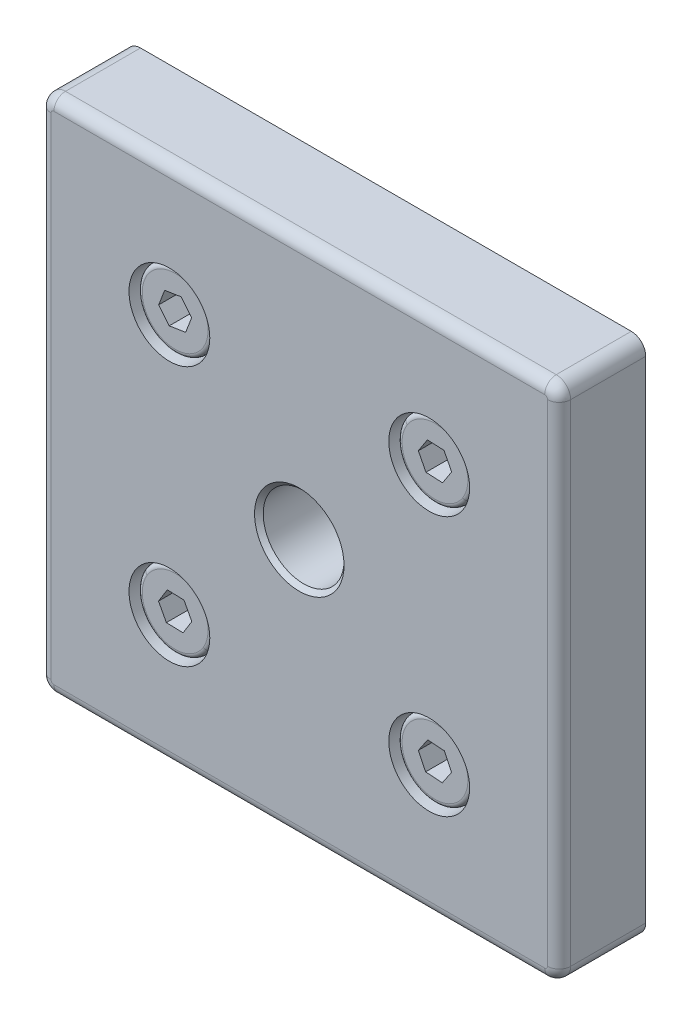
ISO-10303-21;
HEADER;
FILE_DESCRIPTION(('STEP AP214'),'2;1');
FILE_NAME('part.step','',(''),(''),'','','');
FILE_SCHEMA(('AUTOMOTIVE_DESIGN { 1 0 10303 214 1 1 1 1 }'));
ENDSEC;
DATA;
#1=APPLICATION_CONTEXT('core data for automotive mechanical design processes');
#2=APPLICATION_PROTOCOL_DEFINITION('international standard','automotive_design',2000,#1);
#3=PRODUCT_CONTEXT('',#1,'mechanical');
#4=PRODUCT('Part','Part','',(#3));
#5=PRODUCT_RELATED_PRODUCT_CATEGORY('part','',(#4));
#6=PRODUCT_DEFINITION_FORMATION('','',#4);
#7=PRODUCT_DEFINITION_CONTEXT('part definition',#1,'design');
#8=PRODUCT_DEFINITION('design','',#6,#7);
#9=PRODUCT_DEFINITION_SHAPE('','',#8);
#10=(LENGTH_UNIT() NAMED_UNIT(*) SI_UNIT(.MILLI.,.METRE.));
#11=(NAMED_UNIT(*) PLANE_ANGLE_UNIT() SI_UNIT($,.RADIAN.));
#12=(NAMED_UNIT(*) SI_UNIT($,.STERADIAN.) SOLID_ANGLE_UNIT());
#13=UNCERTAINTY_MEASURE_WITH_UNIT(LENGTH_MEASURE(1.E-05),#10,'distance_accuracy_value','');
#14=(GEOMETRIC_REPRESENTATION_CONTEXT(3) GLOBAL_UNCERTAINTY_ASSIGNED_CONTEXT((#13)) GLOBAL_UNIT_ASSIGNED_CONTEXT((#10,
#11,#12)) REPRESENTATION_CONTEXT('',''));
#15=CARTESIAN_POINT('',(0.,0.,0.));
#16=DIRECTION('',(0.,0.,1.));
#17=DIRECTION('',(1.,0.,0.));
#18=AXIS2_PLACEMENT_3D('',#15,#16,#17);
#19=CARTESIAN_POINT('',(-24.9374393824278,25.6446223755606,1.84979350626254));
#20=DIRECTION('',(0.,0.,1.));
#21=DIRECTION('',(-0.776524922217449,-0.630086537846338,0.));
#22=AXIS2_PLACEMENT_3D('',#19,#20,#21);
#23=CONICAL_SURFACE('',#22,2.5,1.0471975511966);
#24=DIRECTION('',(0.672490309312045,0.545670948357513,0.5));
#25=VECTOR('',#24,1.);
#26=CARTESIAN_POINT('',(-22.9961270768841,27.2198387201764,1.84979350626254));
#27=LINE('',#26,#25);
#28=CARTESIAN_POINT('',(-24.9374393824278,25.6446223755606,0.40641783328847));
#29=VERTEX_POINT('',#28);
#30=CARTESIAN_POINT('',(-22.9961270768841,27.2198387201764,1.84979350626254));
#31=VERTEX_POINT('',#30);
#32=EDGE_CURVE('P0_E332',#29,#31,#27,.T.);
#33=ORIENTED_EDGE('',*,*,#32,.F.);
#34=DIRECTION('',(-0.672490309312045,-0.545670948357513,0.5));
#35=VECTOR('',#34,1.);
#36=CARTESIAN_POINT('',(-26.8787516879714,24.0694060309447,1.84979350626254));
#37=LINE('',#36,#35);
#38=CARTESIAN_POINT('',(-26.8787516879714,24.0694060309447,1.84979350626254));
#39=VERTEX_POINT('',#38);
#40=EDGE_CURVE('P0_E334',#29,#39,#37,.T.);
#41=ORIENTED_EDGE('',*,*,#40,.T.);
#42=CARTESIAN_POINT('',(-24.9374393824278,25.6446223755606,1.84979350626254));
#43=DIRECTION('',(0.,0.,1.));
#44=DIRECTION('',(-0.776524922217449,-0.630086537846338,0.));
#45=AXIS2_PLACEMENT_3D('',#42,#43,#44);
#46=CIRCLE('',#45,2.5);
#47=CARTESIAN_POINT('',(-24.5439181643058,23.1757884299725,1.84979350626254));
#48=VERTEX_POINT('',#47);
#49=EDGE_CURVE('P0_E10',#39,#48,#46,.T.);
#50=ORIENTED_EDGE('',*,*,#49,.T.);
#51=CARTESIAN_POINT('',(-24.9374393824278,25.6446223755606,1.84979350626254));
#52=DIRECTION('',(0.,0.,1.));
#53=DIRECTION('',(-0.776524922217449,-0.630086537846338,0.));
#54=AXIS2_PLACEMENT_3D('',#51,#52,#53);
#55=CIRCLE('',#54,2.5);
#56=CARTESIAN_POINT('',(-22.6026058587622,24.7510047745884,1.84979350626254));
#57=VERTEX_POINT('',#56);
#58=EDGE_CURVE('P0_E27',#48,#57,#55,.T.);
#59=ORIENTED_EDGE('',*,*,#58,.T.);
#60=CARTESIAN_POINT('',(-24.9374393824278,25.6446223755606,1.84979350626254));
#61=DIRECTION('',(0.,0.,1.));
#62=DIRECTION('',(-0.776524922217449,-0.630086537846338,0.));
#63=AXIS2_PLACEMENT_3D('',#60,#61,#62);
#64=CIRCLE('',#63,2.5);
#65=EDGE_CURVE('P0_E20',#57,#31,#64,.T.);
#66=ORIENTED_EDGE('',*,*,#65,.T.);
#67=EDGE_LOOP('',(#33,#41,#50,#59,#66));
#68=FACE_BOUND('',#67,.T.);
#69=ADVANCED_FACE('P0_F17',(#68),#23,.F.);
#70=CARTESIAN_POINT('',(-25.9693001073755,22.948588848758,1.84979350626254));
#71=DIRECTION('',(0.,0.,1.));
#72=DIRECTION('',(-0.776524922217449,-0.630086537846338,0.));
#73=AXIS2_PLACEMENT_3D('',#70,#71,#72);
#74=PLANE('',#73);
#75=ORIENTED_EDGE('',*,*,#49,.F.);
#76=DIRECTION('',(0.630086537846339,-0.776524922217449,0.));
#77=VECTOR('',#76,1.);
#78=CARTESIAN_POINT('',(-27.7882032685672,25.1902232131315,1.84979350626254));
#79=LINE('',#78,#77);
#80=CARTESIAN_POINT('',(-25.9693001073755,22.948588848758,1.84979350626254));
#81=VERTEX_POINT('',#80);
#82=EDGE_CURVE('P0_E294',#39,#81,#79,.T.);
#83=ORIENTED_EDGE('',*,*,#82,.T.);
#84=DIRECTION('',(-0.987533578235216,-0.15740848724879,0.));
#85=VECTOR('',#84,1.);
#86=CARTESIAN_POINT('',(-23.118536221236,23.4029880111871,1.84979350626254));
#87=LINE('',#86,#85);
#88=EDGE_CURVE('P0_E275',#48,#81,#87,.T.);
#89=ORIENTED_EDGE('',*,*,#88,.F.);
#90=EDGE_LOOP('',(#75,#83,#89));
#91=FACE_BOUND('',#90,.T.);
#92=ADVANCED_FACE('P0_F590',(#91),#74,.T.);
#93=CARTESIAN_POINT('',(-25.9693001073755,22.948588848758,1.84979350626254));
#94=DIRECTION('',(0.,0.,1.));
#95=DIRECTION('',(-0.776524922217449,-0.630086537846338,0.));
#96=AXIS2_PLACEMENT_3D('',#93,#94,#95);
#97=PLANE('',#96);
#98=ORIENTED_EDGE('',*,*,#58,.F.);
#99=DIRECTION('',(-0.987533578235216,-0.15740848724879,0.));
#100=VECTOR('',#99,1.);
#101=CARTESIAN_POINT('',(-23.118536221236,23.4029880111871,1.84979350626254));
#102=LINE('',#101,#100);
#103=CARTESIAN_POINT('',(-23.118536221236,23.4029880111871,1.84979350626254));
#104=VERTEX_POINT('',#103);
#105=EDGE_CURVE('P0_E272',#104,#48,#102,.T.);
#106=ORIENTED_EDGE('',*,*,#105,.F.);
#107=DIRECTION('',(0.357447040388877,0.933933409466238,0.));
#108=VECTOR('',#107,1.);
#109=CARTESIAN_POINT('',(-23.118536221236,23.4029880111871,1.84979350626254));
#110=LINE('',#109,#108);
#111=EDGE_CURVE('P0_E208',#104,#57,#110,.T.);
#112=ORIENTED_EDGE('',*,*,#111,.T.);
#113=EDGE_LOOP('',(#98,#106,#112));
#114=FACE_BOUND('',#113,.T.);
#115=ADVANCED_FACE('P0_F591',(#114),#97,.T.);
#116=CARTESIAN_POINT('',(-25.9693001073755,22.948588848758,1.84979350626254));
#117=DIRECTION('',(0.,0.,1.));
#118=DIRECTION('',(-0.776524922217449,-0.630086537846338,0.));
#119=AXIS2_PLACEMENT_3D('',#116,#117,#118);
#120=PLANE('',#119);
#121=ORIENTED_EDGE('',*,*,#65,.F.);
#122=DIRECTION('',(0.357447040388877,0.933933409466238,0.));
#123=VECTOR('',#122,1.);
#124=CARTESIAN_POINT('',(-23.118536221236,23.4029880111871,1.84979350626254));
#125=LINE('',#124,#123);
#126=CARTESIAN_POINT('',(-22.0866754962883,26.0990215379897,1.84979350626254));
#127=VERTEX_POINT('',#126);
#128=EDGE_CURVE('P0_E206',#57,#127,#125,.T.);
#129=ORIENTED_EDGE('',*,*,#128,.T.);
#130=DIRECTION('',(-0.630086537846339,0.776524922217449,0.));
#131=VECTOR('',#130,1.);
#132=CARTESIAN_POINT('',(-22.0866754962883,26.0990215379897,1.84979350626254));
#133=LINE('',#132,#131);
#134=EDGE_CURVE('P0_E176',#127,#31,#133,.T.);
#135=ORIENTED_EDGE('',*,*,#134,.T.);
#136=EDGE_LOOP('',(#121,#129,#135));
#137=FACE_BOUND('',#136,.T.);
#138=ADVANCED_FACE('P0_F601',(#137),#120,.T.);
#139=CARTESIAN_POINT('',(-25.9693001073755,22.948588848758,1.84979350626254));
#140=DIRECTION('',(0.,0.,1.));
#141=DIRECTION('',(-0.776524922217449,-0.630086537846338,0.));
#142=AXIS2_PLACEMENT_3D('',#139,#140,#141);
#143=PLANE('',#142);
#144=CARTESIAN_POINT('',(-24.9374393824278,25.6446223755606,1.84979350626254));
#145=DIRECTION('',(0.,0.,1.));
#146=DIRECTION('',(-0.776524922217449,-0.630086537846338,0.));
#147=AXIS2_PLACEMENT_3D('',#144,#145,#146);
#148=CIRCLE('',#147,2.5);
#149=CARTESIAN_POINT('',(-25.3309606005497,28.1134563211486,1.84979350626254));
#150=VERTEX_POINT('',#149);
#151=EDGE_CURVE('P0_E171',#31,#150,#148,.T.);
#152=ORIENTED_EDGE('',*,*,#151,.F.);
#153=DIRECTION('',(-0.630086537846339,0.776524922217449,0.));
#154=VECTOR('',#153,1.);
#155=CARTESIAN_POINT('',(-22.0866754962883,26.0990215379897,1.84979350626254));
#156=LINE('',#155,#154);
#157=CARTESIAN_POINT('',(-23.90557865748,28.3406559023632,1.84979350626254));
#158=VERTEX_POINT('',#157);
#159=EDGE_CURVE('P0_E164',#31,#158,#156,.T.);
#160=ORIENTED_EDGE('',*,*,#159,.T.);
#161=DIRECTION('',(0.987533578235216,0.15740848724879,0.));
#162=VECTOR('',#161,1.);
#163=CARTESIAN_POINT('',(-26.7563425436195,27.8862567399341,1.84979350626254));
#164=LINE('',#163,#162);
#165=EDGE_CURVE('P0_E168',#150,#158,#164,.T.);
#166=ORIENTED_EDGE('',*,*,#165,.F.);
#167=EDGE_LOOP('',(#152,#160,#166));
#168=FACE_BOUND('',#167,.T.);
#169=ADVANCED_FACE('P0_F166',(#168),#143,.T.);
#170=CARTESIAN_POINT('',(-25.9693001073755,22.948588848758,1.84979350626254));
#171=DIRECTION('',(0.,0.,1.));
#172=DIRECTION('',(-0.776524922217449,-0.630086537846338,0.));
#173=AXIS2_PLACEMENT_3D('',#170,#171,#172);
#174=PLANE('',#173);
#175=CARTESIAN_POINT('',(-24.9374393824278,25.6446223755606,1.84979350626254));
#176=DIRECTION('',(0.,0.,1.));
#177=DIRECTION('',(-0.776524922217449,-0.630086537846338,0.));
#178=AXIS2_PLACEMENT_3D('',#175,#176,#177);
#179=CIRCLE('',#178,2.5);
#180=CARTESIAN_POINT('',(-27.2722729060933,26.5382399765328,1.84979350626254));
#181=VERTEX_POINT('',#180);
#182=EDGE_CURVE('P0_E317',#150,#181,#179,.T.);
#183=ORIENTED_EDGE('',*,*,#182,.F.);
#184=DIRECTION('',(0.987533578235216,0.15740848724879,0.));
#185=VECTOR('',#184,1.);
#186=CARTESIAN_POINT('',(-26.7563425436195,27.8862567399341,1.84979350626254));
#187=LINE('',#186,#185);
#188=CARTESIAN_POINT('',(-26.7563425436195,27.8862567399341,1.84979350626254));
#189=VERTEX_POINT('',#188);
#190=EDGE_CURVE('P0_E190',#189,#150,#187,.T.);
#191=ORIENTED_EDGE('',*,*,#190,.F.);
#192=DIRECTION('',(0.357447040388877,0.933933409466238,0.));
#193=VECTOR('',#192,1.);
#194=CARTESIAN_POINT('',(-27.7882032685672,25.1902232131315,1.84979350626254));
#195=LINE('',#194,#193);
#196=EDGE_CURVE('P0_E291',#181,#189,#195,.T.);
#197=ORIENTED_EDGE('',*,*,#196,.F.);
#198=EDGE_LOOP('',(#183,#191,#197));
#199=FACE_BOUND('',#198,.T.);
#200=ADVANCED_FACE('P0_F315',(#199),#174,.T.);
#201=CARTESIAN_POINT('',(-25.9693001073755,22.948588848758,1.84979350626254));
#202=DIRECTION('',(0.,0.,1.));
#203=DIRECTION('',(-0.776524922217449,-0.630086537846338,0.));
#204=AXIS2_PLACEMENT_3D('',#201,#202,#203);
#205=PLANE('',#204);
#206=CARTESIAN_POINT('',(-24.9374393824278,25.6446223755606,1.84979350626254));
#207=DIRECTION('',(0.,0.,1.));
#208=DIRECTION('',(-0.776524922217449,-0.630086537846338,0.));
#209=AXIS2_PLACEMENT_3D('',#206,#207,#208);
#210=CIRCLE('',#209,2.5);
#211=EDGE_CURVE('P0_E342',#181,#39,#210,.T.);
#212=ORIENTED_EDGE('',*,*,#211,.F.);
#213=DIRECTION('',(0.357447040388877,0.933933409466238,0.));
#214=VECTOR('',#213,1.);
#215=CARTESIAN_POINT('',(-27.7882032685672,25.1902232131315,1.84979350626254));
#216=LINE('',#215,#214);
#217=CARTESIAN_POINT('',(-27.7882032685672,25.1902232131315,1.84979350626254));
#218=VERTEX_POINT('',#217);
#219=EDGE_CURVE('P0_E302',#218,#181,#216,.T.);
#220=ORIENTED_EDGE('',*,*,#219,.F.);
#221=DIRECTION('',(0.630086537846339,-0.776524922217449,0.));
#222=VECTOR('',#221,1.);
#223=CARTESIAN_POINT('',(-27.7882032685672,25.1902232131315,1.84979350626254));
#224=LINE('',#223,#222);
#225=EDGE_CURVE('P0_E297',#218,#39,#224,.T.);
#226=ORIENTED_EDGE('',*,*,#225,.T.);
#227=EDGE_LOOP('',(#212,#220,#226));
#228=FACE_BOUND('',#227,.T.);
#229=ADVANCED_FACE('P0_F582',(#228),#205,.T.);
#230=CARTESIAN_POINT('',(-23.118536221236,23.4029880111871,1.84979350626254));
#231=DIRECTION('',(0.933933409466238,-0.357447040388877,0.));
#232=DIRECTION('',(0.,0.,1.));
#233=AXIS2_PLACEMENT_3D('',#230,#231,#232);
#234=PLANE('',#233);
#235=DIRECTION('',(0.357447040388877,0.933933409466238,0.));
#236=VECTOR('',#235,1.);
#237=CARTESIAN_POINT('',(-23.118536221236,23.4029880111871,5.64979350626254));
#238=LINE('',#237,#236);
#239=CARTESIAN_POINT('',(-23.118536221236,23.4029880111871,5.64979350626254));
#240=VERTEX_POINT('',#239);
#241=CARTESIAN_POINT('',(-22.0866754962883,26.0990215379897,5.64979350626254));
#242=VERTEX_POINT('',#241);
#243=EDGE_CURVE('P0_E262',#240,#242,#238,.T.);
#244=ORIENTED_EDGE('',*,*,#243,.T.);
#245=DIRECTION('',(0.,0.,1.));
#246=VECTOR('',#245,1.);
#247=CARTESIAN_POINT('',(-22.0866754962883,26.0990215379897,1.84979350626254));
#248=LINE('',#247,#246);
#249=EDGE_CURVE('P0_E204',#127,#242,#248,.T.);
#250=ORIENTED_EDGE('',*,*,#249,.F.);
#251=ORIENTED_EDGE('',*,*,#128,.F.);
#252=ORIENTED_EDGE('',*,*,#111,.F.);
#253=DIRECTION('',(0.,0.,1.));
#254=VECTOR('',#253,1.);
#255=CARTESIAN_POINT('',(-23.118536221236,23.4029880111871,1.84979350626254));
#256=LINE('',#255,#254);
#257=EDGE_CURVE('P0_E276',#104,#240,#256,.T.);
#258=ORIENTED_EDGE('',*,*,#257,.T.);
#259=EDGE_LOOP('',(#244,#250,#251,#252,#258));
#260=FACE_BOUND('',#259,.T.);
#261=ADVANCED_FACE('P0_F598',(#260),#234,.F.);
#262=CARTESIAN_POINT('',(-22.0866754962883,26.0990215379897,1.84979350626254));
#263=DIRECTION('',(0.776524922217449,0.630086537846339,0.));
#264=DIRECTION('',(-0.630086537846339,0.776524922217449,0.));
#265=AXIS2_PLACEMENT_3D('',#262,#263,#264);
#266=PLANE('',#265);
#267=DIRECTION('',(-0.630086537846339,0.776524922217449,0.));
#268=VECTOR('',#267,1.);
#269=CARTESIAN_POINT('',(-22.0866754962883,26.0990215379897,5.64979350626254));
#270=LINE('',#269,#268);
#271=CARTESIAN_POINT('',(-23.90557865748,28.3406559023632,5.64979350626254));
#272=VERTEX_POINT('',#271);
#273=EDGE_CURVE('P0_E182',#242,#272,#270,.T.);
#274=ORIENTED_EDGE('',*,*,#273,.T.);
#275=DIRECTION('',(0.,0.,1.));
#276=VECTOR('',#275,1.);
#277=CARTESIAN_POINT('',(-23.90557865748,28.3406559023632,1.84979350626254));
#278=LINE('',#277,#276);
#279=EDGE_CURVE('P0_E177',#158,#272,#278,.T.);
#280=ORIENTED_EDGE('',*,*,#279,.F.);
#281=ORIENTED_EDGE('',*,*,#159,.F.);
#282=ORIENTED_EDGE('',*,*,#134,.F.);
#283=ORIENTED_EDGE('',*,*,#249,.T.);
#284=EDGE_LOOP('',(#274,#280,#281,#282,#283));
#285=FACE_BOUND('',#284,.T.);
#286=ADVANCED_FACE('P0_F180',(#285),#266,.F.);
#287=CARTESIAN_POINT('',(-26.7563425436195,27.8862567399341,1.84979350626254));
#288=DIRECTION('',(0.15740848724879,-0.987533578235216,0.));
#289=DIRECTION('',(0.,0.,-1.));
#290=AXIS2_PLACEMENT_3D('',#287,#288,#289);
#291=PLANE('',#290);
#292=DIRECTION('',(0.987533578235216,0.15740848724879,0.));
#293=VECTOR('',#292,1.);
#294=CARTESIAN_POINT('',(-26.7563425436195,27.8862567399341,5.64979350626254));
#295=LINE('',#294,#293);
#296=CARTESIAN_POINT('',(-26.7563425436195,27.8862567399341,5.64979350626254));
#297=VERTEX_POINT('',#296);
#298=EDGE_CURVE('P0_E256',#297,#272,#295,.T.);
#299=ORIENTED_EDGE('',*,*,#298,.F.);
#300=DIRECTION('',(0.,0.,1.));
#301=VECTOR('',#300,1.);
#302=CARTESIAN_POINT('',(-26.7563425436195,27.8862567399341,1.84979350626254));
#303=LINE('',#302,#301);
#304=EDGE_CURVE('P0_E198',#189,#297,#303,.T.);
#305=ORIENTED_EDGE('',*,*,#304,.F.);
#306=ORIENTED_EDGE('',*,*,#190,.T.);
#307=ORIENTED_EDGE('',*,*,#165,.T.);
#308=ORIENTED_EDGE('',*,*,#279,.T.);
#309=EDGE_LOOP('',(#299,#305,#306,#307,#308));
#310=FACE_BOUND('',#309,.T.);
#311=ADVANCED_FACE('P0_F188',(#310),#291,.T.);
#312=CARTESIAN_POINT('',(-27.7882032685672,25.1902232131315,1.84979350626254));
#313=DIRECTION('',(0.933933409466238,-0.357447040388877,0.));
#314=DIRECTION('',(0.,0.,1.));
#315=AXIS2_PLACEMENT_3D('',#312,#313,#314);
#316=PLANE('',#315);
#317=DIRECTION('',(0.357447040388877,0.933933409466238,0.));
#318=VECTOR('',#317,1.);
#319=CARTESIAN_POINT('',(-27.7882032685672,25.1902232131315,5.64979350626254));
#320=LINE('',#319,#318);
#321=CARTESIAN_POINT('',(-27.7882032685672,25.1902232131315,5.64979350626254));
#322=VERTEX_POINT('',#321);
#323=EDGE_CURVE('P0_E259',#322,#297,#320,.T.);
#324=ORIENTED_EDGE('',*,*,#323,.F.);
#325=DIRECTION('',(0.,0.,1.));
#326=VECTOR('',#325,1.);
#327=CARTESIAN_POINT('',(-27.7882032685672,25.1902232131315,1.84979350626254));
#328=LINE('',#327,#326);
#329=EDGE_CURVE('P0_E301',#218,#322,#328,.T.);
#330=ORIENTED_EDGE('',*,*,#329,.F.);
#331=ORIENTED_EDGE('',*,*,#219,.T.);
#332=ORIENTED_EDGE('',*,*,#196,.T.);
#333=ORIENTED_EDGE('',*,*,#304,.T.);
#334=EDGE_LOOP('',(#324,#330,#331,#332,#333));
#335=FACE_BOUND('',#334,.T.);
#336=ADVANCED_FACE('P0_F311',(#335),#316,.T.);
#337=CARTESIAN_POINT('',(-27.7882032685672,25.1902232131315,1.84979350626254));
#338=DIRECTION('',(-0.776524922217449,-0.630086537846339,0.));
#339=DIRECTION('',(-0.630086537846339,0.776524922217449,0.));
#340=AXIS2_PLACEMENT_3D('',#337,#338,#339);
#341=PLANE('',#340);
#342=DIRECTION('',(0.630086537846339,-0.776524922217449,0.));
#343=VECTOR('',#342,1.);
#344=CARTESIAN_POINT('',(-27.7882032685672,25.1902232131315,5.64979350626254));
#345=LINE('',#344,#343);
#346=CARTESIAN_POINT('',(-25.9693001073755,22.948588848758,5.64979350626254));
#347=VERTEX_POINT('',#346);
#348=EDGE_CURVE('P0_E253',#322,#347,#345,.T.);
#349=ORIENTED_EDGE('',*,*,#348,.T.);
#350=DIRECTION('',(0.,0.,1.));
#351=VECTOR('',#350,1.);
#352=CARTESIAN_POINT('',(-25.9693001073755,22.948588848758,1.84979350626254));
#353=LINE('',#352,#351);
#354=EDGE_CURVE('P0_E288',#81,#347,#353,.T.);
#355=ORIENTED_EDGE('',*,*,#354,.F.);
#356=ORIENTED_EDGE('',*,*,#82,.F.);
#357=ORIENTED_EDGE('',*,*,#225,.F.);
#358=ORIENTED_EDGE('',*,*,#329,.T.);
#359=EDGE_LOOP('',(#349,#355,#356,#357,#358));
#360=FACE_BOUND('',#359,.T.);
#361=ADVANCED_FACE('P0_F587',(#360),#341,.F.);
#362=CARTESIAN_POINT('',(-23.118536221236,23.4029880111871,1.84979350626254));
#363=DIRECTION('',(-0.15740848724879,0.987533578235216,0.));
#364=DIRECTION('',(0.987533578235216,0.15740848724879,0.));
#365=AXIS2_PLACEMENT_3D('',#362,#363,#364);
#366=PLANE('',#365);
#367=DIRECTION('',(-0.987533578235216,-0.15740848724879,0.));
#368=VECTOR('',#367,1.);
#369=CARTESIAN_POINT('',(-23.118536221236,23.4029880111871,5.64979350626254));
#370=LINE('',#369,#368);
#371=EDGE_CURVE('P0_E249',#240,#347,#370,.T.);
#372=ORIENTED_EDGE('',*,*,#371,.F.);
#373=ORIENTED_EDGE('',*,*,#257,.F.);
#374=ORIENTED_EDGE('',*,*,#105,.T.);
#375=ORIENTED_EDGE('',*,*,#88,.T.);
#376=ORIENTED_EDGE('',*,*,#354,.T.);
#377=EDGE_LOOP('',(#372,#373,#374,#375,#376));
#378=FACE_BOUND('',#377,.T.);
#379=ADVANCED_FACE('P0_F595',(#378),#366,.T.);
#380=CARTESIAN_POINT('',(-24.9374393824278,25.6446223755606,4.84979350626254));
#381=DIRECTION('',(0.,0.,1.));
#382=DIRECTION('',(-0.776524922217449,-0.630086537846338,0.));
#383=AXIS2_PLACEMENT_3D('',#380,#381,#382);
#384=TOROIDAL_SURFACE('',#383,5.7,0.8);
#385=CARTESIAN_POINT('',(-20.5112473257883,29.2361156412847,4.84979350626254));
#386=DIRECTION('',(0.630086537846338,-0.776524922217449,0.));
#387=DIRECTION('',(-0.776524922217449,-0.630086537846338,0.));
#388=AXIS2_PLACEMENT_3D('',#385,#386,#387);
#389=CIRCLE('',#388,0.8);
#390=CARTESIAN_POINT('',(-19.8900273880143,29.7401848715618,4.84979350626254));
#391=VERTEX_POINT('',#390);
#392=CARTESIAN_POINT('',(-20.5112473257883,29.2361156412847,5.64979350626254));
#393=VERTEX_POINT('',#392);
#394=EDGE_CURVE('P0_E341',#391,#393,#389,.T.);
#395=ORIENTED_EDGE('',*,*,#394,.F.);
#396=CARTESIAN_POINT('',(-24.9374393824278,25.6446223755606,4.84979350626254));
#397=DIRECTION('',(0.,0.,-1.));
#398=DIRECTION('',(-0.776524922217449,-0.630086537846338,0.));
#399=AXIS2_PLACEMENT_3D('',#396,#397,#398);
#400=CIRCLE('',#399,6.5);
#401=CARTESIAN_POINT('',(-29.9848513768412,21.5490598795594,4.84979350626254));
#402=VERTEX_POINT('',#401);
#403=EDGE_CURVE('P0_E268',#402,#391,#400,.T.);
#404=ORIENTED_EDGE('',*,*,#403,.F.);
#405=CARTESIAN_POINT('',(-29.3636314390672,22.0531291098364,4.84979350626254));
#406=DIRECTION('',(-0.630086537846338,0.776524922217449,0.));
#407=DIRECTION('',(0.776524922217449,0.630086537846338,0.));
#408=AXIS2_PLACEMENT_3D('',#405,#406,#407);
#409=CIRCLE('',#408,0.8);
#410=CARTESIAN_POINT('',(-29.3636314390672,22.0531291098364,5.64979350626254));
#411=VERTEX_POINT('',#410);
#412=EDGE_CURVE('P0_E359',#402,#411,#409,.T.);
#413=ORIENTED_EDGE('',*,*,#412,.T.);
#414=CARTESIAN_POINT('',(-24.9374393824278,25.6446223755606,5.64979350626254));
#415=DIRECTION('',(0.,0.,1.));
#416=DIRECTION('',(-0.776524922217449,-0.630086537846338,0.));
#417=AXIS2_PLACEMENT_3D('',#414,#415,#416);
#418=CIRCLE('',#417,5.7);
#419=EDGE_CURVE('P0_E246',#393,#411,#418,.T.);
#420=ORIENTED_EDGE('',*,*,#419,.F.);
#421=EDGE_LOOP('',(#395,#404,#413,#420));
#422=FACE_BOUND('',#421,.T.);
#423=ADVANCED_FACE('P0_F632',(#422),#384,.T.);
#424=CARTESIAN_POINT('',(-24.9374393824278,25.6446223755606,0.24979350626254));
#425=DIRECTION('',(0.,0.,-1.));
#426=DIRECTION('',(0.776524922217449,0.630086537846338,0.));
#427=AXIS2_PLACEMENT_3D('',#424,#425,#426);
#428=TOROIDAL_SURFACE('',#427,4.39999999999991,0.4);
#429=CARTESIAN_POINT('',(-28.3541490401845,22.8722416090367,0.24979350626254));
#430=DIRECTION('',(0.630086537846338,-0.776524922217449,0.));
#431=DIRECTION('',(-0.776524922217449,-0.630086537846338,0.));
#432=AXIS2_PLACEMENT_3D('',#429,#430,#431);
#433=CIRCLE('',#432,0.4);
#434=CARTESIAN_POINT('',(-28.0435390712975,23.1242762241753,0.24979350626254));
#435=VERTEX_POINT('',#434);
#436=CARTESIAN_POINT('',(-28.3541490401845,22.8722416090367,0.64979350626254));
#437=VERTEX_POINT('',#436);
#438=EDGE_CURVE('P0_E368',#435,#437,#433,.T.);
#439=ORIENTED_EDGE('',*,*,#438,.F.);
#440=CARTESIAN_POINT('',(-24.9374393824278,25.6446223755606,0.24979350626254));
#441=DIRECTION('',(0.,0.,-1.));
#442=DIRECTION('',(0.776524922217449,0.630086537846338,0.));
#443=AXIS2_PLACEMENT_3D('',#440,#441,#442);
#444=CIRCLE('',#443,3.99999999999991);
#445=CARTESIAN_POINT('',(-21.831339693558,28.1649685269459,0.24979350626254));
#446=VERTEX_POINT('',#445);
#447=EDGE_CURVE('P0_E231',#446,#435,#444,.T.);
#448=ORIENTED_EDGE('',*,*,#447,.F.);
#449=CARTESIAN_POINT('',(-21.5207297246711,28.4170031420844,0.24979350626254));
#450=DIRECTION('',(-0.630086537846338,0.776524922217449,0.));
#451=DIRECTION('',(0.776524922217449,0.630086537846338,0.));
#452=AXIS2_PLACEMENT_3D('',#449,#450,#451);
#453=CIRCLE('',#452,0.4);
#454=CARTESIAN_POINT('',(-21.5207297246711,28.4170031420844,0.64979350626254));
#455=VERTEX_POINT('',#454);
#456=EDGE_CURVE('P0_E351',#446,#455,#453,.T.);
#457=ORIENTED_EDGE('',*,*,#456,.T.);
#458=CARTESIAN_POINT('',(-24.9374393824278,25.6446223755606,0.64979350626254));
#459=DIRECTION('',(0.,0.,1.));
#460=DIRECTION('',(0.776524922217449,0.630086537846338,0.));
#461=AXIS2_PLACEMENT_3D('',#458,#459,#460);
#462=CIRCLE('',#461,4.39999999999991);
#463=EDGE_CURVE('P0_E271',#437,#455,#462,.T.);
#464=ORIENTED_EDGE('',*,*,#463,.F.);
#465=EDGE_LOOP('',(#439,#448,#457,#464));
#466=FACE_BOUND('',#465,.T.);
#467=ADVANCED_FACE('P0_F635',(#466),#428,.F.);
#468=CARTESIAN_POINT('',(-22.8521679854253,23.0747131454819,-24.3502064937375));
#469=DIRECTION('',(0.,0.,-1.));
#470=DIRECTION('',(0.630086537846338,-0.776524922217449,0.));
#471=AXIS2_PLACEMENT_3D('',#468,#469,#470);
#472=PLANE('',#471);
#473=CARTESIAN_POINT('',(-24.9374393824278,25.6446223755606,-24.3502064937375));
#474=DIRECTION('',(0.,0.,1.));
#475=DIRECTION('',(-0.776524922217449,-0.630086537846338,0.));
#476=AXIS2_PLACEMENT_3D('',#473,#474,#475);
#477=CIRCLE('',#476,3.3095);
#478=CARTESIAN_POINT('',(-27.5073486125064,23.5593509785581,-24.3502064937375));
#479=VERTEX_POINT('',#478);
#480=CARTESIAN_POINT('',(-22.3675301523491,27.729893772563,-24.3502064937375));
#481=VERTEX_POINT('',#480);
#482=EDGE_CURVE('P0_E348',#479,#481,#477,.T.);
#483=ORIENTED_EDGE('',*,*,#482,.F.);
#484=CARTESIAN_POINT('',(-24.9374393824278,25.6446223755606,-24.3502064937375));
#485=DIRECTION('',(0.,0.,1.));
#486=DIRECTION('',(-0.776524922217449,-0.630086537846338,0.));
#487=AXIS2_PLACEMENT_3D('',#484,#485,#486);
#488=CIRCLE('',#487,3.3095);
#489=EDGE_CURVE('P0_E280',#481,#479,#488,.T.);
#490=ORIENTED_EDGE('',*,*,#489,.F.);
#491=EDGE_LOOP('',(#483,#490));
#492=FACE_BOUND('',#491,.T.);
#493=ADVANCED_FACE('P0_F641',(#492),#472,.T.);
#494=CARTESIAN_POINT('',(-24.9374393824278,25.6446223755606,-24.3502064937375));
#495=DIRECTION('',(0.,0.,1.));
#496=DIRECTION('',(-0.776524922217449,-0.630086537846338,0.));
#497=AXIS2_PLACEMENT_3D('',#494,#495,#496);
#498=CONICAL_SURFACE('',#497,3.3095,0.785398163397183);
#499=DIRECTION('',(0.549086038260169,0.445538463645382,0.707106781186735));
#500=VECTOR('',#499,1.);
#501=CARTESIAN_POINT('',(-22.3675301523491,27.729893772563,-24.3502064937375));
#502=LINE('',#501,#500);
#503=CARTESIAN_POINT('',(-21.8313396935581,28.1649685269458,-23.6597064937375));
#504=VERTEX_POINT('',#503);
#505=EDGE_CURVE('P0_E343',#481,#504,#502,.T.);
#506=ORIENTED_EDGE('',*,*,#505,.F.);
#507=ORIENTED_EDGE('',*,*,#489,.T.);
#508=DIRECTION('',(-0.549086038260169,-0.445538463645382,0.707106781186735));
#509=VECTOR('',#508,1.);
#510=CARTESIAN_POINT('',(-27.5073486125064,23.5593509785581,-24.3502064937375));
#511=LINE('',#510,#509);
#512=CARTESIAN_POINT('',(-28.0435390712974,23.1242762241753,-23.6597064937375));
#513=VERTEX_POINT('',#512);
#514=EDGE_CURVE('P0_E379',#479,#513,#511,.T.);
#515=ORIENTED_EDGE('',*,*,#514,.T.);
#516=CARTESIAN_POINT('',(-24.9374393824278,25.6446223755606,-23.6597064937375));
#517=DIRECTION('',(0.,0.,1.));
#518=DIRECTION('',(-0.776524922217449,-0.630086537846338,0.));
#519=AXIS2_PLACEMENT_3D('',#516,#517,#518);
#520=CIRCLE('',#519,3.99999999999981);
#521=EDGE_CURVE('P0_E277',#504,#513,#520,.T.);
#522=ORIENTED_EDGE('',*,*,#521,.F.);
#523=EDGE_LOOP('',(#506,#507,#515,#522));
#524=FACE_BOUND('',#523,.T.);
#525=ADVANCED_FACE('P0_F645',(#524),#498,.T.);
#526=CARTESIAN_POINT('',(-24.9374393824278,25.6446223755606,37.3997935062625));
#527=DIRECTION('',(0.,0.,1.));
#528=DIRECTION('',(-0.776524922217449,-0.630086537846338,0.));
#529=AXIS2_PLACEMENT_3D('',#526,#527,#528);
#530=CYLINDRICAL_SURFACE('',#529,3.99999999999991);
#531=DIRECTION('',(0.,0.,1.));
#532=VECTOR('',#531,1.);
#533=CARTESIAN_POINT('',(-21.831339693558,28.1649685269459,37.3997935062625));
#534=LINE('',#533,#532);
#535=EDGE_CURVE('P0_E229',#504,#446,#534,.T.);
#536=ORIENTED_EDGE('',*,*,#535,.F.);
#537=ORIENTED_EDGE('',*,*,#521,.T.);
#538=DIRECTION('',(0.,0.,1.));
#539=VECTOR('',#538,1.);
#540=CARTESIAN_POINT('',(-28.0435390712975,23.1242762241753,37.3997935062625));
#541=LINE('',#540,#539);
#542=EDGE_CURVE('P0_E235',#513,#435,#541,.T.);
#543=ORIENTED_EDGE('',*,*,#542,.T.);
#544=CARTESIAN_POINT('',(-24.9374393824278,25.6446223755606,0.24979350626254));
#545=DIRECTION('',(0.,0.,-1.));
#546=DIRECTION('',(0.776524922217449,0.630086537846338,0.));
#547=AXIS2_PLACEMENT_3D('',#544,#545,#546);
#548=CIRCLE('',#547,3.99999999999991);
#549=EDGE_CURVE('P0_E363',#435,#446,#548,.T.);
#550=ORIENTED_EDGE('',*,*,#549,.T.);
#551=EDGE_LOOP('',(#536,#537,#543,#550));
#552=FACE_BOUND('',#551,.T.);
#553=ADVANCED_FACE('P0_F406',(#552),#530,.T.);
#554=CARTESIAN_POINT('',(-20.8418768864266,20.5972103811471,0.64979350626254));
#555=DIRECTION('',(0.,0.,-1.));
#556=DIRECTION('',(0.630086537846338,-0.776524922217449,0.));
#557=AXIS2_PLACEMENT_3D('',#554,#555,#556);
#558=PLANE('',#557);
#559=CARTESIAN_POINT('',(-24.9374393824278,25.6446223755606,0.64979350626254));
#560=DIRECTION('',(0.,0.,1.));
#561=DIRECTION('',(0.776524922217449,0.630086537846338,0.));
#562=AXIS2_PLACEMENT_3D('',#559,#560,#561);
#563=CIRCLE('',#562,4.39999999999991);
#564=EDGE_CURVE('P0_E372',#455,#437,#563,.T.);
#565=ORIENTED_EDGE('',*,*,#564,.T.);
#566=ORIENTED_EDGE('',*,*,#463,.T.);
#567=EDGE_LOOP('',(#565,#566));
#568=FACE_BOUND('',#567,.T.);
#569=CARTESIAN_POINT('',(-24.9374393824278,25.6446223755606,0.64979350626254));
#570=DIRECTION('',(0.,0.,1.));
#571=DIRECTION('',(-0.776524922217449,-0.630086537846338,0.));
#572=AXIS2_PLACEMENT_3D('',#569,#570,#571);
#573=CIRCLE('',#572,6.5);
#574=CARTESIAN_POINT('',(-29.9848513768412,21.5490598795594,0.64979350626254));
#575=VERTEX_POINT('',#574);
#576=CARTESIAN_POINT('',(-19.8900273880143,29.7401848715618,0.64979350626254));
#577=VERTEX_POINT('',#576);
#578=EDGE_CURVE('P0_E238',#575,#577,#573,.T.);
#579=ORIENTED_EDGE('',*,*,#578,.F.);
#580=CARTESIAN_POINT('',(-24.9374393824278,25.6446223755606,0.64979350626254));
#581=DIRECTION('',(0.,0.,1.));
#582=DIRECTION('',(-0.776524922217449,-0.630086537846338,0.));
#583=AXIS2_PLACEMENT_3D('',#580,#581,#582);
#584=CIRCLE('',#583,6.5);
#585=EDGE_CURVE('P0_E265',#577,#575,#584,.T.);
#586=ORIENTED_EDGE('',*,*,#585,.F.);
#587=EDGE_LOOP('',(#579,#586));
#588=FACE_BOUND('',#587,.T.);
#589=ADVANCED_FACE('P0_F651',(#568,#588),#558,.T.);
#590=CARTESIAN_POINT('',(-24.9374393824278,25.6446223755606,37.3997935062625));
#591=DIRECTION('',(0.,0.,1.));
#592=DIRECTION('',(-0.776524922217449,-0.630086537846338,0.));
#593=AXIS2_PLACEMENT_3D('',#590,#591,#592);
#594=CYLINDRICAL_SURFACE('',#593,6.5);
#595=DIRECTION('',(0.,0.,1.));
#596=VECTOR('',#595,1.);
#597=CARTESIAN_POINT('',(-19.8900273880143,29.7401848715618,37.3997935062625));
#598=LINE('',#597,#596);
#599=EDGE_CURVE('P0_E239',#577,#391,#598,.T.);
#600=ORIENTED_EDGE('',*,*,#599,.F.);
#601=ORIENTED_EDGE('',*,*,#585,.T.);
#602=DIRECTION('',(0.,0.,1.));
#603=VECTOR('',#602,1.);
#604=CARTESIAN_POINT('',(-29.9848513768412,21.5490598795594,37.3997935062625));
#605=LINE('',#604,#603);
#606=EDGE_CURVE('P0_E243',#575,#402,#605,.T.);
#607=ORIENTED_EDGE('',*,*,#606,.T.);
#608=ORIENTED_EDGE('',*,*,#403,.T.);
#609=EDGE_LOOP('',(#600,#601,#607,#608));
#610=FACE_BOUND('',#609,.T.);
#611=ADVANCED_FACE('P0_F654',(#610),#594,.T.);
#612=CARTESIAN_POINT('',(-24.9374393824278,25.6446223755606,5.64979350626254));
#613=DIRECTION('',(0.,0.,1.));
#614=DIRECTION('',(-0.776524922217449,-0.630086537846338,0.));
#615=AXIS2_PLACEMENT_3D('',#612,#613,#614);
#616=PLANE('',#615);
#617=ORIENTED_EDGE('',*,*,#371,.T.);
#618=ORIENTED_EDGE('',*,*,#348,.F.);
#619=ORIENTED_EDGE('',*,*,#323,.T.);
#620=ORIENTED_EDGE('',*,*,#298,.T.);
#621=ORIENTED_EDGE('',*,*,#273,.F.);
#622=ORIENTED_EDGE('',*,*,#243,.F.);
#623=EDGE_LOOP('',(#617,#618,#619,#620,#621,#622));
#624=FACE_BOUND('',#623,.T.);
#625=CARTESIAN_POINT('',(-24.9374393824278,25.6446223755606,5.64979350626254));
#626=DIRECTION('',(0.,0.,1.));
#627=DIRECTION('',(-0.776524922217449,-0.630086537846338,0.));
#628=AXIS2_PLACEMENT_3D('',#625,#626,#627);
#629=CIRCLE('',#628,5.7);
#630=EDGE_CURVE('P0_E355',#411,#393,#629,.T.);
#631=ORIENTED_EDGE('',*,*,#630,.T.);
#632=ORIENTED_EDGE('',*,*,#419,.T.);
#633=EDGE_LOOP('',(#631,#632));
#634=FACE_BOUND('',#633,.T.);
#635=ADVANCED_FACE('P0_F321',(#624,#634),#616,.T.);
#636=CARTESIAN_POINT('',(-24.9374393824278,25.6446223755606,37.3997935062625));
#637=DIRECTION('',(0.,0.,1.));
#638=DIRECTION('',(-0.776524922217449,-0.630086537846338,0.));
#639=AXIS2_PLACEMENT_3D('',#636,#637,#638);
#640=CYLINDRICAL_SURFACE('',#639,6.5);
#641=ORIENTED_EDGE('',*,*,#578,.T.);
#642=ORIENTED_EDGE('',*,*,#599,.T.);
#643=CARTESIAN_POINT('',(-24.9374393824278,25.6446223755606,4.84979350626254));
#644=DIRECTION('',(0.,0.,-1.));
#645=DIRECTION('',(-0.776524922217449,-0.630086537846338,0.));
#646=AXIS2_PLACEMENT_3D('',#643,#644,#645);
#647=CIRCLE('',#646,6.5);
#648=EDGE_CURVE('P0_E337',#391,#402,#647,.T.);
#649=ORIENTED_EDGE('',*,*,#648,.T.);
#650=ORIENTED_EDGE('',*,*,#606,.F.);
#651=EDGE_LOOP('',(#641,#642,#649,#650));
#652=FACE_BOUND('',#651,.T.);
#653=ADVANCED_FACE('P0_F661',(#652),#640,.T.);
#654=CARTESIAN_POINT('',(-24.9374393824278,25.6446223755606,37.3997935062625));
#655=DIRECTION('',(0.,0.,1.));
#656=DIRECTION('',(-0.776524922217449,-0.630086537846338,0.));
#657=AXIS2_PLACEMENT_3D('',#654,#655,#656);
#658=CYLINDRICAL_SURFACE('',#657,3.99999999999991);
#659=CARTESIAN_POINT('',(-24.9374393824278,25.6446223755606,-23.6597064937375));
#660=DIRECTION('',(0.,0.,1.));
#661=DIRECTION('',(-0.776524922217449,-0.630086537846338,0.));
#662=AXIS2_PLACEMENT_3D('',#659,#660,#661);
#663=CIRCLE('',#662,3.99999999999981);
#664=EDGE_CURVE('P0_E347',#513,#504,#663,.T.);
#665=ORIENTED_EDGE('',*,*,#664,.T.);
#666=ORIENTED_EDGE('',*,*,#535,.T.);
#667=ORIENTED_EDGE('',*,*,#447,.T.);
#668=ORIENTED_EDGE('',*,*,#542,.F.);
#669=EDGE_LOOP('',(#665,#666,#667,#668));
#670=FACE_BOUND('',#669,.T.);
#671=ADVANCED_FACE('P0_F665',(#670),#658,.T.);
#672=CARTESIAN_POINT('',(-24.9374393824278,25.6446223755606,-24.3502064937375));
#673=DIRECTION('',(0.,0.,1.));
#674=DIRECTION('',(-0.776524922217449,-0.630086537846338,0.));
#675=AXIS2_PLACEMENT_3D('',#672,#673,#674);
#676=CONICAL_SURFACE('',#675,3.3095,0.785398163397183);
#677=ORIENTED_EDGE('',*,*,#482,.T.);
#678=ORIENTED_EDGE('',*,*,#505,.T.);
#679=ORIENTED_EDGE('',*,*,#664,.F.);
#680=ORIENTED_EDGE('',*,*,#514,.F.);
#681=EDGE_LOOP('',(#677,#678,#679,#680));
#682=FACE_BOUND('',#681,.T.);
#683=ADVANCED_FACE('P0_F662',(#682),#676,.T.);
#684=CARTESIAN_POINT('',(-24.9374393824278,25.6446223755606,0.24979350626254));
#685=DIRECTION('',(0.,0.,-1.));
#686=DIRECTION('',(0.776524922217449,0.630086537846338,0.));
#687=AXIS2_PLACEMENT_3D('',#684,#685,#686);
#688=TOROIDAL_SURFACE('',#687,4.39999999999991,0.4);
#689=ORIENTED_EDGE('',*,*,#549,.F.);
#690=ORIENTED_EDGE('',*,*,#438,.T.);
#691=ORIENTED_EDGE('',*,*,#564,.F.);
#692=ORIENTED_EDGE('',*,*,#456,.F.);
#693=EDGE_LOOP('',(#689,#690,#691,#692));
#694=FACE_BOUND('',#693,.T.);
#695=ADVANCED_FACE('P0_F409',(#694),#688,.F.);
#696=CARTESIAN_POINT('',(-24.9374393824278,25.6446223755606,4.84979350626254));
#697=DIRECTION('',(0.,0.,1.));
#698=DIRECTION('',(-0.776524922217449,-0.630086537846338,0.));
#699=AXIS2_PLACEMENT_3D('',#696,#697,#698);
#700=TOROIDAL_SURFACE('',#699,5.7,0.8);
#701=ORIENTED_EDGE('',*,*,#648,.F.);
#702=ORIENTED_EDGE('',*,*,#394,.T.);
#703=ORIENTED_EDGE('',*,*,#630,.F.);
#704=ORIENTED_EDGE('',*,*,#412,.F.);
#705=EDGE_LOOP('',(#701,#702,#703,#704));
#706=FACE_BOUND('',#705,.T.);
#707=ADVANCED_FACE('P0_F672',(#706),#700,.T.);
#708=CARTESIAN_POINT('',(-24.9374393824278,25.6446223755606,1.84979350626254));
#709=DIRECTION('',(0.,0.,1.));
#710=DIRECTION('',(-0.776524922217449,-0.630086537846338,0.));
#711=AXIS2_PLACEMENT_3D('',#708,#709,#710);
#712=CONICAL_SURFACE('',#711,2.5,1.0471975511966);
#713=ORIENTED_EDGE('',*,*,#40,.F.);
#714=ORIENTED_EDGE('',*,*,#32,.T.);
#715=ORIENTED_EDGE('',*,*,#151,.T.);
#716=ORIENTED_EDGE('',*,*,#182,.T.);
#717=ORIENTED_EDGE('',*,*,#211,.T.);
#718=EDGE_LOOP('',(#713,#714,#715,#716,#717));
#719=FACE_BOUND('',#718,.T.);
#720=ADVANCED_FACE('P0_F580',(#719),#712,.F.);
#721=CLOSED_SHELL('',(#69,#92,#115,#138,#169,#200,#229,#261,#286,#311,#336,#361,#379,#423,#467,
#493,#525,#553,#589,#611,#635,#653,#671,#683,#695,#707,#720));
#722=MANIFOLD_SOLID_BREP('P0_B1',#721);
#723=CARTESIAN_POINT('',(20.0625606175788,-19.3553776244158,1.84979350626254));
#724=DIRECTION('',(0.,0.,1.));
#725=DIRECTION('',(0.0724700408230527,0.99737058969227,0.));
#726=AXIS2_PLACEMENT_3D('',#723,#724,#725);
#727=CONICAL_SURFACE('',#726,2.5,1.0471975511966);
#728=DIRECTION('',(-0.0627608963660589,-0.86374826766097,0.5));
#729=VECTOR('',#728,1.);
#730=CARTESIAN_POINT('',(19.8813855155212,-21.8488040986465,1.84979350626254));
#731=LINE('',#730,#729);
#732=CARTESIAN_POINT('',(20.0625606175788,-19.3553776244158,0.406417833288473));
#733=VERTEX_POINT('',#732);
#734=CARTESIAN_POINT('',(19.8813855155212,-21.8488040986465,1.84979350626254));
#735=VERTEX_POINT('',#734);
#736=EDGE_CURVE('P1_E332',#733,#735,#731,.T.);
#737=ORIENTED_EDGE('',*,*,#736,.F.);
#738=DIRECTION('',(0.0627608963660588,0.86374826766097,0.5));
#739=VECTOR('',#738,1.);
#740=CARTESIAN_POINT('',(20.2437357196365,-16.8619511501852,1.84979350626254));
#741=LINE('',#740,#739);
#742=CARTESIAN_POINT('',(20.2437357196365,-16.8619511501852,1.84979350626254));
#743=VERTEX_POINT('',#742);
#744=EDGE_CURVE('P1_E334',#733,#743,#741,.T.);
#745=ORIENTED_EDGE('',*,*,#744,.T.);
#746=CARTESIAN_POINT('',(20.0625606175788,-19.3553776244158,1.84979350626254));
#747=DIRECTION('',(0.,0.,1.));
#748=DIRECTION('',(0.0724700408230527,0.99737058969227,0.));
#749=AXIS2_PLACEMENT_3D('',#746,#747,#748);
#750=CIRCLE('',#749,2.5);
#751=CARTESIAN_POINT('',(17.9937774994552,-17.9517621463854,1.84979350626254));
#752=VERTEX_POINT('',#751);
#753=EDGE_CURVE('P1_E11',#743,#752,#750,.T.);
#754=ORIENTED_EDGE('',*,*,#753,.T.);
#755=CARTESIAN_POINT('',(20.0625606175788,-19.3553776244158,1.84979350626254));
#756=DIRECTION('',(0.,0.,1.));
#757=DIRECTION('',(0.0724700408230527,0.99737058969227,0.));
#758=AXIS2_PLACEMENT_3D('',#755,#756,#757);
#759=CIRCLE('',#758,2.5);
#760=CARTESIAN_POINT('',(17.8126023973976,-20.445188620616,1.84979350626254));
#761=VERTEX_POINT('',#760);
#762=EDGE_CURVE('P1_E28',#752,#761,#759,.T.);
#763=ORIENTED_EDGE('',*,*,#762,.T.);
#764=CARTESIAN_POINT('',(20.0625606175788,-19.3553776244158,1.84979350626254));
#765=DIRECTION('',(0.,0.,1.));
#766=DIRECTION('',(0.0724700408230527,0.99737058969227,0.));
#767=AXIS2_PLACEMENT_3D('',#764,#765,#766);
#768=CIRCLE('',#767,2.5);
#769=EDGE_CURVE('P1_E21',#761,#735,#768,.T.);
#770=ORIENTED_EDGE('',*,*,#769,.T.);
#771=EDGE_LOOP('',(#737,#745,#754,#763,#770));
#772=FACE_BOUND('',#771,.T.);
#773=ADVANCED_FACE('P1_F18',(#772),#727,.F.);
#774=CARTESIAN_POINT('',(18.8041552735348,-16.7573496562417,1.84979350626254));
#775=DIRECTION('',(0.,0.,1.));
#776=DIRECTION('',(0.0724700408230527,0.99737058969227,0.));
#777=AXIS2_PLACEMENT_3D('',#774,#775,#776);
#778=PLANE('',#777);
#779=ORIENTED_EDGE('',*,*,#753,.F.);
#780=DIRECTION('',(-0.99737058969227,0.0724700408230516,0.));
#781=VECTOR('',#780,1.);
#782=CARTESIAN_POINT('',(21.6833161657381,-16.9665526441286,1.84979350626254));
#783=LINE('',#782,#781);
#784=CARTESIAN_POINT('',(18.8041552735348,-16.7573496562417,1.84979350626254));
#785=VERTEX_POINT('',#784);
#786=EDGE_CURVE('P1_E293',#743,#785,#783,.T.);
#787=ORIENTED_EDGE('',*,*,#786,.T.);
#788=DIRECTION('',(0.561446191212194,0.827513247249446,0.));
#789=VECTOR('',#788,1.);
#790=CARTESIAN_POINT('',(17.1833997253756,-19.146174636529,1.84979350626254));
#791=LINE('',#790,#789);
#792=EDGE_CURVE('P1_E276',#752,#785,#791,.T.);
#793=ORIENTED_EDGE('',*,*,#792,.F.);
#794=EDGE_LOOP('',(#779,#787,#793));
#795=FACE_BOUND('',#794,.T.);
#796=ADVANCED_FACE('P1_F591',(#795),#778,.T.);
#797=CARTESIAN_POINT('',(18.8041552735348,-16.7573496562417,1.84979350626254));
#798=DIRECTION('',(0.,0.,1.));
#799=DIRECTION('',(0.0724700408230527,0.99737058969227,0.));
#800=AXIS2_PLACEMENT_3D('',#797,#798,#799);
#801=PLANE('',#800);
#802=ORIENTED_EDGE('',*,*,#762,.F.);
#803=DIRECTION('',(0.561446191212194,0.827513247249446,0.));
#804=VECTOR('',#803,1.);
#805=CARTESIAN_POINT('',(17.1833997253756,-19.146174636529,1.84979350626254));
#806=LINE('',#805,#804);
#807=CARTESIAN_POINT('',(17.1833997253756,-19.146174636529,1.84979350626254));
#808=VERTEX_POINT('',#807);
#809=EDGE_CURVE('P1_E272',#808,#752,#806,.T.);
#810=ORIENTED_EDGE('',*,*,#809,.F.);
#811=DIRECTION('',(0.435924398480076,-0.899983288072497,0.));
#812=VECTOR('',#811,1.);
#813=CARTESIAN_POINT('',(17.1833997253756,-19.146174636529,1.84979350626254));
#814=LINE('',#813,#812);
#815=EDGE_CURVE('P1_E209',#808,#761,#814,.T.);
#816=ORIENTED_EDGE('',*,*,#815,.T.);
#817=EDGE_LOOP('',(#802,#810,#816));
#818=FACE_BOUND('',#817,.T.);
#819=ADVANCED_FACE('P1_F592',(#818),#801,.T.);
#820=CARTESIAN_POINT('',(18.8041552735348,-16.7573496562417,1.84979350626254));
#821=DIRECTION('',(0.,0.,1.));
#822=DIRECTION('',(0.0724700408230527,0.99737058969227,0.));
#823=AXIS2_PLACEMENT_3D('',#820,#821,#822);
#824=PLANE('',#823);
#825=ORIENTED_EDGE('',*,*,#769,.F.);
#826=DIRECTION('',(0.435924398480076,-0.899983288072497,0.));
#827=VECTOR('',#826,1.);
#828=CARTESIAN_POINT('',(17.1833997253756,-19.146174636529,1.84979350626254));
#829=LINE('',#828,#827);
#830=CARTESIAN_POINT('',(18.4418050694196,-21.7442026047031,1.84979350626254));
#831=VERTEX_POINT('',#830);
#832=EDGE_CURVE('P1_E207',#761,#831,#829,.T.);
#833=ORIENTED_EDGE('',*,*,#832,.T.);
#834=DIRECTION('',(0.99737058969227,-0.0724700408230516,0.));
#835=VECTOR('',#834,1.);
#836=CARTESIAN_POINT('',(18.4418050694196,-21.7442026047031,1.84979350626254));
#837=LINE('',#836,#835);
#838=EDGE_CURVE('P1_E177',#831,#735,#837,.T.);
#839=ORIENTED_EDGE('',*,*,#838,.T.);
#840=EDGE_LOOP('',(#825,#833,#839));
#841=FACE_BOUND('',#840,.T.);
#842=ADVANCED_FACE('P1_F602',(#841),#824,.T.);
#843=CARTESIAN_POINT('',(18.8041552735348,-16.7573496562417,1.84979350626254));
#844=DIRECTION('',(0.,0.,1.));
#845=DIRECTION('',(0.0724700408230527,0.99737058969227,0.));
#846=AXIS2_PLACEMENT_3D('',#843,#844,#845);
#847=PLANE('',#846);
#848=CARTESIAN_POINT('',(20.0625606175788,-19.3553776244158,1.84979350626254));
#849=DIRECTION('',(0.,0.,1.));
#850=DIRECTION('',(0.0724700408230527,0.99737058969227,0.));
#851=AXIS2_PLACEMENT_3D('',#848,#849,#850);
#852=CIRCLE('',#851,2.5);
#853=CARTESIAN_POINT('',(22.1313437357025,-20.7589931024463,1.84979350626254));
#854=VERTEX_POINT('',#853);
#855=EDGE_CURVE('P1_E172',#735,#854,#852,.T.);
#856=ORIENTED_EDGE('',*,*,#855,.F.);
#857=DIRECTION('',(0.99737058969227,-0.0724700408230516,0.));
#858=VECTOR('',#857,1.);
#859=CARTESIAN_POINT('',(18.4418050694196,-21.7442026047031,1.84979350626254));
#860=LINE('',#859,#858);
#861=CARTESIAN_POINT('',(21.3209659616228,-21.9534055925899,1.84979350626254));
#862=VERTEX_POINT('',#861);
#863=EDGE_CURVE('P1_E165',#735,#862,#860,.T.);
#864=ORIENTED_EDGE('',*,*,#863,.T.);
#865=DIRECTION('',(-0.561446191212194,-0.827513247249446,0.));
#866=VECTOR('',#865,1.);
#867=CARTESIAN_POINT('',(22.9417215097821,-19.5645806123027,1.84979350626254));
#868=LINE('',#867,#866);
#869=EDGE_CURVE('P1_E169',#854,#862,#868,.T.);
#870=ORIENTED_EDGE('',*,*,#869,.F.);
#871=EDGE_LOOP('',(#856,#864,#870));
#872=FACE_BOUND('',#871,.T.);
#873=ADVANCED_FACE('P1_F167',(#872),#847,.T.);
#874=CARTESIAN_POINT('',(18.8041552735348,-16.7573496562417,1.84979350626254));
#875=DIRECTION('',(0.,0.,1.));
#876=DIRECTION('',(0.0724700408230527,0.99737058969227,0.));
#877=AXIS2_PLACEMENT_3D('',#874,#875,#876);
#878=PLANE('',#877);
#879=CARTESIAN_POINT('',(20.0625606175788,-19.3553776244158,1.84979350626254));
#880=DIRECTION('',(0.,0.,1.));
#881=DIRECTION('',(0.0724700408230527,0.99737058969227,0.));
#882=AXIS2_PLACEMENT_3D('',#879,#880,#881);
#883=CIRCLE('',#882,2.5);
#884=CARTESIAN_POINT('',(22.3125188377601,-18.2655666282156,1.84979350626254));
#885=VERTEX_POINT('',#884);
#886=EDGE_CURVE('P1_E315',#854,#885,#883,.T.);
#887=ORIENTED_EDGE('',*,*,#886,.F.);
#888=DIRECTION('',(-0.561446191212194,-0.827513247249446,0.));
#889=VECTOR('',#888,1.);
#890=CARTESIAN_POINT('',(22.9417215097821,-19.5645806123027,1.84979350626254));
#891=LINE('',#890,#889);
#892=CARTESIAN_POINT('',(22.9417215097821,-19.5645806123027,1.84979350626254));
#893=VERTEX_POINT('',#892);
#894=EDGE_CURVE('P1_E191',#893,#854,#891,.T.);
#895=ORIENTED_EDGE('',*,*,#894,.F.);
#896=DIRECTION('',(0.435924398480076,-0.899983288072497,0.));
#897=VECTOR('',#896,1.);
#898=CARTESIAN_POINT('',(21.6833161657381,-16.9665526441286,1.84979350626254));
#899=LINE('',#898,#897);
#900=EDGE_CURVE('P1_E291',#885,#893,#899,.T.);
#901=ORIENTED_EDGE('',*,*,#900,.F.);
#902=EDGE_LOOP('',(#887,#895,#901));
#903=FACE_BOUND('',#902,.T.);
#904=ADVANCED_FACE('P1_F313',(#903),#878,.T.);
#905=CARTESIAN_POINT('',(18.8041552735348,-16.7573496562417,1.84979350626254));
#906=DIRECTION('',(0.,0.,1.));
#907=DIRECTION('',(0.0724700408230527,0.99737058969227,0.));
#908=AXIS2_PLACEMENT_3D('',#905,#906,#907);
#909=PLANE('',#908);
#910=CARTESIAN_POINT('',(20.0625606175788,-19.3553776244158,1.84979350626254));
#911=DIRECTION('',(0.,0.,1.));
#912=DIRECTION('',(0.0724700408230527,0.99737058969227,0.));
#913=AXIS2_PLACEMENT_3D('',#910,#911,#912);
#914=CIRCLE('',#913,2.5);
#915=EDGE_CURVE('P1_E342',#885,#743,#914,.T.);
#916=ORIENTED_EDGE('',*,*,#915,.F.);
#917=DIRECTION('',(0.435924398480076,-0.899983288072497,0.));
#918=VECTOR('',#917,1.);
#919=CARTESIAN_POINT('',(21.6833161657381,-16.9665526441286,1.84979350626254));
#920=LINE('',#919,#918);
#921=CARTESIAN_POINT('',(21.6833161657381,-16.9665526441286,1.84979350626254));
#922=VERTEX_POINT('',#921);
#923=EDGE_CURVE('P1_E301',#922,#885,#920,.T.);
#924=ORIENTED_EDGE('',*,*,#923,.F.);
#925=DIRECTION('',(-0.99737058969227,0.0724700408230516,0.));
#926=VECTOR('',#925,1.);
#927=CARTESIAN_POINT('',(21.6833161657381,-16.9665526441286,1.84979350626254));
#928=LINE('',#927,#926);
#929=EDGE_CURVE('P1_E296',#922,#743,#928,.T.);
#930=ORIENTED_EDGE('',*,*,#929,.T.);
#931=EDGE_LOOP('',(#916,#924,#930));
#932=FACE_BOUND('',#931,.T.);
#933=ADVANCED_FACE('P1_F583',(#932),#909,.T.);
#934=CARTESIAN_POINT('',(17.1833997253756,-19.146174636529,1.84979350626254));
#935=DIRECTION('',(-0.899983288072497,-0.435924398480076,0.));
#936=DIRECTION('',(0.,0.,1.));
#937=AXIS2_PLACEMENT_3D('',#934,#935,#936);
#938=PLANE('',#937);
#939=DIRECTION('',(0.435924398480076,-0.899983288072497,0.));
#940=VECTOR('',#939,1.);
#941=CARTESIAN_POINT('',(17.1833997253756,-19.146174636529,5.64979350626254));
#942=LINE('',#941,#940);
#943=CARTESIAN_POINT('',(17.1833997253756,-19.146174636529,5.64979350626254));
#944=VERTEX_POINT('',#943);
#945=CARTESIAN_POINT('',(18.4418050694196,-21.7442026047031,5.64979350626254));
#946=VERTEX_POINT('',#945);
#947=EDGE_CURVE('P1_E261',#944,#946,#942,.T.);
#948=ORIENTED_EDGE('',*,*,#947,.T.);
#949=DIRECTION('',(0.,0.,1.));
#950=VECTOR('',#949,1.);
#951=CARTESIAN_POINT('',(18.4418050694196,-21.7442026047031,1.84979350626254));
#952=LINE('',#951,#950);
#953=EDGE_CURVE('P1_E205',#831,#946,#952,.T.);
#954=ORIENTED_EDGE('',*,*,#953,.F.);
#955=ORIENTED_EDGE('',*,*,#832,.F.);
#956=ORIENTED_EDGE('',*,*,#815,.F.);
#957=DIRECTION('',(0.,0.,1.));
#958=VECTOR('',#957,1.);
#959=CARTESIAN_POINT('',(17.1833997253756,-19.146174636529,1.84979350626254));
#960=LINE('',#959,#958);
#961=EDGE_CURVE('P1_E277',#808,#944,#960,.T.);
#962=ORIENTED_EDGE('',*,*,#961,.T.);
#963=EDGE_LOOP('',(#948,#954,#955,#956,#962));
#964=FACE_BOUND('',#963,.T.);
#965=ADVANCED_FACE('P1_F599',(#964),#938,.F.);
#966=CARTESIAN_POINT('',(18.4418050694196,-21.7442026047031,1.84979350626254));
#967=DIRECTION('',(-0.0724700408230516,-0.99737058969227,0.));
#968=DIRECTION('',(0.99737058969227,-0.0724700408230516,0.));
#969=AXIS2_PLACEMENT_3D('',#966,#967,#968);
#970=PLANE('',#969);
#971=DIRECTION('',(0.99737058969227,-0.0724700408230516,0.));
#972=VECTOR('',#971,1.);
#973=CARTESIAN_POINT('',(18.4418050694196,-21.7442026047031,5.64979350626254));
#974=LINE('',#973,#972);
#975=CARTESIAN_POINT('',(21.3209659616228,-21.9534055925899,5.64979350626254));
#976=VERTEX_POINT('',#975);
#977=EDGE_CURVE('P1_E183',#946,#976,#974,.T.);
#978=ORIENTED_EDGE('',*,*,#977,.T.);
#979=DIRECTION('',(0.,0.,1.));
#980=VECTOR('',#979,1.);
#981=CARTESIAN_POINT('',(21.3209659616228,-21.9534055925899,1.84979350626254));
#982=LINE('',#981,#980);
#983=EDGE_CURVE('P1_E178',#862,#976,#982,.T.);
#984=ORIENTED_EDGE('',*,*,#983,.F.);
#985=ORIENTED_EDGE('',*,*,#863,.F.);
#986=ORIENTED_EDGE('',*,*,#838,.F.);
#987=ORIENTED_EDGE('',*,*,#953,.T.);
#988=EDGE_LOOP('',(#978,#984,#985,#986,#987));
#989=FACE_BOUND('',#988,.T.);
#990=ADVANCED_FACE('P1_F181',(#989),#970,.F.);
#991=CARTESIAN_POINT('',(22.9417215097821,-19.5645806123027,1.84979350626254));
#992=DIRECTION('',(-0.827513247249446,0.561446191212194,0.));
#993=DIRECTION('',(0.,0.,-1.));
#994=AXIS2_PLACEMENT_3D('',#991,#992,#993);
#995=PLANE('',#994);
#996=DIRECTION('',(-0.561446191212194,-0.827513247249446,0.));
#997=VECTOR('',#996,1.);
#998=CARTESIAN_POINT('',(22.9417215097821,-19.5645806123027,5.64979350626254));
#999=LINE('',#998,#997);
#1000=CARTESIAN_POINT('',(22.9417215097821,-19.5645806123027,5.64979350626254));
#1001=VERTEX_POINT('',#1000);
#1002=EDGE_CURVE('P1_E255',#1001,#976,#999,.T.);
#1003=ORIENTED_EDGE('',*,*,#1002,.F.);
#1004=DIRECTION('',(0.,0.,1.));
#1005=VECTOR('',#1004,1.);
#1006=CARTESIAN_POINT('',(22.9417215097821,-19.5645806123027,1.84979350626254));
#1007=LINE('',#1006,#1005);
#1008=EDGE_CURVE('P1_E200',#893,#1001,#1007,.T.);
#1009=ORIENTED_EDGE('',*,*,#1008,.F.);
#1010=ORIENTED_EDGE('',*,*,#894,.T.);
#1011=ORIENTED_EDGE('',*,*,#869,.T.);
#1012=ORIENTED_EDGE('',*,*,#983,.T.);
#1013=EDGE_LOOP('',(#1003,#1009,#1010,#1011,#1012));
#1014=FACE_BOUND('',#1013,.T.);
#1015=ADVANCED_FACE('P1_F189',(#1014),#995,.T.);
#1016=CARTESIAN_POINT('',(21.6833161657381,-16.9665526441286,1.84979350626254));
#1017=DIRECTION('',(-0.899983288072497,-0.435924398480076,0.));
#1018=DIRECTION('',(0.,0.,1.));
#1019=AXIS2_PLACEMENT_3D('',#1016,#1017,#1018);
#1020=PLANE('',#1019);
#1021=DIRECTION('',(0.435924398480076,-0.899983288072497,0.));
#1022=VECTOR('',#1021,1.);
#1023=CARTESIAN_POINT('',(21.6833161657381,-16.9665526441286,5.64979350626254));
#1024=LINE('',#1023,#1022);
#1025=CARTESIAN_POINT('',(21.6833161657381,-16.9665526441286,5.64979350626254));
#1026=VERTEX_POINT('',#1025);
#1027=EDGE_CURVE('P1_E258',#1026,#1001,#1024,.T.);
#1028=ORIENTED_EDGE('',*,*,#1027,.F.);
#1029=DIRECTION('',(0.,0.,1.));
#1030=VECTOR('',#1029,1.);
#1031=CARTESIAN_POINT('',(21.6833161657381,-16.9665526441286,1.84979350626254));
#1032=LINE('',#1031,#1030);
#1033=EDGE_CURVE('P1_E300',#922,#1026,#1032,.T.);
#1034=ORIENTED_EDGE('',*,*,#1033,.F.);
#1035=ORIENTED_EDGE('',*,*,#923,.T.);
#1036=ORIENTED_EDGE('',*,*,#900,.T.);
#1037=ORIENTED_EDGE('',*,*,#1008,.T.);
#1038=EDGE_LOOP('',(#1028,#1034,#1035,#1036,#1037));
#1039=FACE_BOUND('',#1038,.T.);
#1040=ADVANCED_FACE('P1_F309',(#1039),#1020,.T.);
#1041=CARTESIAN_POINT('',(21.6833161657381,-16.9665526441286,1.84979350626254));
#1042=DIRECTION('',(0.0724700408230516,0.99737058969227,0.));
#1043=DIRECTION('',(0.99737058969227,-0.0724700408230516,0.));
#1044=AXIS2_PLACEMENT_3D('',#1041,#1042,#1043);
#1045=PLANE('',#1044);
#1046=DIRECTION('',(-0.99737058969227,0.0724700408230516,0.));
#1047=VECTOR('',#1046,1.);
#1048=CARTESIAN_POINT('',(21.6833161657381,-16.9665526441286,5.64979350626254));
#1049=LINE('',#1048,#1047);
#1050=CARTESIAN_POINT('',(18.8041552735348,-16.7573496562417,5.64979350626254));
#1051=VERTEX_POINT('',#1050);
#1052=EDGE_CURVE('P1_E252',#1026,#1051,#1049,.T.);
#1053=ORIENTED_EDGE('',*,*,#1052,.T.);
#1054=DIRECTION('',(0.,0.,1.));
#1055=VECTOR('',#1054,1.);
#1056=CARTESIAN_POINT('',(18.8041552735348,-16.7573496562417,1.84979350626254));
#1057=LINE('',#1056,#1055);
#1058=EDGE_CURVE('P1_E288',#785,#1051,#1057,.T.);
#1059=ORIENTED_EDGE('',*,*,#1058,.F.);
#1060=ORIENTED_EDGE('',*,*,#786,.F.);
#1061=ORIENTED_EDGE('',*,*,#929,.F.);
#1062=ORIENTED_EDGE('',*,*,#1033,.T.);
#1063=EDGE_LOOP('',(#1053,#1059,#1060,#1061,#1062));
#1064=FACE_BOUND('',#1063,.T.);
#1065=ADVANCED_FACE('P1_F588',(#1064),#1045,.F.);
#1066=CARTESIAN_POINT('',(17.1833997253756,-19.146174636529,1.84979350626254));
#1067=DIRECTION('',(0.827513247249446,-0.561446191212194,0.));
#1068=DIRECTION('',(-0.561446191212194,-0.827513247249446,0.));
#1069=AXIS2_PLACEMENT_3D('',#1066,#1067,#1068);
#1070=PLANE('',#1069);
#1071=DIRECTION('',(0.561446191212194,0.827513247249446,0.));
#1072=VECTOR('',#1071,1.);
#1073=CARTESIAN_POINT('',(17.1833997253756,-19.146174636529,5.64979350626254));
#1074=LINE('',#1073,#1072);
#1075=EDGE_CURVE('P1_E248',#944,#1051,#1074,.T.);
#1076=ORIENTED_EDGE('',*,*,#1075,.F.);
#1077=ORIENTED_EDGE('',*,*,#961,.F.);
#1078=ORIENTED_EDGE('',*,*,#809,.T.);
#1079=ORIENTED_EDGE('',*,*,#792,.T.);
#1080=ORIENTED_EDGE('',*,*,#1058,.T.);
#1081=EDGE_LOOP('',(#1076,#1077,#1078,#1079,#1080));
#1082=FACE_BOUND('',#1081,.T.);
#1083=ADVANCED_FACE('P1_F596',(#1082),#1070,.T.);
#1084=CARTESIAN_POINT('',(20.0625606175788,-19.3553776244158,4.84979350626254));
#1085=DIRECTION('',(0.,0.,1.));
#1086=DIRECTION('',(0.0724700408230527,0.99737058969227,0.));
#1087=AXIS2_PLACEMENT_3D('',#1084,#1085,#1086);
#1088=TOROIDAL_SURFACE('',#1087,5.7,0.8);
#1089=CARTESIAN_POINT('',(19.6494813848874,-25.0403899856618,4.84979350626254));
#1090=DIRECTION('',(-0.99737058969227,0.0724700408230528,0.));
#1091=DIRECTION('',(0.0724700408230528,0.99737058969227,0.));
#1092=AXIS2_PLACEMENT_3D('',#1089,#1090,#1091);
#1093=CIRCLE('',#1092,0.8);
#1094=CARTESIAN_POINT('',(19.591505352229,-25.8382864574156,4.84979350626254));
#1095=VERTEX_POINT('',#1094);
#1096=CARTESIAN_POINT('',(19.6494813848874,-25.0403899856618,5.64979350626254));
#1097=VERTEX_POINT('',#1096);
#1098=EDGE_CURVE('P1_E341',#1095,#1097,#1093,.T.);
#1099=ORIENTED_EDGE('',*,*,#1098,.F.);
#1100=CARTESIAN_POINT('',(20.0625606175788,-19.3553776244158,4.84979350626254));
#1101=DIRECTION('',(0.,0.,-1.));
#1102=DIRECTION('',(0.0724700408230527,0.99737058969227,0.));
#1103=AXIS2_PLACEMENT_3D('',#1100,#1101,#1102);
#1104=CIRCLE('',#1103,6.5);
#1105=CARTESIAN_POINT('',(20.5336158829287,-12.8724687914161,4.84979350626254));
#1106=VERTEX_POINT('',#1105);
#1107=EDGE_CURVE('P1_E268',#1106,#1095,#1104,.T.);
#1108=ORIENTED_EDGE('',*,*,#1107,.F.);
#1109=CARTESIAN_POINT('',(20.4756398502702,-13.6703652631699,4.84979350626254));
#1110=DIRECTION('',(0.99737058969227,-0.0724700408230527,0.));
#1111=DIRECTION('',(-0.0724700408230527,-0.99737058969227,0.));
#1112=AXIS2_PLACEMENT_3D('',#1109,#1110,#1111);
#1113=CIRCLE('',#1112,0.8);
#1114=CARTESIAN_POINT('',(20.4756398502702,-13.6703652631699,5.64979350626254));
#1115=VERTEX_POINT('',#1114);
#1116=EDGE_CURVE('P1_E360',#1106,#1115,#1113,.T.);
#1117=ORIENTED_EDGE('',*,*,#1116,.T.);
#1118=CARTESIAN_POINT('',(20.0625606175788,-19.3553776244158,5.64979350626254));
#1119=DIRECTION('',(0.,0.,1.));
#1120=DIRECTION('',(0.0724700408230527,0.99737058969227,0.));
#1121=AXIS2_PLACEMENT_3D('',#1118,#1119,#1120);
#1122=CIRCLE('',#1121,5.7);
#1123=EDGE_CURVE('P1_E245',#1097,#1115,#1122,.T.);
#1124=ORIENTED_EDGE('',*,*,#1123,.F.);
#1125=EDGE_LOOP('',(#1099,#1108,#1117,#1124));
#1126=FACE_BOUND('',#1125,.T.);
#1127=ADVANCED_FACE('P1_F633',(#1126),#1088,.T.);
#1128=CARTESIAN_POINT('',(20.0625606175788,-19.3553776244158,0.249793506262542));
#1129=DIRECTION('',(0.,0.,-1.));
#1130=DIRECTION('',(-0.0724700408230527,-0.99737058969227,0.));
#1131=AXIS2_PLACEMENT_3D('',#1128,#1129,#1130);
#1132=TOROIDAL_SURFACE('',#1131,4.39999999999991,0.4);
#1133=CARTESIAN_POINT('',(20.3814287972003,-14.9669470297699,0.249793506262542));
#1134=DIRECTION('',(-0.99737058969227,0.0724700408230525,0.));
#1135=DIRECTION('',(0.0724700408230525,0.99737058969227,0.));
#1136=AXIS2_PLACEMENT_3D('',#1133,#1134,#1135);
#1137=CIRCLE('',#1136,0.4);
#1138=CARTESIAN_POINT('',(20.352440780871,-15.3658952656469,0.249793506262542));
#1139=VERTEX_POINT('',#1138);
#1140=CARTESIAN_POINT('',(20.3814287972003,-14.9669470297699,0.649793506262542));
#1141=VERTEX_POINT('',#1140);
#1142=EDGE_CURVE('P1_E369',#1139,#1141,#1137,.T.);
#1143=ORIENTED_EDGE('',*,*,#1142,.F.);
#1144=CARTESIAN_POINT('',(20.0625606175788,-19.3553776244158,0.249793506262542));
#1145=DIRECTION('',(0.,0.,-1.));
#1146=DIRECTION('',(-0.0724700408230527,-0.99737058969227,0.));
#1147=AXIS2_PLACEMENT_3D('',#1144,#1145,#1146);
#1148=CIRCLE('',#1147,3.99999999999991);
#1149=CARTESIAN_POINT('',(19.7726804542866,-23.3448599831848,0.249793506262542));
#1150=VERTEX_POINT('',#1149);
#1151=EDGE_CURVE('P1_E229',#1150,#1139,#1148,.T.);
#1152=ORIENTED_EDGE('',*,*,#1151,.F.);
#1153=CARTESIAN_POINT('',(19.7436924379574,-23.7438082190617,0.249793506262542));
#1154=DIRECTION('',(0.99737058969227,-0.0724700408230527,0.));
#1155=DIRECTION('',(-0.0724700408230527,-0.99737058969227,0.));
#1156=AXIS2_PLACEMENT_3D('',#1153,#1154,#1155);
#1157=CIRCLE('',#1156,0.4);
#1158=CARTESIAN_POINT('',(19.7436924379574,-23.7438082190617,0.649793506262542));
#1159=VERTEX_POINT('',#1158);
#1160=EDGE_CURVE('P1_E352',#1150,#1159,#1157,.T.);
#1161=ORIENTED_EDGE('',*,*,#1160,.T.);
#1162=CARTESIAN_POINT('',(20.0625606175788,-19.3553776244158,0.649793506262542));
#1163=DIRECTION('',(0.,0.,1.));
#1164=DIRECTION('',(-0.0724700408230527,-0.99737058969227,0.));
#1165=AXIS2_PLACEMENT_3D('',#1162,#1163,#1164);
#1166=CIRCLE('',#1165,4.39999999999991);
#1167=EDGE_CURVE('P1_E271',#1141,#1159,#1166,.T.);
#1168=ORIENTED_EDGE('',*,*,#1167,.F.);
#1169=EDGE_LOOP('',(#1143,#1152,#1161,#1168));
#1170=FACE_BOUND('',#1169,.T.);
#1171=ADVANCED_FACE('P1_F636',(#1170),#1132,.F.);
#1172=CARTESIAN_POINT('',(16.7617626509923,-19.1155380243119,-24.3502064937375));
#1173=DIRECTION('',(0.,0.,-1.));
#1174=DIRECTION('',(-0.99737058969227,0.0724700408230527,0.));
#1175=AXIS2_PLACEMENT_3D('',#1172,#1173,#1174);
#1176=PLANE('',#1175);
#1177=CARTESIAN_POINT('',(20.0625606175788,-19.3553776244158,-24.3502064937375));
#1178=DIRECTION('',(0.,0.,1.));
#1179=DIRECTION('',(0.0724700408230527,0.99737058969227,0.));
#1180=AXIS2_PLACEMENT_3D('',#1177,#1178,#1179);
#1181=CIRCLE('',#1180,3.3095);
#1182=CARTESIAN_POINT('',(20.3024002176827,-16.0545796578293,-24.3502064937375));
#1183=VERTEX_POINT('',#1182);
#1184=CARTESIAN_POINT('',(19.822721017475,-22.6561755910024,-24.3502064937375));
#1185=VERTEX_POINT('',#1184);
#1186=EDGE_CURVE('P1_E348',#1183,#1185,#1181,.T.);
#1187=ORIENTED_EDGE('',*,*,#1186,.F.);
#1188=CARTESIAN_POINT('',(20.0625606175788,-19.3553776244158,-24.3502064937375));
#1189=DIRECTION('',(0.,0.,1.));
#1190=DIRECTION('',(0.0724700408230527,0.99737058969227,0.));
#1191=AXIS2_PLACEMENT_3D('',#1188,#1189,#1190);
#1192=CIRCLE('',#1191,3.3095);
#1193=EDGE_CURVE('P1_E281',#1185,#1183,#1192,.T.);
#1194=ORIENTED_EDGE('',*,*,#1193,.F.);
#1195=EDGE_LOOP('',(#1187,#1194));
#1196=FACE_BOUND('',#1195,.T.);
#1197=ADVANCED_FACE('P1_F642',(#1196),#1176,.T.);
#1198=CARTESIAN_POINT('',(20.0625606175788,-19.3553776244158,-24.3502064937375));
#1199=DIRECTION('',(0.,0.,1.));
#1200=DIRECTION('',(0.0724700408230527,0.99737058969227,0.));
#1201=AXIS2_PLACEMENT_3D('',#1198,#1199,#1200);
#1202=CONICAL_SURFACE('',#1201,3.3095,0.785398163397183);
#1203=DIRECTION('',(-0.051244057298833,-0.705247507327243,0.707106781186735));
#1204=VECTOR('',#1203,1.);
#1205=CARTESIAN_POINT('',(19.822721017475,-22.6561755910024,-24.3502064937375));
#1206=LINE('',#1205,#1204);
#1207=CARTESIAN_POINT('',(19.7726804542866,-23.3448599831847,-23.6597064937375));
#1208=VERTEX_POINT('',#1207);
#1209=EDGE_CURVE('P1_E343',#1185,#1208,#1206,.T.);
#1210=ORIENTED_EDGE('',*,*,#1209,.F.);
#1211=ORIENTED_EDGE('',*,*,#1193,.T.);
#1212=DIRECTION('',(0.0512440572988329,0.705247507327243,0.707106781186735));
#1213=VECTOR('',#1212,1.);
#1214=CARTESIAN_POINT('',(20.3024002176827,-16.0545796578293,-24.3502064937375));
#1215=LINE('',#1214,#1213);
#1216=CARTESIAN_POINT('',(20.352440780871,-15.3658952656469,-23.6597064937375));
#1217=VERTEX_POINT('',#1216);
#1218=EDGE_CURVE('P1_E381',#1183,#1217,#1215,.T.);
#1219=ORIENTED_EDGE('',*,*,#1218,.T.);
#1220=CARTESIAN_POINT('',(20.0625606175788,-19.3553776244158,-23.6597064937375));
#1221=DIRECTION('',(0.,0.,1.));
#1222=DIRECTION('',(0.0724700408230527,0.99737058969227,0.));
#1223=AXIS2_PLACEMENT_3D('',#1220,#1221,#1222);
#1224=CIRCLE('',#1223,3.99999999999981);
#1225=EDGE_CURVE('P1_E278',#1208,#1217,#1224,.T.);
#1226=ORIENTED_EDGE('',*,*,#1225,.F.);
#1227=EDGE_LOOP('',(#1210,#1211,#1219,#1226));
#1228=FACE_BOUND('',#1227,.T.);
#1229=ADVANCED_FACE('P1_F646',(#1228),#1202,.T.);
#1230=CARTESIAN_POINT('',(20.0625606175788,-19.3553776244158,37.3997935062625));
#1231=DIRECTION('',(0.,0.,1.));
#1232=DIRECTION('',(0.0724700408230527,0.99737058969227,0.));
#1233=AXIS2_PLACEMENT_3D('',#1230,#1231,#1232);
#1234=CYLINDRICAL_SURFACE('',#1233,3.99999999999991);
#1235=DIRECTION('',(0.,0.,1.));
#1236=VECTOR('',#1235,1.);
#1237=CARTESIAN_POINT('',(19.7726804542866,-23.3448599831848,37.3997935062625));
#1238=LINE('',#1237,#1236);
#1239=EDGE_CURVE('P1_E227',#1208,#1150,#1238,.T.);
#1240=ORIENTED_EDGE('',*,*,#1239,.F.);
#1241=ORIENTED_EDGE('',*,*,#1225,.T.);
#1242=DIRECTION('',(0.,0.,1.));
#1243=VECTOR('',#1242,1.);
#1244=CARTESIAN_POINT('',(20.352440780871,-15.3658952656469,37.3997935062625));
#1245=LINE('',#1244,#1243);
#1246=EDGE_CURVE('P1_E233',#1217,#1139,#1245,.T.);
#1247=ORIENTED_EDGE('',*,*,#1246,.T.);
#1248=CARTESIAN_POINT('',(20.0625606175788,-19.3553776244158,0.249793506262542));
#1249=DIRECTION('',(0.,0.,-1.));
#1250=DIRECTION('',(-0.0724700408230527,-0.99737058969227,0.));
#1251=AXIS2_PLACEMENT_3D('',#1248,#1249,#1250);
#1252=CIRCLE('',#1251,3.99999999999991);
#1253=EDGE_CURVE('P1_E363',#1139,#1150,#1252,.T.);
#1254=ORIENTED_EDGE('',*,*,#1253,.T.);
#1255=EDGE_LOOP('',(#1240,#1241,#1247,#1254));
#1256=FACE_BOUND('',#1255,.T.);
#1257=ADVANCED_FACE('P1_F407',(#1256),#1234,.T.);
#1258=CARTESIAN_POINT('',(13.5796517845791,-18.884322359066,0.649793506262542));
#1259=DIRECTION('',(0.,0.,-1.));
#1260=DIRECTION('',(-0.99737058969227,0.0724700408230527,0.));
#1261=AXIS2_PLACEMENT_3D('',#1258,#1259,#1260);
#1262=PLANE('',#1261);
#1263=CARTESIAN_POINT('',(20.0625606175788,-19.3553776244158,0.649793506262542));
#1264=DIRECTION('',(0.,0.,1.));
#1265=DIRECTION('',(-0.0724700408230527,-0.99737058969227,0.));
#1266=AXIS2_PLACEMENT_3D('',#1263,#1264,#1265);
#1267=CIRCLE('',#1266,4.39999999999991);
#1268=EDGE_CURVE('P1_E373',#1159,#1141,#1267,.T.);
#1269=ORIENTED_EDGE('',*,*,#1268,.T.);
#1270=ORIENTED_EDGE('',*,*,#1167,.T.);
#1271=EDGE_LOOP('',(#1269,#1270));
#1272=FACE_BOUND('',#1271,.T.);
#1273=CARTESIAN_POINT('',(20.0625606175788,-19.3553776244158,0.649793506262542));
#1274=DIRECTION('',(0.,0.,1.));
#1275=DIRECTION('',(0.0724700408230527,0.99737058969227,0.));
#1276=AXIS2_PLACEMENT_3D('',#1273,#1274,#1275);
#1277=CIRCLE('',#1276,6.5);
#1278=CARTESIAN_POINT('',(20.5336158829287,-12.8724687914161,0.649793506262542));
#1279=VERTEX_POINT('',#1278);
#1280=CARTESIAN_POINT('',(19.591505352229,-25.8382864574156,0.649793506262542));
#1281=VERTEX_POINT('',#1280);
#1282=EDGE_CURVE('P1_E236',#1279,#1281,#1277,.T.);
#1283=ORIENTED_EDGE('',*,*,#1282,.F.);
#1284=CARTESIAN_POINT('',(20.0625606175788,-19.3553776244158,0.649793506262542));
#1285=DIRECTION('',(0.,0.,1.));
#1286=DIRECTION('',(0.0724700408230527,0.99737058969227,0.));
#1287=AXIS2_PLACEMENT_3D('',#1284,#1285,#1286);
#1288=CIRCLE('',#1287,6.5);
#1289=EDGE_CURVE('P1_E265',#1281,#1279,#1288,.T.);
#1290=ORIENTED_EDGE('',*,*,#1289,.F.);
#1291=EDGE_LOOP('',(#1283,#1290));
#1292=FACE_BOUND('',#1291,.T.);
#1293=ADVANCED_FACE('P1_F652',(#1272,#1292),#1262,.T.);
#1294=CARTESIAN_POINT('',(20.0625606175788,-19.3553776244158,37.3997935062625));
#1295=DIRECTION('',(0.,0.,1.));
#1296=DIRECTION('',(0.0724700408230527,0.99737058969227,0.));
#1297=AXIS2_PLACEMENT_3D('',#1294,#1295,#1296);
#1298=CYLINDRICAL_SURFACE('',#1297,6.5);
#1299=DIRECTION('',(0.,0.,1.));
#1300=VECTOR('',#1299,1.);
#1301=CARTESIAN_POINT('',(19.591505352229,-25.8382864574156,37.3997935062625));
#1302=LINE('',#1301,#1300);
#1303=EDGE_CURVE('P1_E237',#1281,#1095,#1302,.T.);
#1304=ORIENTED_EDGE('',*,*,#1303,.F.);
#1305=ORIENTED_EDGE('',*,*,#1289,.T.);
#1306=DIRECTION('',(0.,0.,1.));
#1307=VECTOR('',#1306,1.);
#1308=CARTESIAN_POINT('',(20.5336158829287,-12.8724687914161,37.3997935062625));
#1309=LINE('',#1308,#1307);
#1310=EDGE_CURVE('P1_E241',#1279,#1106,#1309,.T.);
#1311=ORIENTED_EDGE('',*,*,#1310,.T.);
#1312=ORIENTED_EDGE('',*,*,#1107,.T.);
#1313=EDGE_LOOP('',(#1304,#1305,#1311,#1312));
#1314=FACE_BOUND('',#1313,.T.);
#1315=ADVANCED_FACE('P1_F655',(#1314),#1298,.T.);
#1316=CARTESIAN_POINT('',(20.0625606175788,-19.3553776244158,5.64979350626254));
#1317=DIRECTION('',(0.,0.,1.));
#1318=DIRECTION('',(0.0724700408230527,0.99737058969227,0.));
#1319=AXIS2_PLACEMENT_3D('',#1316,#1317,#1318);
#1320=PLANE('',#1319);
#1321=ORIENTED_EDGE('',*,*,#1075,.T.);
#1322=ORIENTED_EDGE('',*,*,#1052,.F.);
#1323=ORIENTED_EDGE('',*,*,#1027,.T.);
#1324=ORIENTED_EDGE('',*,*,#1002,.T.);
#1325=ORIENTED_EDGE('',*,*,#977,.F.);
#1326=ORIENTED_EDGE('',*,*,#947,.F.);
#1327=EDGE_LOOP('',(#1321,#1322,#1323,#1324,#1325,#1326));
#1328=FACE_BOUND('',#1327,.T.);
#1329=CARTESIAN_POINT('',(20.0625606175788,-19.3553776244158,5.64979350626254));
#1330=DIRECTION('',(0.,0.,1.));
#1331=DIRECTION('',(0.0724700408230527,0.99737058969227,0.));
#1332=AXIS2_PLACEMENT_3D('',#1329,#1330,#1331);
#1333=CIRCLE('',#1332,5.7);
#1334=EDGE_CURVE('P1_E356',#1115,#1097,#1333,.T.);
#1335=ORIENTED_EDGE('',*,*,#1334,.T.);
#1336=ORIENTED_EDGE('',*,*,#1123,.T.);
#1337=EDGE_LOOP('',(#1335,#1336));
#1338=FACE_BOUND('',#1337,.T.);
#1339=ADVANCED_FACE('P1_F319',(#1328,#1338),#1320,.T.);
#1340=CARTESIAN_POINT('',(20.0625606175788,-19.3553776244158,37.3997935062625));
#1341=DIRECTION('',(0.,0.,1.));
#1342=DIRECTION('',(0.0724700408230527,0.99737058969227,0.));
#1343=AXIS2_PLACEMENT_3D('',#1340,#1341,#1342);
#1344=CYLINDRICAL_SURFACE('',#1343,6.5);
#1345=ORIENTED_EDGE('',*,*,#1282,.T.);
#1346=ORIENTED_EDGE('',*,*,#1303,.T.);
#1347=CARTESIAN_POINT('',(20.0625606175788,-19.3553776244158,4.84979350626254));
#1348=DIRECTION('',(0.,0.,-1.));
#1349=DIRECTION('',(0.0724700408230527,0.99737058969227,0.));
#1350=AXIS2_PLACEMENT_3D('',#1347,#1348,#1349);
#1351=CIRCLE('',#1350,6.5);
#1352=EDGE_CURVE('P1_E337',#1095,#1106,#1351,.T.);
#1353=ORIENTED_EDGE('',*,*,#1352,.T.);
#1354=ORIENTED_EDGE('',*,*,#1310,.F.);
#1355=EDGE_LOOP('',(#1345,#1346,#1353,#1354));
#1356=FACE_BOUND('',#1355,.T.);
#1357=ADVANCED_FACE('P1_F662',(#1356),#1344,.T.);
#1358=CARTESIAN_POINT('',(20.0625606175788,-19.3553776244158,37.3997935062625));
#1359=DIRECTION('',(0.,0.,1.));
#1360=DIRECTION('',(0.0724700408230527,0.99737058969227,0.));
#1361=AXIS2_PLACEMENT_3D('',#1358,#1359,#1360);
#1362=CYLINDRICAL_SURFACE('',#1361,3.99999999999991);
#1363=CARTESIAN_POINT('',(20.0625606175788,-19.3553776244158,-23.6597064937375));
#1364=DIRECTION('',(0.,0.,1.));
#1365=DIRECTION('',(0.0724700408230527,0.99737058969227,0.));
#1366=AXIS2_PLACEMENT_3D('',#1363,#1364,#1365);
#1367=CIRCLE('',#1366,3.99999999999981);
#1368=EDGE_CURVE('P1_E347',#1217,#1208,#1367,.T.);
#1369=ORIENTED_EDGE('',*,*,#1368,.T.);
#1370=ORIENTED_EDGE('',*,*,#1239,.T.);
#1371=ORIENTED_EDGE('',*,*,#1151,.T.);
#1372=ORIENTED_EDGE('',*,*,#1246,.F.);
#1373=EDGE_LOOP('',(#1369,#1370,#1371,#1372));
#1374=FACE_BOUND('',#1373,.T.);
#1375=ADVANCED_FACE('P1_F666',(#1374),#1362,.T.);
#1376=CARTESIAN_POINT('',(20.0625606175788,-19.3553776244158,-24.3502064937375));
#1377=DIRECTION('',(0.,0.,1.));
#1378=DIRECTION('',(0.0724700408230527,0.99737058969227,0.));
#1379=AXIS2_PLACEMENT_3D('',#1376,#1377,#1378);
#1380=CONICAL_SURFACE('',#1379,3.3095,0.785398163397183);
#1381=ORIENTED_EDGE('',*,*,#1186,.T.);
#1382=ORIENTED_EDGE('',*,*,#1209,.T.);
#1383=ORIENTED_EDGE('',*,*,#1368,.F.);
#1384=ORIENTED_EDGE('',*,*,#1218,.F.);
#1385=EDGE_LOOP('',(#1381,#1382,#1383,#1384));
#1386=FACE_BOUND('',#1385,.T.);
#1387=ADVANCED_FACE('P1_F663',(#1386),#1380,.T.);
#1388=CARTESIAN_POINT('',(20.0625606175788,-19.3553776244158,0.249793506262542));
#1389=DIRECTION('',(0.,0.,-1.));
#1390=DIRECTION('',(-0.0724700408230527,-0.99737058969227,0.));
#1391=AXIS2_PLACEMENT_3D('',#1388,#1389,#1390);
#1392=TOROIDAL_SURFACE('',#1391,4.39999999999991,0.4);
#1393=ORIENTED_EDGE('',*,*,#1253,.F.);
#1394=ORIENTED_EDGE('',*,*,#1142,.T.);
#1395=ORIENTED_EDGE('',*,*,#1268,.F.);
#1396=ORIENTED_EDGE('',*,*,#1160,.F.);
#1397=EDGE_LOOP('',(#1393,#1394,#1395,#1396));
#1398=FACE_BOUND('',#1397,.T.);
#1399=ADVANCED_FACE('P1_F410',(#1398),#1392,.F.);
#1400=CARTESIAN_POINT('',(20.0625606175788,-19.3553776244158,4.84979350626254));
#1401=DIRECTION('',(0.,0.,1.));
#1402=DIRECTION('',(0.0724700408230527,0.99737058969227,0.));
#1403=AXIS2_PLACEMENT_3D('',#1400,#1401,#1402);
#1404=TOROIDAL_SURFACE('',#1403,5.7,0.8);
#1405=ORIENTED_EDGE('',*,*,#1352,.F.);
#1406=ORIENTED_EDGE('',*,*,#1098,.T.);
#1407=ORIENTED_EDGE('',*,*,#1334,.F.);
#1408=ORIENTED_EDGE('',*,*,#1116,.F.);
#1409=EDGE_LOOP('',(#1405,#1406,#1407,#1408));
#1410=FACE_BOUND('',#1409,.T.);
#1411=ADVANCED_FACE('P1_F673',(#1410),#1404,.T.);
#1412=CARTESIAN_POINT('',(20.0625606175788,-19.3553776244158,1.84979350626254));
#1413=DIRECTION('',(0.,0.,1.));
#1414=DIRECTION('',(0.0724700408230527,0.99737058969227,0.));
#1415=AXIS2_PLACEMENT_3D('',#1412,#1413,#1414);
#1416=CONICAL_SURFACE('',#1415,2.5,1.0471975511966);
#1417=ORIENTED_EDGE('',*,*,#744,.F.);
#1418=ORIENTED_EDGE('',*,*,#736,.T.);
#1419=ORIENTED_EDGE('',*,*,#855,.T.);
#1420=ORIENTED_EDGE('',*,*,#886,.T.);
#1421=ORIENTED_EDGE('',*,*,#915,.T.);
#1422=EDGE_LOOP('',(#1417,#1418,#1419,#1420,#1421));
#1423=FACE_BOUND('',#1422,.T.);
#1424=ADVANCED_FACE('P1_F581',(#1423),#1416,.F.);
#1425=CLOSED_SHELL('',(#773,#796,#819,#842,#873,#904,#933,#965,#990,#1015,#1040,#1065,#1083,
#1127,#1171,#1197,#1229,#1257,#1293,#1315,#1339,#1357,#1375,#1387,#1399,#1411,#1424));
#1426=MANIFOLD_SOLID_BREP('P1_B1',#1425);
#1427=CARTESIAN_POINT('',(20.0625606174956,25.6446223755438,1.84979350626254));
#1428=DIRECTION('',(0.,0.,1.));
#1429=DIRECTION('',(-0.840236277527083,0.54222043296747,0.));
#1430=AXIS2_PLACEMENT_3D('',#1427,#1428,#1429);
#1431=CONICAL_SURFACE('',#1430,2.5,1.0471975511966);
#1432=DIRECTION('',(0.727665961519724,-0.469576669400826,0.5));
#1433=VECTOR('',#1432,1.);
#1434=CARTESIAN_POINT('',(22.1631513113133,24.2890712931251,1.84979350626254));
#1435=LINE('',#1434,#1433);
#1436=CARTESIAN_POINT('',(20.0625606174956,25.6446223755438,0.406417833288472));
#1437=VERTEX_POINT('',#1436);
#1438=CARTESIAN_POINT('',(22.1631513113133,24.2890712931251,1.84979350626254));
#1439=VERTEX_POINT('',#1438);
#1440=EDGE_CURVE('P2_E333',#1437,#1439,#1435,.T.);
#1441=ORIENTED_EDGE('',*,*,#1440,.F.);
#1442=DIRECTION('',(-0.727665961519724,0.469576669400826,0.5));
#1443=VECTOR('',#1442,1.);
#1444=CARTESIAN_POINT('',(17.9619699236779,27.0001734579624,1.84979350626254));
#1445=LINE('',#1444,#1443);
#1446=CARTESIAN_POINT('',(17.9619699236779,27.0001734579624,1.84979350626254));
#1447=VERTEX_POINT('',#1446);
#1448=EDGE_CURVE('P2_E335',#1437,#1447,#1445,.T.);
#1449=ORIENTED_EDGE('',*,*,#1448,.T.);
#1450=CARTESIAN_POINT('',(20.0625606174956,25.6446223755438,1.84979350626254));
#1451=DIRECTION('',(0.,0.,1.));
#1452=DIRECTION('',(-0.840236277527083,0.54222043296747,0.));
#1453=AXIS2_PLACEMENT_3D('',#1450,#1451,#1452);
#1454=CIRCLE('',#1453,2.5);
#1455=CARTESIAN_POINT('',(17.8383235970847,24.5032330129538,1.84979350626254));
#1456=VERTEX_POINT('',#1455);
#1457=EDGE_CURVE('P2_E11',#1447,#1456,#1454,.T.);
#1458=ORIENTED_EDGE('',*,*,#1457,.T.);
#1459=CARTESIAN_POINT('',(20.0625606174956,25.6446223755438,1.84979350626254));
#1460=DIRECTION('',(0.,0.,1.));
#1461=DIRECTION('',(-0.840236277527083,0.54222043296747,0.));
#1462=AXIS2_PLACEMENT_3D('',#1459,#1460,#1461);
#1463=CIRCLE('',#1462,2.5);
#1464=CARTESIAN_POINT('',(19.9389142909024,23.1476819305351,1.84979350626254));
#1465=VERTEX_POINT('',#1464);
#1466=EDGE_CURVE('P2_E28',#1456,#1465,#1463,.T.);
#1467=ORIENTED_EDGE('',*,*,#1466,.T.);
#1468=CARTESIAN_POINT('',(20.0625606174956,25.6446223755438,1.84979350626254));
#1469=DIRECTION('',(0.,0.,1.));
#1470=DIRECTION('',(-0.840236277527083,0.54222043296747,0.));
#1471=AXIS2_PLACEMENT_3D('',#1468,#1469,#1470);
#1472=CIRCLE('',#1471,2.5);
#1473=EDGE_CURVE('P2_E21',#1465,#1439,#1472,.T.);
#1474=ORIENTED_EDGE('',*,*,#1473,.T.);
#1475=EDGE_LOOP('',(#1441,#1449,#1458,#1467,#1474));
#1476=FACE_BOUND('',#1475,.T.);
#1477=ADVANCED_FACE('P2_F18',(#1476),#1431,.F.);
#1478=CARTESIAN_POINT('',(17.1793421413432,25.7873968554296,1.84979350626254));
#1479=DIRECTION('',(0.,0.,1.));
#1480=DIRECTION('',(-0.840236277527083,0.54222043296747,0.));
#1481=AXIS2_PLACEMENT_3D('',#1478,#1479,#1480);
#1482=PLANE('',#1481);
#1483=ORIENTED_EDGE('',*,*,#1457,.F.);
#1484=DIRECTION('',(-0.542220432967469,-0.840236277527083,0.));
#1485=VECTOR('',#1484,1.);
#1486=CARTESIAN_POINT('',(18.7445977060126,28.2129500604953,1.84979350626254));
#1487=LINE('',#1486,#1485);
#1488=CARTESIAN_POINT('',(17.1793421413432,25.7873968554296,1.84979350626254));
#1489=VERTEX_POINT('',#1488);
#1490=EDGE_CURVE('P2_E295',#1447,#1489,#1487,.T.);
#1491=ORIENTED_EDGE('',*,*,#1490,.T.);
#1492=DIRECTION('',(-0.456555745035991,0.889694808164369,0.));
#1493=VECTOR('',#1492,1.);
#1494=CARTESIAN_POINT('',(18.4973050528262,23.219069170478,1.84979350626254));
#1495=LINE('',#1494,#1493);
#1496=EDGE_CURVE('P2_E277',#1456,#1489,#1495,.T.);
#1497=ORIENTED_EDGE('',*,*,#1496,.F.);
#1498=EDGE_LOOP('',(#1483,#1491,#1497));
#1499=FACE_BOUND('',#1498,.T.);
#1500=ADVANCED_FACE('P2_F591',(#1499),#1482,.T.);
#1501=CARTESIAN_POINT('',(17.1793421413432,25.7873968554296,1.84979350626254));
#1502=DIRECTION('',(0.,0.,1.));
#1503=DIRECTION('',(-0.840236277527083,0.54222043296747,0.));
#1504=AXIS2_PLACEMENT_3D('',#1501,#1502,#1503);
#1505=PLANE('',#1504);
#1506=ORIENTED_EDGE('',*,*,#1466,.F.);
#1507=DIRECTION('',(-0.456555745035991,0.889694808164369,0.));
#1508=VECTOR('',#1507,1.);
#1509=CARTESIAN_POINT('',(18.4973050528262,23.219069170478,1.84979350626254));
#1510=LINE('',#1509,#1508);
#1511=CARTESIAN_POINT('',(18.4973050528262,23.219069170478,1.84979350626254));
#1512=VERTEX_POINT('',#1511);
#1513=EDGE_CURVE('P2_E273',#1512,#1456,#1510,.T.);
#1514=ORIENTED_EDGE('',*,*,#1513,.F.);
#1515=DIRECTION('',(0.99877617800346,-0.0494585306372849,0.));
#1516=VECTOR('',#1515,1.);
#1517=CARTESIAN_POINT('',(18.4973050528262,23.219069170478,1.84979350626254));
#1518=LINE('',#1517,#1516);
#1519=EDGE_CURVE('P2_E210',#1512,#1465,#1518,.T.);
#1520=ORIENTED_EDGE('',*,*,#1519,.T.);
#1521=EDGE_LOOP('',(#1506,#1514,#1520));
#1522=FACE_BOUND('',#1521,.T.);
#1523=ADVANCED_FACE('P2_F592',(#1522),#1505,.T.);
#1524=CARTESIAN_POINT('',(17.1793421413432,25.7873968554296,1.84979350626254));
#1525=DIRECTION('',(0.,0.,1.));
#1526=DIRECTION('',(-0.840236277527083,0.54222043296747,0.));
#1527=AXIS2_PLACEMENT_3D('',#1524,#1525,#1526);
#1528=PLANE('',#1527);
#1529=ORIENTED_EDGE('',*,*,#1473,.F.);
#1530=DIRECTION('',(0.99877617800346,-0.0494585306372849,0.));
#1531=VECTOR('',#1530,1.);
#1532=CARTESIAN_POINT('',(18.4973050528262,23.219069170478,1.84979350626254));
#1533=LINE('',#1532,#1531);
#1534=CARTESIAN_POINT('',(21.3805235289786,23.0762946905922,1.84979350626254));
#1535=VERTEX_POINT('',#1534);
#1536=EDGE_CURVE('P2_E208',#1465,#1535,#1533,.T.);
#1537=ORIENTED_EDGE('',*,*,#1536,.T.);
#1538=DIRECTION('',(0.542220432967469,0.840236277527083,0.));
#1539=VECTOR('',#1538,1.);
#1540=CARTESIAN_POINT('',(21.3805235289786,23.0762946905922,1.84979350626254));
#1541=LINE('',#1540,#1539);
#1542=EDGE_CURVE('P2_E177',#1535,#1439,#1541,.T.);
#1543=ORIENTED_EDGE('',*,*,#1542,.T.);
#1544=EDGE_LOOP('',(#1529,#1537,#1543));
#1545=FACE_BOUND('',#1544,.T.);
#1546=ADVANCED_FACE('P2_F602',(#1545),#1528,.T.);
#1547=CARTESIAN_POINT('',(17.1793421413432,25.7873968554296,1.84979350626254));
#1548=DIRECTION('',(0.,0.,1.));
#1549=DIRECTION('',(-0.840236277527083,0.54222043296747,0.));
#1550=AXIS2_PLACEMENT_3D('',#1547,#1548,#1549);
#1551=PLANE('',#1550);
#1552=CARTESIAN_POINT('',(20.0625606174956,25.6446223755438,1.84979350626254));
#1553=DIRECTION('',(0.,0.,1.));
#1554=DIRECTION('',(-0.840236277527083,0.54222043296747,0.));
#1555=AXIS2_PLACEMENT_3D('',#1552,#1553,#1554);
#1556=CIRCLE('',#1555,2.5);
#1557=CARTESIAN_POINT('',(22.2867976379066,26.7860117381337,1.84979350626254));
#1558=VERTEX_POINT('',#1557);
#1559=EDGE_CURVE('P2_E172',#1439,#1558,#1556,.T.);
#1560=ORIENTED_EDGE('',*,*,#1559,.F.);
#1561=DIRECTION('',(0.542220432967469,0.840236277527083,0.));
#1562=VECTOR('',#1561,1.);
#1563=CARTESIAN_POINT('',(21.3805235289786,23.0762946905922,1.84979350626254));
#1564=LINE('',#1563,#1562);
#1565=CARTESIAN_POINT('',(22.9457790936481,25.501847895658,1.84979350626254));
#1566=VERTEX_POINT('',#1565);
#1567=EDGE_CURVE('P2_E165',#1439,#1566,#1564,.T.);
#1568=ORIENTED_EDGE('',*,*,#1567,.T.);
#1569=DIRECTION('',(0.456555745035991,-0.889694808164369,0.));
#1570=VECTOR('',#1569,1.);
#1571=CARTESIAN_POINT('',(21.6278161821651,28.0701755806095,1.84979350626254));
#1572=LINE('',#1571,#1570);
#1573=EDGE_CURVE('P2_E169',#1558,#1566,#1572,.T.);
#1574=ORIENTED_EDGE('',*,*,#1573,.F.);
#1575=EDGE_LOOP('',(#1560,#1568,#1574));
#1576=FACE_BOUND('',#1575,.T.);
#1577=ADVANCED_FACE('P2_F167',(#1576),#1551,.T.);
#1578=CARTESIAN_POINT('',(17.1793421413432,25.7873968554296,1.84979350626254));
#1579=DIRECTION('',(0.,0.,1.));
#1580=DIRECTION('',(-0.840236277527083,0.54222043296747,0.));
#1581=AXIS2_PLACEMENT_3D('',#1578,#1579,#1580);
#1582=PLANE('',#1581);
#1583=CARTESIAN_POINT('',(20.0625606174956,25.6446223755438,1.84979350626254));
#1584=DIRECTION('',(0.,0.,1.));
#1585=DIRECTION('',(-0.840236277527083,0.54222043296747,0.));
#1586=AXIS2_PLACEMENT_3D('',#1583,#1584,#1585);
#1587=CIRCLE('',#1586,2.5);
#1588=CARTESIAN_POINT('',(20.1862069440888,28.1415628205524,1.84979350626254));
#1589=VERTEX_POINT('',#1588);
#1590=EDGE_CURVE('P2_E318',#1558,#1589,#1587,.T.);
#1591=ORIENTED_EDGE('',*,*,#1590,.F.);
#1592=DIRECTION('',(0.456555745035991,-0.889694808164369,0.));
#1593=VECTOR('',#1592,1.);
#1594=CARTESIAN_POINT('',(21.6278161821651,28.0701755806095,1.84979350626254));
#1595=LINE('',#1594,#1593);
#1596=CARTESIAN_POINT('',(21.6278161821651,28.0701755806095,1.84979350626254));
#1597=VERTEX_POINT('',#1596);
#1598=EDGE_CURVE('P2_E191',#1597,#1558,#1595,.T.);
#1599=ORIENTED_EDGE('',*,*,#1598,.F.);
#1600=DIRECTION('',(0.99877617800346,-0.0494585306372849,0.));
#1601=VECTOR('',#1600,1.);
#1602=CARTESIAN_POINT('',(18.7445977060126,28.2129500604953,1.84979350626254));
#1603=LINE('',#1602,#1601);
#1604=EDGE_CURVE('P2_E292',#1589,#1597,#1603,.T.);
#1605=ORIENTED_EDGE('',*,*,#1604,.F.);
#1606=EDGE_LOOP('',(#1591,#1599,#1605));
#1607=FACE_BOUND('',#1606,.T.);
#1608=ADVANCED_FACE('P2_F316',(#1607),#1582,.T.);
#1609=CARTESIAN_POINT('',(17.1793421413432,25.7873968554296,1.84979350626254));
#1610=DIRECTION('',(0.,0.,1.));
#1611=DIRECTION('',(-0.840236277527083,0.54222043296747,0.));
#1612=AXIS2_PLACEMENT_3D('',#1609,#1610,#1611);
#1613=PLANE('',#1612);
#1614=CARTESIAN_POINT('',(20.0625606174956,25.6446223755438,1.84979350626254));
#1615=DIRECTION('',(0.,0.,1.));
#1616=DIRECTION('',(-0.840236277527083,0.54222043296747,0.));
#1617=AXIS2_PLACEMENT_3D('',#1614,#1615,#1616);
#1618=CIRCLE('',#1617,2.5);
#1619=EDGE_CURVE('P2_E343',#1589,#1447,#1618,.T.);
#1620=ORIENTED_EDGE('',*,*,#1619,.F.);
#1621=DIRECTION('',(0.99877617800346,-0.0494585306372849,0.));
#1622=VECTOR('',#1621,1.);
#1623=CARTESIAN_POINT('',(18.7445977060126,28.2129500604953,1.84979350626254));
#1624=LINE('',#1623,#1622);
#1625=CARTESIAN_POINT('',(18.7445977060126,28.2129500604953,1.84979350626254));
#1626=VERTEX_POINT('',#1625);
#1627=EDGE_CURVE('P2_E303',#1626,#1589,#1624,.T.);
#1628=ORIENTED_EDGE('',*,*,#1627,.F.);
#1629=DIRECTION('',(-0.542220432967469,-0.840236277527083,0.));
#1630=VECTOR('',#1629,1.);
#1631=CARTESIAN_POINT('',(18.7445977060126,28.2129500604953,1.84979350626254));
#1632=LINE('',#1631,#1630);
#1633=EDGE_CURVE('P2_E298',#1626,#1447,#1632,.T.);
#1634=ORIENTED_EDGE('',*,*,#1633,.T.);
#1635=EDGE_LOOP('',(#1620,#1628,#1634));
#1636=FACE_BOUND('',#1635,.T.);
#1637=ADVANCED_FACE('P2_F583',(#1636),#1613,.T.);
#1638=CARTESIAN_POINT('',(18.4973050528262,23.219069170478,1.84979350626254));
#1639=DIRECTION('',(-0.0494585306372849,-0.99877617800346,0.));
#1640=DIRECTION('',(0.,0.,1.));
#1641=AXIS2_PLACEMENT_3D('',#1638,#1639,#1640);
#1642=PLANE('',#1641);
#1643=DIRECTION('',(0.99877617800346,-0.0494585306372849,0.));
#1644=VECTOR('',#1643,1.);
#1645=CARTESIAN_POINT('',(18.4973050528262,23.219069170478,5.64979350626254));
#1646=LINE('',#1645,#1644);
#1647=CARTESIAN_POINT('',(18.4973050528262,23.219069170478,5.64979350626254));
#1648=VERTEX_POINT('',#1647);
#1649=CARTESIAN_POINT('',(21.3805235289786,23.0762946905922,5.64979350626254));
#1650=VERTEX_POINT('',#1649);
#1651=EDGE_CURVE('P2_E262',#1648,#1650,#1646,.T.);
#1652=ORIENTED_EDGE('',*,*,#1651,.T.);
#1653=DIRECTION('',(0.,0.,1.));
#1654=VECTOR('',#1653,1.);
#1655=CARTESIAN_POINT('',(21.3805235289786,23.0762946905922,1.84979350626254));
#1656=LINE('',#1655,#1654);
#1657=EDGE_CURVE('P2_E206',#1535,#1650,#1656,.T.);
#1658=ORIENTED_EDGE('',*,*,#1657,.F.);
#1659=ORIENTED_EDGE('',*,*,#1536,.F.);
#1660=ORIENTED_EDGE('',*,*,#1519,.F.);
#1661=DIRECTION('',(0.,0.,1.));
#1662=VECTOR('',#1661,1.);
#1663=CARTESIAN_POINT('',(18.4973050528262,23.219069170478,1.84979350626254));
#1664=LINE('',#1663,#1662);
#1665=EDGE_CURVE('P2_E278',#1512,#1648,#1664,.T.);
#1666=ORIENTED_EDGE('',*,*,#1665,.T.);
#1667=EDGE_LOOP('',(#1652,#1658,#1659,#1660,#1666));
#1668=FACE_BOUND('',#1667,.T.);
#1669=ADVANCED_FACE('P2_F599',(#1668),#1642,.F.);
#1670=CARTESIAN_POINT('',(21.3805235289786,23.0762946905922,1.84979350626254));
#1671=DIRECTION('',(0.840236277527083,-0.542220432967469,0.));
#1672=DIRECTION('',(0.542220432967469,0.840236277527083,0.));
#1673=AXIS2_PLACEMENT_3D('',#1670,#1671,#1672);
#1674=PLANE('',#1673);
#1675=DIRECTION('',(0.542220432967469,0.840236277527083,0.));
#1676=VECTOR('',#1675,1.);
#1677=CARTESIAN_POINT('',(21.3805235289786,23.0762946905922,5.64979350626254));
#1678=LINE('',#1677,#1676);
#1679=CARTESIAN_POINT('',(22.9457790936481,25.501847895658,5.64979350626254));
#1680=VERTEX_POINT('',#1679);
#1681=EDGE_CURVE('P2_E183',#1650,#1680,#1678,.T.);
#1682=ORIENTED_EDGE('',*,*,#1681,.T.);
#1683=DIRECTION('',(0.,0.,1.));
#1684=VECTOR('',#1683,1.);
#1685=CARTESIAN_POINT('',(22.9457790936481,25.501847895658,1.84979350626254));
#1686=LINE('',#1685,#1684);
#1687=EDGE_CURVE('P2_E178',#1566,#1680,#1686,.T.);
#1688=ORIENTED_EDGE('',*,*,#1687,.F.);
#1689=ORIENTED_EDGE('',*,*,#1567,.F.);
#1690=ORIENTED_EDGE('',*,*,#1542,.F.);
#1691=ORIENTED_EDGE('',*,*,#1657,.T.);
#1692=EDGE_LOOP('',(#1682,#1688,#1689,#1690,#1691));
#1693=FACE_BOUND('',#1692,.T.);
#1694=ADVANCED_FACE('P2_F181',(#1693),#1674,.F.);
#1695=CARTESIAN_POINT('',(21.6278161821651,28.0701755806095,1.84979350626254));
#1696=DIRECTION('',(-0.889694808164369,-0.456555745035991,0.));
#1697=DIRECTION('',(0.,0.,-1.));
#1698=AXIS2_PLACEMENT_3D('',#1695,#1696,#1697);
#1699=PLANE('',#1698);
#1700=DIRECTION('',(0.456555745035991,-0.889694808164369,0.));
#1701=VECTOR('',#1700,1.);
#1702=CARTESIAN_POINT('',(21.6278161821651,28.0701755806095,5.64979350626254));
#1703=LINE('',#1702,#1701);
#1704=CARTESIAN_POINT('',(21.6278161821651,28.0701755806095,5.64979350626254));
#1705=VERTEX_POINT('',#1704);
#1706=EDGE_CURVE('P2_E256',#1705,#1680,#1703,.T.);
#1707=ORIENTED_EDGE('',*,*,#1706,.F.);
#1708=DIRECTION('',(0.,0.,1.));
#1709=VECTOR('',#1708,1.);
#1710=CARTESIAN_POINT('',(21.6278161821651,28.0701755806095,1.84979350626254));
#1711=LINE('',#1710,#1709);
#1712=EDGE_CURVE('P2_E200',#1597,#1705,#1711,.T.);
#1713=ORIENTED_EDGE('',*,*,#1712,.F.);
#1714=ORIENTED_EDGE('',*,*,#1598,.T.);
#1715=ORIENTED_EDGE('',*,*,#1573,.T.);
#1716=ORIENTED_EDGE('',*,*,#1687,.T.);
#1717=EDGE_LOOP('',(#1707,#1713,#1714,#1715,#1716));
#1718=FACE_BOUND('',#1717,.T.);
#1719=ADVANCED_FACE('P2_F189',(#1718),#1699,.T.);
#1720=CARTESIAN_POINT('',(18.7445977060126,28.2129500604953,1.84979350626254));
#1721=DIRECTION('',(-0.0494585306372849,-0.99877617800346,0.));
#1722=DIRECTION('',(0.,0.,1.));
#1723=AXIS2_PLACEMENT_3D('',#1720,#1721,#1722);
#1724=PLANE('',#1723);
#1725=DIRECTION('',(0.99877617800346,-0.0494585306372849,0.));
#1726=VECTOR('',#1725,1.);
#1727=CARTESIAN_POINT('',(18.7445977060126,28.2129500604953,5.64979350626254));
#1728=LINE('',#1727,#1726);
#1729=CARTESIAN_POINT('',(18.7445977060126,28.2129500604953,5.64979350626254));
#1730=VERTEX_POINT('',#1729);
#1731=EDGE_CURVE('P2_E259',#1730,#1705,#1728,.T.);
#1732=ORIENTED_EDGE('',*,*,#1731,.F.);
#1733=DIRECTION('',(0.,0.,1.));
#1734=VECTOR('',#1733,1.);
#1735=CARTESIAN_POINT('',(18.7445977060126,28.2129500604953,1.84979350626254));
#1736=LINE('',#1735,#1734);
#1737=EDGE_CURVE('P2_E302',#1626,#1730,#1736,.T.);
#1738=ORIENTED_EDGE('',*,*,#1737,.F.);
#1739=ORIENTED_EDGE('',*,*,#1627,.T.);
#1740=ORIENTED_EDGE('',*,*,#1604,.T.);
#1741=ORIENTED_EDGE('',*,*,#1712,.T.);
#1742=EDGE_LOOP('',(#1732,#1738,#1739,#1740,#1741));
#1743=FACE_BOUND('',#1742,.T.);
#1744=ADVANCED_FACE('P2_F312',(#1743),#1724,.T.);
#1745=CARTESIAN_POINT('',(18.7445977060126,28.2129500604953,1.84979350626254));
#1746=DIRECTION('',(-0.840236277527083,0.542220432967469,0.));
#1747=DIRECTION('',(0.542220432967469,0.840236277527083,0.));
#1748=AXIS2_PLACEMENT_3D('',#1745,#1746,#1747);
#1749=PLANE('',#1748);
#1750=DIRECTION('',(-0.542220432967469,-0.840236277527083,0.));
#1751=VECTOR('',#1750,1.);
#1752=CARTESIAN_POINT('',(18.7445977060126,28.2129500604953,5.64979350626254));
#1753=LINE('',#1752,#1751);
#1754=CARTESIAN_POINT('',(17.1793421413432,25.7873968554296,5.64979350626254));
#1755=VERTEX_POINT('',#1754);
#1756=EDGE_CURVE('P2_E253',#1730,#1755,#1753,.T.);
#1757=ORIENTED_EDGE('',*,*,#1756,.T.);
#1758=DIRECTION('',(0.,0.,1.));
#1759=VECTOR('',#1758,1.);
#1760=CARTESIAN_POINT('',(17.1793421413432,25.7873968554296,1.84979350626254));
#1761=LINE('',#1760,#1759);
#1762=EDGE_CURVE('P2_E289',#1489,#1755,#1761,.T.);
#1763=ORIENTED_EDGE('',*,*,#1762,.F.);
#1764=ORIENTED_EDGE('',*,*,#1490,.F.);
#1765=ORIENTED_EDGE('',*,*,#1633,.F.);
#1766=ORIENTED_EDGE('',*,*,#1737,.T.);
#1767=EDGE_LOOP('',(#1757,#1763,#1764,#1765,#1766));
#1768=FACE_BOUND('',#1767,.T.);
#1769=ADVANCED_FACE('P2_F588',(#1768),#1749,.F.);
#1770=CARTESIAN_POINT('',(18.4973050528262,23.219069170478,1.84979350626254));
#1771=DIRECTION('',(0.889694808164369,0.456555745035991,0.));
#1772=DIRECTION('',(0.456555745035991,-0.889694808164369,0.));
#1773=AXIS2_PLACEMENT_3D('',#1770,#1771,#1772);
#1774=PLANE('',#1773);
#1775=DIRECTION('',(-0.456555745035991,0.889694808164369,0.));
#1776=VECTOR('',#1775,1.);
#1777=CARTESIAN_POINT('',(18.4973050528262,23.219069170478,5.64979350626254));
#1778=LINE('',#1777,#1776);
#1779=EDGE_CURVE('P2_E249',#1648,#1755,#1778,.T.);
#1780=ORIENTED_EDGE('',*,*,#1779,.F.);
#1781=ORIENTED_EDGE('',*,*,#1665,.F.);
#1782=ORIENTED_EDGE('',*,*,#1513,.T.);
#1783=ORIENTED_EDGE('',*,*,#1496,.T.);
#1784=ORIENTED_EDGE('',*,*,#1762,.T.);
#1785=EDGE_LOOP('',(#1780,#1781,#1782,#1783,#1784));
#1786=FACE_BOUND('',#1785,.T.);
#1787=ADVANCED_FACE('P2_F596',(#1786),#1774,.T.);
#1788=CARTESIAN_POINT('',(20.0625606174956,25.6446223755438,4.84979350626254));
#1789=DIRECTION('',(0.,0.,1.));
#1790=DIRECTION('',(-0.840236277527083,0.54222043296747,0.));
#1791=AXIS2_PLACEMENT_3D('',#1788,#1789,#1790);
#1792=TOROIDAL_SURFACE('',#1791,5.7,0.8);
#1793=CARTESIAN_POINT('',(24.8519073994,22.5539659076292,4.84979350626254));
#1794=DIRECTION('',(-0.54222043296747,-0.840236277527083,0.));
#1795=DIRECTION('',(-0.840236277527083,0.54222043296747,0.));
#1796=AXIS2_PLACEMENT_3D('',#1793,#1794,#1795);
#1797=CIRCLE('',#1796,0.8);
#1798=CARTESIAN_POINT('',(25.5240964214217,22.1201895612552,4.84979350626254));
#1799=VERTEX_POINT('',#1798);
#1800=CARTESIAN_POINT('',(24.8519073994,22.5539659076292,5.64979350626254));
#1801=VERTEX_POINT('',#1800);
#1802=EDGE_CURVE('P2_E342',#1799,#1801,#1797,.T.);
#1803=ORIENTED_EDGE('',*,*,#1802,.F.);
#1804=CARTESIAN_POINT('',(20.0625606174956,25.6446223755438,4.84979350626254));
#1805=DIRECTION('',(0.,0.,-1.));
#1806=DIRECTION('',(-0.840236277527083,0.54222043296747,0.));
#1807=AXIS2_PLACEMENT_3D('',#1804,#1805,#1806);
#1808=CIRCLE('',#1807,6.5);
#1809=CARTESIAN_POINT('',(14.6010248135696,29.1690551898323,4.84979350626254));
#1810=VERTEX_POINT('',#1809);
#1811=EDGE_CURVE('P2_E269',#1810,#1799,#1808,.T.);
#1812=ORIENTED_EDGE('',*,*,#1811,.F.);
#1813=CARTESIAN_POINT('',(15.2732138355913,28.7352788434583,4.84979350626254));
#1814=DIRECTION('',(0.54222043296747,0.840236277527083,0.));
#1815=DIRECTION('',(0.840236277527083,-0.54222043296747,0.));
#1816=AXIS2_PLACEMENT_3D('',#1813,#1814,#1815);
#1817=CIRCLE('',#1816,0.8);
#1818=CARTESIAN_POINT('',(15.2732138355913,28.7352788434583,5.64979350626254));
#1819=VERTEX_POINT('',#1818);
#1820=EDGE_CURVE('P2_E360',#1810,#1819,#1817,.T.);
#1821=ORIENTED_EDGE('',*,*,#1820,.T.);
#1822=CARTESIAN_POINT('',(20.0625606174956,25.6446223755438,5.64979350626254));
#1823=DIRECTION('',(0.,0.,1.));
#1824=DIRECTION('',(-0.840236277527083,0.54222043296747,0.));
#1825=AXIS2_PLACEMENT_3D('',#1822,#1823,#1824);
#1826=CIRCLE('',#1825,5.7);
#1827=EDGE_CURVE('P2_E246',#1801,#1819,#1826,.T.);
#1828=ORIENTED_EDGE('',*,*,#1827,.F.);
#1829=EDGE_LOOP('',(#1803,#1812,#1821,#1828));
#1830=FACE_BOUND('',#1829,.T.);
#1831=ADVANCED_FACE('P2_F633',(#1830),#1792,.T.);
#1832=CARTESIAN_POINT('',(20.0625606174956,25.6446223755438,0.249793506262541));
#1833=DIRECTION('',(0.,0.,-1.));
#1834=DIRECTION('',(0.840236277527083,-0.54222043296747,0.));
#1835=AXIS2_PLACEMENT_3D('',#1832,#1833,#1834);
#1836=TOROIDAL_SURFACE('',#1835,4.39999999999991,0.4);
#1837=CARTESIAN_POINT('',(16.3655209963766,28.0303922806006,0.249793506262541));
#1838=DIRECTION('',(-0.54222043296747,-0.840236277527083,0.));
#1839=DIRECTION('',(-0.840236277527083,0.54222043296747,0.));
#1840=AXIS2_PLACEMENT_3D('',#1837,#1838,#1839);
#1841=CIRCLE('',#1840,0.4);
#1842=CARTESIAN_POINT('',(16.7016155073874,27.8135041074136,0.249793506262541));
#1843=VERTEX_POINT('',#1842);
#1844=CARTESIAN_POINT('',(16.3655209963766,28.0303922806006,0.649793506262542));
#1845=VERTEX_POINT('',#1844);
#1846=EDGE_CURVE('P2_E369',#1843,#1845,#1841,.T.);
#1847=ORIENTED_EDGE('',*,*,#1846,.F.);
#1848=CARTESIAN_POINT('',(20.0625606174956,25.6446223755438,0.249793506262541));
#1849=DIRECTION('',(0.,0.,-1.));
#1850=DIRECTION('',(0.840236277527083,-0.54222043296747,0.));
#1851=AXIS2_PLACEMENT_3D('',#1848,#1849,#1850);
#1852=CIRCLE('',#1851,3.99999999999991);
#1853=CARTESIAN_POINT('',(23.4235057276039,23.4757406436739,0.249793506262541));
#1854=VERTEX_POINT('',#1853);
#1855=EDGE_CURVE('P2_E230',#1854,#1843,#1852,.T.);
#1856=ORIENTED_EDGE('',*,*,#1855,.F.);
#1857=CARTESIAN_POINT('',(23.7596002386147,23.2588524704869,0.249793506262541));
#1858=DIRECTION('',(0.54222043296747,0.840236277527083,0.));
#1859=DIRECTION('',(0.840236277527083,-0.54222043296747,0.));
#1860=AXIS2_PLACEMENT_3D('',#1857,#1858,#1859);
#1861=CIRCLE('',#1860,0.4);
#1862=CARTESIAN_POINT('',(23.7596002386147,23.2588524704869,0.649793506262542));
#1863=VERTEX_POINT('',#1862);
#1864=EDGE_CURVE('P2_E353',#1854,#1863,#1861,.T.);
#1865=ORIENTED_EDGE('',*,*,#1864,.T.);
#1866=CARTESIAN_POINT('',(20.0625606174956,25.6446223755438,0.649793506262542));
#1867=DIRECTION('',(0.,0.,1.));
#1868=DIRECTION('',(0.840236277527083,-0.54222043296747,0.));
#1869=AXIS2_PLACEMENT_3D('',#1866,#1867,#1868);
#1870=CIRCLE('',#1869,4.39999999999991);
#1871=EDGE_CURVE('P2_E272',#1845,#1863,#1870,.T.);
#1872=ORIENTED_EDGE('',*,*,#1871,.F.);
#1873=EDGE_LOOP('',(#1847,#1856,#1865,#1872));
#1874=FACE_BOUND('',#1873,.T.);
#1875=ADVANCED_FACE('P2_F636',(#1874),#1836,.F.);
#1876=CARTESIAN_POINT('',(18.2680820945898,22.8638604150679,-24.3502064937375));
#1877=DIRECTION('',(0.,0.,-1.));
#1878=DIRECTION('',(-0.54222043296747,-0.840236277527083,0.));
#1879=AXIS2_PLACEMENT_3D('',#1876,#1877,#1878);
#1880=PLANE('',#1879);
#1881=CARTESIAN_POINT('',(20.0625606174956,25.6446223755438,-24.3502064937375));
#1882=DIRECTION('',(0.,0.,1.));
#1883=DIRECTION('',(-0.840236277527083,0.54222043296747,0.));
#1884=AXIS2_PLACEMENT_3D('',#1881,#1882,#1883);
#1885=CIRCLE('',#1884,3.3095);
#1886=CARTESIAN_POINT('',(17.2817986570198,27.4391008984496,-24.3502064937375));
#1887=VERTEX_POINT('',#1886);
#1888=CARTESIAN_POINT('',(22.8433225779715,23.8501438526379,-24.3502064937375));
#1889=VERTEX_POINT('',#1888);
#1890=EDGE_CURVE('P2_E349',#1887,#1889,#1885,.T.);
#1891=ORIENTED_EDGE('',*,*,#1890,.F.);
#1892=CARTESIAN_POINT('',(20.0625606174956,25.6446223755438,-24.3502064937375));
#1893=DIRECTION('',(0.,0.,1.));
#1894=DIRECTION('',(-0.840236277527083,0.54222043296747,0.));
#1895=AXIS2_PLACEMENT_3D('',#1892,#1893,#1894);
#1896=CIRCLE('',#1895,3.3095);
#1897=EDGE_CURVE('P2_E282',#1889,#1887,#1896,.T.);
#1898=ORIENTED_EDGE('',*,*,#1897,.F.);
#1899=EDGE_LOOP('',(#1891,#1898));
#1900=FACE_BOUND('',#1899,.T.);
#1901=ADVANCED_FACE('P2_F642',(#1900),#1880,.T.);
#1902=CARTESIAN_POINT('',(20.0625606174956,25.6446223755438,-24.3502064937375));
#1903=DIRECTION('',(0.,0.,1.));
#1904=DIRECTION('',(-0.840236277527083,0.54222043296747,0.));
#1905=AXIS2_PLACEMENT_3D('',#1902,#1903,#1904);
#1906=CONICAL_SURFACE('',#1905,3.3095,0.785398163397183);
#1907=DIRECTION('',(0.594136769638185,-0.383407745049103,0.707106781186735));
#1908=VECTOR('',#1907,1.);
#1909=CARTESIAN_POINT('',(22.8433225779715,23.8501438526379,-24.3502064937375));
#1910=LINE('',#1909,#1908);
#1911=CARTESIAN_POINT('',(23.4235057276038,23.475740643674,-23.6597064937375));
#1912=VERTEX_POINT('',#1911);
#1913=EDGE_CURVE('P2_E344',#1889,#1912,#1910,.T.);
#1914=ORIENTED_EDGE('',*,*,#1913,.F.);
#1915=ORIENTED_EDGE('',*,*,#1897,.T.);
#1916=DIRECTION('',(-0.594136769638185,0.383407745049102,0.707106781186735));
#1917=VECTOR('',#1916,1.);
#1918=CARTESIAN_POINT('',(17.2817986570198,27.4391008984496,-24.3502064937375));
#1919=LINE('',#1918,#1917);
#1920=CARTESIAN_POINT('',(16.7016155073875,27.8135041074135,-23.6597064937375));
#1921=VERTEX_POINT('',#1920);
#1922=EDGE_CURVE('P2_E381',#1887,#1921,#1919,.T.);
#1923=ORIENTED_EDGE('',*,*,#1922,.T.);
#1924=CARTESIAN_POINT('',(20.0625606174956,25.6446223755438,-23.6597064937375));
#1925=DIRECTION('',(0.,0.,1.));
#1926=DIRECTION('',(-0.840236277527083,0.54222043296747,0.));
#1927=AXIS2_PLACEMENT_3D('',#1924,#1925,#1926);
#1928=CIRCLE('',#1927,3.99999999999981);
#1929=EDGE_CURVE('P2_E279',#1912,#1921,#1928,.T.);
#1930=ORIENTED_EDGE('',*,*,#1929,.F.);
#1931=EDGE_LOOP('',(#1914,#1915,#1923,#1930));
#1932=FACE_BOUND('',#1931,.T.);
#1933=ADVANCED_FACE('P2_F646',(#1932),#1906,.T.);
#1934=CARTESIAN_POINT('',(20.0625606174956,25.6446223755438,37.3997935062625));
#1935=DIRECTION('',(0.,0.,1.));
#1936=DIRECTION('',(-0.840236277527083,0.54222043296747,0.));
#1937=AXIS2_PLACEMENT_3D('',#1934,#1935,#1936);
#1938=CYLINDRICAL_SURFACE('',#1937,3.99999999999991);
#1939=DIRECTION('',(0.,0.,1.));
#1940=VECTOR('',#1939,1.);
#1941=CARTESIAN_POINT('',(23.4235057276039,23.4757406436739,37.3997935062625));
#1942=LINE('',#1941,#1940);
#1943=EDGE_CURVE('P2_E228',#1912,#1854,#1942,.T.);
#1944=ORIENTED_EDGE('',*,*,#1943,.F.);
#1945=ORIENTED_EDGE('',*,*,#1929,.T.);
#1946=DIRECTION('',(0.,0.,1.));
#1947=VECTOR('',#1946,1.);
#1948=CARTESIAN_POINT('',(16.7016155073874,27.8135041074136,37.3997935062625));
#1949=LINE('',#1948,#1947);
#1950=EDGE_CURVE('P2_E233',#1921,#1843,#1949,.T.);
#1951=ORIENTED_EDGE('',*,*,#1950,.T.);
#1952=CARTESIAN_POINT('',(20.0625606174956,25.6446223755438,0.249793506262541));
#1953=DIRECTION('',(0.,0.,-1.));
#1954=DIRECTION('',(0.840236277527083,-0.54222043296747,0.));
#1955=AXIS2_PLACEMENT_3D('',#1952,#1953,#1954);
#1956=CIRCLE('',#1955,3.99999999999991);
#1957=EDGE_CURVE('P2_E364',#1843,#1854,#1956,.T.);
#1958=ORIENTED_EDGE('',*,*,#1957,.T.);
#1959=EDGE_LOOP('',(#1944,#1945,#1951,#1958));
#1960=FACE_BOUND('',#1959,.T.);
#1961=ADVANCED_FACE('P2_F407',(#1960),#1938,.T.);
#1962=CARTESIAN_POINT('',(16.5381278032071,20.1830865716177,0.649793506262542));
#1963=DIRECTION('',(0.,0.,-1.));
#1964=DIRECTION('',(-0.54222043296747,-0.840236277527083,0.));
#1965=AXIS2_PLACEMENT_3D('',#1962,#1963,#1964);
#1966=PLANE('',#1965);
#1967=CARTESIAN_POINT('',(20.0625606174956,25.6446223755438,0.649793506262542));
#1968=DIRECTION('',(0.,0.,1.));
#1969=DIRECTION('',(0.840236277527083,-0.54222043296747,0.));
#1970=AXIS2_PLACEMENT_3D('',#1967,#1968,#1969);
#1971=CIRCLE('',#1970,4.39999999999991);
#1972=EDGE_CURVE('P2_E373',#1863,#1845,#1971,.T.);
#1973=ORIENTED_EDGE('',*,*,#1972,.T.);
#1974=ORIENTED_EDGE('',*,*,#1871,.T.);
#1975=EDGE_LOOP('',(#1973,#1974));
#1976=FACE_BOUND('',#1975,.T.);
#1977=CARTESIAN_POINT('',(20.0625606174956,25.6446223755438,0.649793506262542));
#1978=DIRECTION('',(0.,0.,1.));
#1979=DIRECTION('',(-0.840236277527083,0.54222043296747,0.));
#1980=AXIS2_PLACEMENT_3D('',#1977,#1978,#1979);
#1981=CIRCLE('',#1980,6.5);
#1982=CARTESIAN_POINT('',(14.6010248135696,29.1690551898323,0.649793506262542));
#1983=VERTEX_POINT('',#1982);
#1984=CARTESIAN_POINT('',(25.5240964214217,22.1201895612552,0.649793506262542));
#1985=VERTEX_POINT('',#1984);
#1986=EDGE_CURVE('P2_E237',#1983,#1985,#1981,.T.);
#1987=ORIENTED_EDGE('',*,*,#1986,.F.);
#1988=CARTESIAN_POINT('',(20.0625606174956,25.6446223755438,0.649793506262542));
#1989=DIRECTION('',(0.,0.,1.));
#1990=DIRECTION('',(-0.840236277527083,0.54222043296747,0.));
#1991=AXIS2_PLACEMENT_3D('',#1988,#1989,#1990);
#1992=CIRCLE('',#1991,6.5);
#1993=EDGE_CURVE('P2_E266',#1985,#1983,#1992,.T.);
#1994=ORIENTED_EDGE('',*,*,#1993,.F.);
#1995=EDGE_LOOP('',(#1987,#1994));
#1996=FACE_BOUND('',#1995,.T.);
#1997=ADVANCED_FACE('P2_F652',(#1976,#1996),#1966,.T.);
#1998=CARTESIAN_POINT('',(20.0625606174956,25.6446223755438,37.3997935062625));
#1999=DIRECTION('',(0.,0.,1.));
#2000=DIRECTION('',(-0.840236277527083,0.54222043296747,0.));
#2001=AXIS2_PLACEMENT_3D('',#1998,#1999,#2000);
#2002=CYLINDRICAL_SURFACE('',#2001,6.5);
#2003=DIRECTION('',(0.,0.,1.));
#2004=VECTOR('',#2003,1.);
#2005=CARTESIAN_POINT('',(25.5240964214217,22.1201895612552,37.3997935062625));
#2006=LINE('',#2005,#2004);
#2007=EDGE_CURVE('P2_E238',#1985,#1799,#2006,.T.);
#2008=ORIENTED_EDGE('',*,*,#2007,.F.);
#2009=ORIENTED_EDGE('',*,*,#1993,.T.);
#2010=DIRECTION('',(0.,0.,1.));
#2011=VECTOR('',#2010,1.);
#2012=CARTESIAN_POINT('',(14.6010248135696,29.1690551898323,37.3997935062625));
#2013=LINE('',#2012,#2011);
#2014=EDGE_CURVE('P2_E242',#1983,#1810,#2013,.T.);
#2015=ORIENTED_EDGE('',*,*,#2014,.T.);
#2016=ORIENTED_EDGE('',*,*,#1811,.T.);
#2017=EDGE_LOOP('',(#2008,#2009,#2015,#2016));
#2018=FACE_BOUND('',#2017,.T.);
#2019=ADVANCED_FACE('P2_F655',(#2018),#2002,.T.);
#2020=CARTESIAN_POINT('',(20.0625606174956,25.6446223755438,5.64979350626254));
#2021=DIRECTION('',(0.,0.,1.));
#2022=DIRECTION('',(-0.840236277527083,0.54222043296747,0.));
#2023=AXIS2_PLACEMENT_3D('',#2020,#2021,#2022);
#2024=PLANE('',#2023);
#2025=ORIENTED_EDGE('',*,*,#1779,.T.);
#2026=ORIENTED_EDGE('',*,*,#1756,.F.);
#2027=ORIENTED_EDGE('',*,*,#1731,.T.);
#2028=ORIENTED_EDGE('',*,*,#1706,.T.);
#2029=ORIENTED_EDGE('',*,*,#1681,.F.);
#2030=ORIENTED_EDGE('',*,*,#1651,.F.);
#2031=EDGE_LOOP('',(#2025,#2026,#2027,#2028,#2029,#2030));
#2032=FACE_BOUND('',#2031,.T.);
#2033=CARTESIAN_POINT('',(20.0625606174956,25.6446223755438,5.64979350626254));
#2034=DIRECTION('',(0.,0.,1.));
#2035=DIRECTION('',(-0.840236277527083,0.54222043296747,0.));
#2036=AXIS2_PLACEMENT_3D('',#2033,#2034,#2035);
#2037=CIRCLE('',#2036,5.7);
#2038=EDGE_CURVE('P2_E356',#1819,#1801,#2037,.T.);
#2039=ORIENTED_EDGE('',*,*,#2038,.T.);
#2040=ORIENTED_EDGE('',*,*,#1827,.T.);
#2041=EDGE_LOOP('',(#2039,#2040));
#2042=FACE_BOUND('',#2041,.T.);
#2043=ADVANCED_FACE('P2_F322',(#2032,#2042),#2024,.T.);
#2044=CARTESIAN_POINT('',(20.0625606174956,25.6446223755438,37.3997935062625));
#2045=DIRECTION('',(0.,0.,1.));
#2046=DIRECTION('',(-0.840236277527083,0.54222043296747,0.));
#2047=AXIS2_PLACEMENT_3D('',#2044,#2045,#2046);
#2048=CYLINDRICAL_SURFACE('',#2047,6.5);
#2049=ORIENTED_EDGE('',*,*,#1986,.T.);
#2050=ORIENTED_EDGE('',*,*,#2007,.T.);
#2051=CARTESIAN_POINT('',(20.0625606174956,25.6446223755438,4.84979350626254));
#2052=DIRECTION('',(0.,0.,-1.));
#2053=DIRECTION('',(-0.840236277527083,0.54222043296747,0.));
#2054=AXIS2_PLACEMENT_3D('',#2051,#2052,#2053);
#2055=CIRCLE('',#2054,6.5);
#2056=EDGE_CURVE('P2_E338',#1799,#1810,#2055,.T.);
#2057=ORIENTED_EDGE('',*,*,#2056,.T.);
#2058=ORIENTED_EDGE('',*,*,#2014,.F.);
#2059=EDGE_LOOP('',(#2049,#2050,#2057,#2058));
#2060=FACE_BOUND('',#2059,.T.);
#2061=ADVANCED_FACE('P2_F662',(#2060),#2048,.T.);
#2062=CARTESIAN_POINT('',(20.0625606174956,25.6446223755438,37.3997935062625));
#2063=DIRECTION('',(0.,0.,1.));
#2064=DIRECTION('',(-0.840236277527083,0.54222043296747,0.));
#2065=AXIS2_PLACEMENT_3D('',#2062,#2063,#2064);
#2066=CYLINDRICAL_SURFACE('',#2065,3.99999999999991);
#2067=CARTESIAN_POINT('',(20.0625606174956,25.6446223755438,-23.6597064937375));
#2068=DIRECTION('',(0.,0.,1.));
#2069=DIRECTION('',(-0.840236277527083,0.54222043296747,0.));
#2070=AXIS2_PLACEMENT_3D('',#2067,#2068,#2069);
#2071=CIRCLE('',#2070,3.99999999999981);
#2072=EDGE_CURVE('P2_E348',#1921,#1912,#2071,.T.);
#2073=ORIENTED_EDGE('',*,*,#2072,.T.);
#2074=ORIENTED_EDGE('',*,*,#1943,.T.);
#2075=ORIENTED_EDGE('',*,*,#1855,.T.);
#2076=ORIENTED_EDGE('',*,*,#1950,.F.);
#2077=EDGE_LOOP('',(#2073,#2074,#2075,#2076));
#2078=FACE_BOUND('',#2077,.T.);
#2079=ADVANCED_FACE('P2_F666',(#2078),#2066,.T.);
#2080=CARTESIAN_POINT('',(20.0625606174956,25.6446223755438,-24.3502064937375));
#2081=DIRECTION('',(0.,0.,1.));
#2082=DIRECTION('',(-0.840236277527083,0.54222043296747,0.));
#2083=AXIS2_PLACEMENT_3D('',#2080,#2081,#2082);
#2084=CONICAL_SURFACE('',#2083,3.3095,0.785398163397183);
#2085=ORIENTED_EDGE('',*,*,#1890,.T.);
#2086=ORIENTED_EDGE('',*,*,#1913,.T.);
#2087=ORIENTED_EDGE('',*,*,#2072,.F.);
#2088=ORIENTED_EDGE('',*,*,#1922,.F.);
#2089=EDGE_LOOP('',(#2085,#2086,#2087,#2088));
#2090=FACE_BOUND('',#2089,.T.);
#2091=ADVANCED_FACE('P2_F663',(#2090),#2084,.T.);
#2092=CARTESIAN_POINT('',(20.0625606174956,25.6446223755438,0.249793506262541));
#2093=DIRECTION('',(0.,0.,-1.));
#2094=DIRECTION('',(0.840236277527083,-0.54222043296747,0.));
#2095=AXIS2_PLACEMENT_3D('',#2092,#2093,#2094);
#2096=TOROIDAL_SURFACE('',#2095,4.39999999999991,0.4);
#2097=ORIENTED_EDGE('',*,*,#1957,.F.);
#2098=ORIENTED_EDGE('',*,*,#1846,.T.);
#2099=ORIENTED_EDGE('',*,*,#1972,.F.);
#2100=ORIENTED_EDGE('',*,*,#1864,.F.);
#2101=EDGE_LOOP('',(#2097,#2098,#2099,#2100));
#2102=FACE_BOUND('',#2101,.T.);
#2103=ADVANCED_FACE('P2_F410',(#2102),#2096,.F.);
#2104=CARTESIAN_POINT('',(20.0625606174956,25.6446223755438,4.84979350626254));
#2105=DIRECTION('',(0.,0.,1.));
#2106=DIRECTION('',(-0.840236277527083,0.54222043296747,0.));
#2107=AXIS2_PLACEMENT_3D('',#2104,#2105,#2106);
#2108=TOROIDAL_SURFACE('',#2107,5.7,0.8);
#2109=ORIENTED_EDGE('',*,*,#2056,.F.);
#2110=ORIENTED_EDGE('',*,*,#1802,.T.);
#2111=ORIENTED_EDGE('',*,*,#2038,.F.);
#2112=ORIENTED_EDGE('',*,*,#1820,.F.);
#2113=EDGE_LOOP('',(#2109,#2110,#2111,#2112));
#2114=FACE_BOUND('',#2113,.T.);
#2115=ADVANCED_FACE('P2_F673',(#2114),#2108,.T.);
#2116=CARTESIAN_POINT('',(20.0625606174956,25.6446223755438,1.84979350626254));
#2117=DIRECTION('',(0.,0.,1.));
#2118=DIRECTION('',(-0.840236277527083,0.54222043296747,0.));
#2119=AXIS2_PLACEMENT_3D('',#2116,#2117,#2118);
#2120=CONICAL_SURFACE('',#2119,2.5,1.0471975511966);
#2121=ORIENTED_EDGE('',*,*,#1448,.F.);
#2122=ORIENTED_EDGE('',*,*,#1440,.T.);
#2123=ORIENTED_EDGE('',*,*,#1559,.T.);
#2124=ORIENTED_EDGE('',*,*,#1590,.T.);
#2125=ORIENTED_EDGE('',*,*,#1619,.T.);
#2126=EDGE_LOOP('',(#2121,#2122,#2123,#2124,#2125));
#2127=FACE_BOUND('',#2126,.T.);
#2128=ADVANCED_FACE('P2_F581',(#2127),#2120,.F.);
#2129=CLOSED_SHELL('',(#1477,#1500,#1523,#1546,#1577,#1608,#1637,#1669,#1694,#1719,#1744,#1769,
#1787,#1831,#1875,#1901,#1933,#1961,#1997,#2019,#2043,#2061,#2079,#2091,#2103,#2115,#2128));
#2130=MANIFOLD_SOLID_BREP('P2_B1',#2129);
#2131=CARTESIAN_POINT('',(-24.9374393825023,-19.3553776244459,1.84979350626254));
#2132=DIRECTION('',(0.,0.,1.));
#2133=DIRECTION('',(-0.84968086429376,0.527297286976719,0.));
#2134=AXIS2_PLACEMENT_3D('',#2131,#2132,#2133);
#2135=CONICAL_SURFACE('',#2134,2.5,1.0471975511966);
#2136=DIRECTION('',(0.735845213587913,-0.456652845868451,0.5));
#2137=VECTOR('',#2136,1.);
#2138=CARTESIAN_POINT('',(-22.8132372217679,-20.6736208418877,1.84979350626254));
#2139=LINE('',#2138,#2137);
#2140=CARTESIAN_POINT('',(-24.9374393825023,-19.3553776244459,0.406417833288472));
#2141=VERTEX_POINT('',#2140);
#2142=CARTESIAN_POINT('',(-22.8132372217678,-20.6736208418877,1.84979350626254));
#2143=VERTEX_POINT('',#2142);
#2144=EDGE_CURVE('P3_E335',#2141,#2143,#2139,.T.);
#2145=ORIENTED_EDGE('',*,*,#2144,.F.);
#2146=DIRECTION('',(-0.735845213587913,0.456652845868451,0.5));
#2147=VECTOR('',#2146,1.);
#2148=CARTESIAN_POINT('',(-27.0616415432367,-18.0371344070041,1.84979350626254));
#2149=LINE('',#2148,#2147);
#2150=CARTESIAN_POINT('',(-27.0616415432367,-18.0371344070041,1.84979350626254));
#2151=VERTEX_POINT('',#2150);
#2152=EDGE_CURVE('P3_E338',#2141,#2151,#2149,.T.);
#2153=ORIENTED_EDGE('',*,*,#2152,.T.);
#2154=CARTESIAN_POINT('',(-24.9374393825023,-19.3553776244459,1.84979350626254));
#2155=DIRECTION('',(0.,0.,1.));
#2156=DIRECTION('',(-0.84968086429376,0.527297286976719,0.));
#2157=AXIS2_PLACEMENT_3D('',#2154,#2155,#2156);
#2158=CIRCLE('',#2157,2.5);
#2159=CARTESIAN_POINT('',(-27.1411725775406,-20.5358690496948,1.84979350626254));
#2160=VERTEX_POINT('',#2159);
#2161=EDGE_CURVE('P3_E11',#2151,#2160,#2158,.T.);
#2162=ORIENTED_EDGE('',*,*,#2161,.T.);
#2163=CARTESIAN_POINT('',(-24.9374393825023,-19.3553776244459,1.84979350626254));
#2164=DIRECTION('',(0.,0.,1.));
#2165=DIRECTION('',(-0.84968086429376,0.527297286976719,0.));
#2166=AXIS2_PLACEMENT_3D('',#2163,#2164,#2165);
#2167=CIRCLE('',#2166,2.5);
#2168=CARTESIAN_POINT('',(-25.0169704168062,-21.8541122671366,1.84979350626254));
#2169=VERTEX_POINT('',#2168);
#2170=EDGE_CURVE('P3_E28',#2160,#2169,#2167,.T.);
#2171=ORIENTED_EDGE('',*,*,#2170,.T.);
#2172=CARTESIAN_POINT('',(-24.9374393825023,-19.3553776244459,1.84979350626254));
#2173=DIRECTION('',(0.,0.,1.));
#2174=DIRECTION('',(-0.84968086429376,0.527297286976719,0.));
#2175=AXIS2_PLACEMENT_3D('',#2172,#2173,#2174);
#2176=CIRCLE('',#2175,2.5);
#2177=EDGE_CURVE('P3_E21',#2169,#2143,#2176,.T.);
#2178=ORIENTED_EDGE('',*,*,#2177,.T.);
#2179=EDGE_LOOP('',(#2145,#2153,#2162,#2171,#2178));
#2180=FACE_BOUND('',#2179,.T.);
#2181=ADVANCED_FACE('P3_F18',(#2180),#2135,.F.);
#2182=CARTESIAN_POINT('',(-27.8227296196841,-19.2635430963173,1.84979350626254));
#2183=DIRECTION('',(0.,0.,1.));
#2184=DIRECTION('',(-0.84968086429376,0.527297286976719,0.));
#2185=AXIS2_PLACEMENT_3D('',#2182,#2183,#2184);
#2186=PLANE('',#2185);
#2187=ORIENTED_EDGE('',*,*,#2161,.F.);
#2188=DIRECTION('',(-0.527297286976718,-0.849680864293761,0.));
#2189=VECTOR('',#2188,1.);
#2190=CARTESIAN_POINT('',(-26.3005534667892,-16.8107257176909,1.84979350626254));
#2191=LINE('',#2190,#2189);
#2192=CARTESIAN_POINT('',(-27.8227296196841,-19.2635430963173,1.84979350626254));
#2193=VERTEX_POINT('',#2192);
#2194=EDGE_CURVE('P3_E297',#2151,#2193,#2191,.T.);
#2195=ORIENTED_EDGE('',*,*,#2194,.T.);
#2196=DIRECTION('',(-0.472196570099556,0.881493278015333,0.));
#2197=VECTOR('',#2196,1.);
#2198=CARTESIAN_POINT('',(-26.4596155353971,-21.8081950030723,1.84979350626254));
#2199=LINE('',#2198,#2197);
#2200=EDGE_CURVE('P3_E279',#2160,#2193,#2199,.T.);
#2201=ORIENTED_EDGE('',*,*,#2200,.F.);
#2202=EDGE_LOOP('',(#2187,#2195,#2201));
#2203=FACE_BOUND('',#2202,.T.);
#2204=ADVANCED_FACE('P3_F592',(#2203),#2186,.T.);
#2205=CARTESIAN_POINT('',(-27.8227296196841,-19.2635430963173,1.84979350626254));
#2206=DIRECTION('',(0.,0.,1.));
#2207=DIRECTION('',(-0.84968086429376,0.527297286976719,0.));
#2208=AXIS2_PLACEMENT_3D('',#2205,#2206,#2207);
#2209=PLANE('',#2208);
#2210=ORIENTED_EDGE('',*,*,#2170,.F.);
#2211=DIRECTION('',(-0.472196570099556,0.881493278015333,0.));
#2212=VECTOR('',#2211,1.);
#2213=CARTESIAN_POINT('',(-26.4596155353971,-21.8081950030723,1.84979350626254));
#2214=LINE('',#2213,#2212);
#2215=CARTESIAN_POINT('',(-26.4596155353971,-21.8081950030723,1.84979350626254));
#2216=VERTEX_POINT('',#2215);
#2217=EDGE_CURVE('P3_E275',#2216,#2160,#2214,.T.);
#2218=ORIENTED_EDGE('',*,*,#2217,.F.);
#2219=DIRECTION('',(0.999493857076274,-0.0318124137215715,0.));
#2220=VECTOR('',#2219,1.);
#2221=CARTESIAN_POINT('',(-26.4596155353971,-21.8081950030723,1.84979350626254));
#2222=LINE('',#2221,#2220);
#2223=EDGE_CURVE('P3_E210',#2216,#2169,#2222,.T.);
#2224=ORIENTED_EDGE('',*,*,#2223,.T.);
#2225=EDGE_LOOP('',(#2210,#2218,#2224));
#2226=FACE_BOUND('',#2225,.T.);
#2227=ADVANCED_FACE('P3_F593',(#2226),#2209,.T.);
#2228=CARTESIAN_POINT('',(-27.8227296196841,-19.2635430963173,1.84979350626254));
#2229=DIRECTION('',(0.,0.,1.));
#2230=DIRECTION('',(-0.84968086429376,0.527297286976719,0.));
#2231=AXIS2_PLACEMENT_3D('',#2228,#2229,#2230);
#2232=PLANE('',#2231);
#2233=ORIENTED_EDGE('',*,*,#2177,.F.);
#2234=DIRECTION('',(0.999493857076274,-0.0318124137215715,0.));
#2235=VECTOR('',#2234,1.);
#2236=CARTESIAN_POINT('',(-26.4596155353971,-21.8081950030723,1.84979350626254));
#2237=LINE('',#2236,#2235);
#2238=CARTESIAN_POINT('',(-23.5743252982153,-21.9000295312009,1.84979350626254));
#2239=VERTEX_POINT('',#2238);
#2240=EDGE_CURVE('P3_E208',#2169,#2239,#2237,.T.);
#2241=ORIENTED_EDGE('',*,*,#2240,.T.);
#2242=DIRECTION('',(0.527297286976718,0.849680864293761,0.));
#2243=VECTOR('',#2242,1.);
#2244=CARTESIAN_POINT('',(-23.5743252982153,-21.9000295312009,1.84979350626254));
#2245=LINE('',#2244,#2243);
#2246=EDGE_CURVE('P3_E177',#2239,#2143,#2245,.T.);
#2247=ORIENTED_EDGE('',*,*,#2246,.T.);
#2248=EDGE_LOOP('',(#2233,#2241,#2247));
#2249=FACE_BOUND('',#2248,.T.);
#2250=ADVANCED_FACE('P3_F603',(#2249),#2232,.T.);
#2251=CARTESIAN_POINT('',(-27.8227296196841,-19.2635430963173,1.84979350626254));
#2252=DIRECTION('',(0.,0.,1.));
#2253=DIRECTION('',(-0.84968086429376,0.527297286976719,0.));
#2254=AXIS2_PLACEMENT_3D('',#2251,#2252,#2253);
#2255=PLANE('',#2254);
#2256=CARTESIAN_POINT('',(-24.9374393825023,-19.3553776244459,1.84979350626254));
#2257=DIRECTION('',(0.,0.,1.));
#2258=DIRECTION('',(-0.84968086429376,0.527297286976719,0.));
#2259=AXIS2_PLACEMENT_3D('',#2256,#2257,#2258);
#2260=CIRCLE('',#2259,2.5);
#2261=CARTESIAN_POINT('',(-22.7337061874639,-18.174886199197,1.84979350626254));
#2262=VERTEX_POINT('',#2261);
#2263=EDGE_CURVE('P3_E172',#2143,#2262,#2260,.T.);
#2264=ORIENTED_EDGE('',*,*,#2263,.F.);
#2265=DIRECTION('',(0.527297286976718,0.849680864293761,0.));
#2266=VECTOR('',#2265,1.);
#2267=CARTESIAN_POINT('',(-23.5743252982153,-21.9000295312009,1.84979350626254));
#2268=LINE('',#2267,#2266);
#2269=CARTESIAN_POINT('',(-22.0521491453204,-19.4472121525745,1.84979350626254));
#2270=VERTEX_POINT('',#2269);
#2271=EDGE_CURVE('P3_E165',#2143,#2270,#2268,.T.);
#2272=ORIENTED_EDGE('',*,*,#2271,.T.);
#2273=DIRECTION('',(0.472196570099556,-0.881493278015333,0.));
#2274=VECTOR('',#2273,1.);
#2275=CARTESIAN_POINT('',(-23.4152632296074,-16.9025602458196,1.84979350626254));
#2276=LINE('',#2275,#2274);
#2277=EDGE_CURVE('P3_E169',#2262,#2270,#2276,.T.);
#2278=ORIENTED_EDGE('',*,*,#2277,.F.);
#2279=EDGE_LOOP('',(#2264,#2272,#2278));
#2280=FACE_BOUND('',#2279,.T.);
#2281=ADVANCED_FACE('P3_F167',(#2280),#2255,.T.);
#2282=CARTESIAN_POINT('',(-27.8227296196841,-19.2635430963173,1.84979350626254));
#2283=DIRECTION('',(0.,0.,1.));
#2284=DIRECTION('',(-0.84968086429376,0.527297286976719,0.));
#2285=AXIS2_PLACEMENT_3D('',#2282,#2283,#2284);
#2286=PLANE('',#2285);
#2287=CARTESIAN_POINT('',(-24.9374393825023,-19.3553776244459,1.84979350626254));
#2288=DIRECTION('',(0.,0.,1.));
#2289=DIRECTION('',(-0.84968086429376,0.527297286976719,0.));
#2290=AXIS2_PLACEMENT_3D('',#2287,#2288,#2289);
#2291=CIRCLE('',#2290,2.5);
#2292=CARTESIAN_POINT('',(-24.8579083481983,-16.8566429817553,1.84979350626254));
#2293=VERTEX_POINT('',#2292);
#2294=EDGE_CURVE('P3_E320',#2262,#2293,#2291,.T.);
#2295=ORIENTED_EDGE('',*,*,#2294,.F.);
#2296=DIRECTION('',(0.472196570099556,-0.881493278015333,0.));
#2297=VECTOR('',#2296,1.);
#2298=CARTESIAN_POINT('',(-23.4152632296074,-16.9025602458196,1.84979350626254));
#2299=LINE('',#2298,#2297);
#2300=CARTESIAN_POINT('',(-23.4152632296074,-16.9025602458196,1.84979350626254));
#2301=VERTEX_POINT('',#2300);
#2302=EDGE_CURVE('P3_E191',#2301,#2262,#2299,.T.);
#2303=ORIENTED_EDGE('',*,*,#2302,.F.);
#2304=DIRECTION('',(0.999493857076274,-0.0318124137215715,0.));
#2305=VECTOR('',#2304,1.);
#2306=CARTESIAN_POINT('',(-26.3005534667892,-16.8107257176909,1.84979350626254));
#2307=LINE('',#2306,#2305);
#2308=EDGE_CURVE('P3_E294',#2293,#2301,#2307,.T.);
#2309=ORIENTED_EDGE('',*,*,#2308,.F.);
#2310=EDGE_LOOP('',(#2295,#2303,#2309));
#2311=FACE_BOUND('',#2310,.T.);
#2312=ADVANCED_FACE('P3_F318',(#2311),#2286,.T.);
#2313=CARTESIAN_POINT('',(-27.8227296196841,-19.2635430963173,1.84979350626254));
#2314=DIRECTION('',(0.,0.,1.));
#2315=DIRECTION('',(-0.84968086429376,0.527297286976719,0.));
#2316=AXIS2_PLACEMENT_3D('',#2313,#2314,#2315);
#2317=PLANE('',#2316);
#2318=CARTESIAN_POINT('',(-24.9374393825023,-19.3553776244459,1.84979350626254));
#2319=DIRECTION('',(0.,0.,1.));
#2320=DIRECTION('',(-0.84968086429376,0.527297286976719,0.));
#2321=AXIS2_PLACEMENT_3D('',#2318,#2319,#2320);
#2322=CIRCLE('',#2321,2.5);
#2323=EDGE_CURVE('P3_E345',#2293,#2151,#2322,.T.);
#2324=ORIENTED_EDGE('',*,*,#2323,.F.);
#2325=DIRECTION('',(0.999493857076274,-0.0318124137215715,0.));
#2326=VECTOR('',#2325,1.);
#2327=CARTESIAN_POINT('',(-26.3005534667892,-16.8107257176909,1.84979350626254));
#2328=LINE('',#2327,#2326);
#2329=CARTESIAN_POINT('',(-26.3005534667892,-16.8107257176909,1.84979350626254));
#2330=VERTEX_POINT('',#2329);
#2331=EDGE_CURVE('P3_E305',#2330,#2293,#2328,.T.);
#2332=ORIENTED_EDGE('',*,*,#2331,.F.);
#2333=DIRECTION('',(-0.527297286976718,-0.849680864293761,0.));
#2334=VECTOR('',#2333,1.);
#2335=CARTESIAN_POINT('',(-26.3005534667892,-16.8107257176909,1.84979350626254));
#2336=LINE('',#2335,#2334);
#2337=EDGE_CURVE('P3_E300',#2330,#2151,#2336,.T.);
#2338=ORIENTED_EDGE('',*,*,#2337,.T.);
#2339=EDGE_LOOP('',(#2324,#2332,#2338));
#2340=FACE_BOUND('',#2339,.T.);
#2341=ADVANCED_FACE('P3_F584',(#2340),#2317,.T.);
#2342=CARTESIAN_POINT('',(-26.4596155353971,-21.8081950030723,1.84979350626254));
#2343=DIRECTION('',(-0.0318124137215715,-0.999493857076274,0.));
#2344=DIRECTION('',(0.,0.,1.));
#2345=AXIS2_PLACEMENT_3D('',#2342,#2343,#2344);
#2346=PLANE('',#2345);
#2347=DIRECTION('',(0.999493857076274,-0.0318124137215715,0.));
#2348=VECTOR('',#2347,1.);
#2349=CARTESIAN_POINT('',(-26.4596155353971,-21.8081950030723,5.64979350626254));
#2350=LINE('',#2349,#2348);
#2351=CARTESIAN_POINT('',(-26.4596155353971,-21.8081950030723,5.64979350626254));
#2352=VERTEX_POINT('',#2351);
#2353=CARTESIAN_POINT('',(-23.5743252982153,-21.9000295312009,5.64979350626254));
#2354=VERTEX_POINT('',#2353);
#2355=EDGE_CURVE('P3_E265',#2352,#2354,#2350,.T.);
#2356=ORIENTED_EDGE('',*,*,#2355,.T.);
#2357=DIRECTION('',(0.,0.,1.));
#2358=VECTOR('',#2357,1.);
#2359=CARTESIAN_POINT('',(-23.5743252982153,-21.9000295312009,1.84979350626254));
#2360=LINE('',#2359,#2358);
#2361=EDGE_CURVE('P3_E206',#2239,#2354,#2360,.T.);
#2362=ORIENTED_EDGE('',*,*,#2361,.F.);
#2363=ORIENTED_EDGE('',*,*,#2240,.F.);
#2364=ORIENTED_EDGE('',*,*,#2223,.F.);
#2365=DIRECTION('',(0.,0.,1.));
#2366=VECTOR('',#2365,1.);
#2367=CARTESIAN_POINT('',(-26.4596155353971,-21.8081950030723,1.84979350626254));
#2368=LINE('',#2367,#2366);
#2369=EDGE_CURVE('P3_E280',#2216,#2352,#2368,.T.);
#2370=ORIENTED_EDGE('',*,*,#2369,.T.);
#2371=EDGE_LOOP('',(#2356,#2362,#2363,#2364,#2370));
#2372=FACE_BOUND('',#2371,.T.);
#2373=ADVANCED_FACE('P3_F600',(#2372),#2346,.F.);
#2374=CARTESIAN_POINT('',(-23.5743252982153,-21.9000295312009,1.84979350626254));
#2375=DIRECTION('',(0.849680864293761,-0.527297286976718,0.));
#2376=DIRECTION('',(0.527297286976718,0.849680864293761,0.));
#2377=AXIS2_PLACEMENT_3D('',#2374,#2375,#2376);
#2378=PLANE('',#2377);
#2379=DIRECTION('',(0.527297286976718,0.849680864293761,0.));
#2380=VECTOR('',#2379,1.);
#2381=CARTESIAN_POINT('',(-23.5743252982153,-21.9000295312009,5.64979350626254));
#2382=LINE('',#2381,#2380);
#2383=CARTESIAN_POINT('',(-22.0521491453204,-19.4472121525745,5.64979350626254));
#2384=VERTEX_POINT('',#2383);
#2385=EDGE_CURVE('P3_E183',#2354,#2384,#2382,.T.);
#2386=ORIENTED_EDGE('',*,*,#2385,.T.);
#2387=DIRECTION('',(0.,0.,1.));
#2388=VECTOR('',#2387,1.);
#2389=CARTESIAN_POINT('',(-22.0521491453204,-19.4472121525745,1.84979350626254));
#2390=LINE('',#2389,#2388);
#2391=EDGE_CURVE('P3_E178',#2270,#2384,#2390,.T.);
#2392=ORIENTED_EDGE('',*,*,#2391,.F.);
#2393=ORIENTED_EDGE('',*,*,#2271,.F.);
#2394=ORIENTED_EDGE('',*,*,#2246,.F.);
#2395=ORIENTED_EDGE('',*,*,#2361,.T.);
#2396=EDGE_LOOP('',(#2386,#2392,#2393,#2394,#2395));
#2397=FACE_BOUND('',#2396,.T.);
#2398=ADVANCED_FACE('P3_F181',(#2397),#2378,.F.);
#2399=CARTESIAN_POINT('',(-23.4152632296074,-16.9025602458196,1.84979350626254));
#2400=DIRECTION('',(-0.881493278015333,-0.472196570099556,0.));
#2401=DIRECTION('',(0.,0.,-1.));
#2402=AXIS2_PLACEMENT_3D('',#2399,#2400,#2401);
#2403=PLANE('',#2402);
#2404=DIRECTION('',(0.472196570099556,-0.881493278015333,0.));
#2405=VECTOR('',#2404,1.);
#2406=CARTESIAN_POINT('',(-23.4152632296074,-16.9025602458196,5.64979350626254));
#2407=LINE('',#2406,#2405);
#2408=CARTESIAN_POINT('',(-23.4152632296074,-16.9025602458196,5.64979350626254));
#2409=VERTEX_POINT('',#2408);
#2410=EDGE_CURVE('P3_E259',#2409,#2384,#2407,.T.);
#2411=ORIENTED_EDGE('',*,*,#2410,.F.);
#2412=DIRECTION('',(0.,0.,1.));
#2413=VECTOR('',#2412,1.);
#2414=CARTESIAN_POINT('',(-23.4152632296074,-16.9025602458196,1.84979350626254));
#2415=LINE('',#2414,#2413);
#2416=EDGE_CURVE('P3_E200',#2301,#2409,#2415,.T.);
#2417=ORIENTED_EDGE('',*,*,#2416,.F.);
#2418=ORIENTED_EDGE('',*,*,#2302,.T.);
#2419=ORIENTED_EDGE('',*,*,#2277,.T.);
#2420=ORIENTED_EDGE('',*,*,#2391,.T.);
#2421=EDGE_LOOP('',(#2411,#2417,#2418,#2419,#2420));
#2422=FACE_BOUND('',#2421,.T.);
#2423=ADVANCED_FACE('P3_F189',(#2422),#2403,.T.);
#2424=CARTESIAN_POINT('',(-26.3005534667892,-16.8107257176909,1.84979350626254));
#2425=DIRECTION('',(-0.0318124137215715,-0.999493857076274,0.));
#2426=DIRECTION('',(0.,0.,1.));
#2427=AXIS2_PLACEMENT_3D('',#2424,#2425,#2426);
#2428=PLANE('',#2427);
#2429=DIRECTION('',(0.999493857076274,-0.0318124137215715,0.));
#2430=VECTOR('',#2429,1.);
#2431=CARTESIAN_POINT('',(-26.3005534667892,-16.8107257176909,5.64979350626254));
#2432=LINE('',#2431,#2430);
#2433=CARTESIAN_POINT('',(-26.3005534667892,-16.8107257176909,5.64979350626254));
#2434=VERTEX_POINT('',#2433);
#2435=EDGE_CURVE('P3_E262',#2434,#2409,#2432,.T.);
#2436=ORIENTED_EDGE('',*,*,#2435,.F.);
#2437=DIRECTION('',(0.,0.,1.));
#2438=VECTOR('',#2437,1.);
#2439=CARTESIAN_POINT('',(-26.3005534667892,-16.8107257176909,1.84979350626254));
#2440=LINE('',#2439,#2438);
#2441=EDGE_CURVE('P3_E304',#2330,#2434,#2440,.T.);
#2442=ORIENTED_EDGE('',*,*,#2441,.F.);
#2443=ORIENTED_EDGE('',*,*,#2331,.T.);
#2444=ORIENTED_EDGE('',*,*,#2308,.T.);
#2445=ORIENTED_EDGE('',*,*,#2416,.T.);
#2446=EDGE_LOOP('',(#2436,#2442,#2443,#2444,#2445));
#2447=FACE_BOUND('',#2446,.T.);
#2448=ADVANCED_FACE('P3_F314',(#2447),#2428,.T.);
#2449=CARTESIAN_POINT('',(-26.3005534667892,-16.8107257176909,1.84979350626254));
#2450=DIRECTION('',(-0.849680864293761,0.527297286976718,0.));
#2451=DIRECTION('',(0.527297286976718,0.849680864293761,0.));
#2452=AXIS2_PLACEMENT_3D('',#2449,#2450,#2451);
#2453=PLANE('',#2452);
#2454=DIRECTION('',(-0.527297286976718,-0.849680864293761,0.));
#2455=VECTOR('',#2454,1.);
#2456=CARTESIAN_POINT('',(-26.3005534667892,-16.8107257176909,5.64979350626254));
#2457=LINE('',#2456,#2455);
#2458=CARTESIAN_POINT('',(-27.8227296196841,-19.2635430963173,5.64979350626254));
#2459=VERTEX_POINT('',#2458);
#2460=EDGE_CURVE('P3_E256',#2434,#2459,#2457,.T.);
#2461=ORIENTED_EDGE('',*,*,#2460,.T.);
#2462=DIRECTION('',(0.,0.,1.));
#2463=VECTOR('',#2462,1.);
#2464=CARTESIAN_POINT('',(-27.8227296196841,-19.2635430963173,1.84979350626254));
#2465=LINE('',#2464,#2463);
#2466=EDGE_CURVE('P3_E291',#2193,#2459,#2465,.T.);
#2467=ORIENTED_EDGE('',*,*,#2466,.F.);
#2468=ORIENTED_EDGE('',*,*,#2194,.F.);
#2469=ORIENTED_EDGE('',*,*,#2337,.F.);
#2470=ORIENTED_EDGE('',*,*,#2441,.T.);
#2471=EDGE_LOOP('',(#2461,#2467,#2468,#2469,#2470));
#2472=FACE_BOUND('',#2471,.T.);
#2473=ADVANCED_FACE('P3_F589',(#2472),#2453,.F.);
#2474=CARTESIAN_POINT('',(-26.4596155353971,-21.8081950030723,1.84979350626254));
#2475=DIRECTION('',(0.881493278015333,0.472196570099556,0.));
#2476=DIRECTION('',(0.472196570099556,-0.881493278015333,0.));
#2477=AXIS2_PLACEMENT_3D('',#2474,#2475,#2476);
#2478=PLANE('',#2477);
#2479=DIRECTION('',(-0.472196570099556,0.881493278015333,0.));
#2480=VECTOR('',#2479,1.);
#2481=CARTESIAN_POINT('',(-26.4596155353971,-21.8081950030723,5.64979350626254));
#2482=LINE('',#2481,#2480);
#2483=EDGE_CURVE('P3_E252',#2352,#2459,#2482,.T.);
#2484=ORIENTED_EDGE('',*,*,#2483,.F.);
#2485=ORIENTED_EDGE('',*,*,#2369,.F.);
#2486=ORIENTED_EDGE('',*,*,#2217,.T.);
#2487=ORIENTED_EDGE('',*,*,#2200,.T.);
#2488=ORIENTED_EDGE('',*,*,#2466,.T.);
#2489=EDGE_LOOP('',(#2484,#2485,#2486,#2487,#2488));
#2490=FACE_BOUND('',#2489,.T.);
#2491=ADVANCED_FACE('P3_F597',(#2490),#2478,.T.);
#2492=CARTESIAN_POINT('',(-24.9374393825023,-19.3553776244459,4.84979350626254));
#2493=DIRECTION('',(0.,0.,1.));
#2494=DIRECTION('',(-0.84968086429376,0.527297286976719,0.));
#2495=AXIS2_PLACEMENT_3D('',#2492,#2493,#2494);
#2496=TOROIDAL_SURFACE('',#2495,5.7,0.8);
#2497=CARTESIAN_POINT('',(-20.0942584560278,-22.3609721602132,4.84979350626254));
#2498=DIRECTION('',(-0.527297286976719,-0.84968086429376,0.));
#2499=DIRECTION('',(-0.84968086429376,0.527297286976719,0.));
#2500=AXIS2_PLACEMENT_3D('',#2497,#2498,#2499);
#2501=CIRCLE('',#2500,0.8);
#2502=CARTESIAN_POINT('',(-19.4145137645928,-22.7828099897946,4.84979350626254));
#2503=VERTEX_POINT('',#2502);
#2504=CARTESIAN_POINT('',(-20.0942584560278,-22.3609721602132,5.64979350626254));
#2505=VERTEX_POINT('',#2504);
#2506=EDGE_CURVE('P3_E344',#2503,#2505,#2501,.T.);
#2507=ORIENTED_EDGE('',*,*,#2506,.F.);
#2508=CARTESIAN_POINT('',(-24.9374393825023,-19.3553776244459,4.84979350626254));
#2509=DIRECTION('',(0.,0.,-1.));
#2510=DIRECTION('',(-0.84968086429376,0.527297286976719,0.));
#2511=AXIS2_PLACEMENT_3D('',#2508,#2509,#2510);
#2512=CIRCLE('',#2511,6.5);
#2513=CARTESIAN_POINT('',(-30.4603650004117,-15.9279452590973,4.84979350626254));
#2514=VERTEX_POINT('',#2513);
#2515=EDGE_CURVE('P3_E271',#2514,#2503,#2512,.T.);
#2516=ORIENTED_EDGE('',*,*,#2515,.F.);
#2517=CARTESIAN_POINT('',(-29.7806203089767,-16.3497830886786,4.84979350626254));
#2518=DIRECTION('',(0.527297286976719,0.84968086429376,0.));
#2519=DIRECTION('',(0.84968086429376,-0.527297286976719,0.));
#2520=AXIS2_PLACEMENT_3D('',#2517,#2518,#2519);
#2521=CIRCLE('',#2520,0.8);
#2522=CARTESIAN_POINT('',(-29.7806203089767,-16.3497830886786,5.64979350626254));
#2523=VERTEX_POINT('',#2522);
#2524=EDGE_CURVE('P3_E362',#2514,#2523,#2521,.T.);
#2525=ORIENTED_EDGE('',*,*,#2524,.T.);
#2526=CARTESIAN_POINT('',(-24.9374393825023,-19.3553776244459,5.64979350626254));
#2527=DIRECTION('',(0.,0.,1.));
#2528=DIRECTION('',(-0.84968086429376,0.527297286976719,0.));
#2529=AXIS2_PLACEMENT_3D('',#2526,#2527,#2528);
#2530=CIRCLE('',#2529,5.7);
#2531=EDGE_CURVE('P3_E249',#2505,#2523,#2530,.T.);
#2532=ORIENTED_EDGE('',*,*,#2531,.F.);
#2533=EDGE_LOOP('',(#2507,#2516,#2525,#2532));
#2534=FACE_BOUND('',#2533,.T.);
#2535=ADVANCED_FACE('P3_F634',(#2534),#2496,.T.);
#2536=CARTESIAN_POINT('',(-24.9374393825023,-19.3553776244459,0.249793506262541));
#2537=DIRECTION('',(0.,0.,-1.));
#2538=DIRECTION('',(0.84968086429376,-0.527297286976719,0.));
#2539=AXIS2_PLACEMENT_3D('',#2536,#2537,#2538);
#2540=TOROIDAL_SURFACE('',#2539,4.39999999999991,0.4);
#2541=CARTESIAN_POINT('',(-28.6760351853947,-17.0352695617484,0.249793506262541));
#2542=DIRECTION('',(-0.527297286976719,-0.849680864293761,0.));
#2543=DIRECTION('',(-0.849680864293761,0.527297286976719,0.));
#2544=AXIS2_PLACEMENT_3D('',#2541,#2542,#2543);
#2545=CIRCLE('',#2544,0.4);
#2546=CARTESIAN_POINT('',(-28.3361628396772,-17.2461884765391,0.249793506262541));
#2547=VERTEX_POINT('',#2546);
#2548=CARTESIAN_POINT('',(-28.6760351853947,-17.0352695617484,0.649793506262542));
#2549=VERTEX_POINT('',#2548);
#2550=EDGE_CURVE('P3_E371',#2547,#2549,#2545,.T.);
#2551=ORIENTED_EDGE('',*,*,#2550,.F.);
#2552=CARTESIAN_POINT('',(-24.9374393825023,-19.3553776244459,0.249793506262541));
#2553=DIRECTION('',(0.,0.,-1.));
#2554=DIRECTION('',(0.84968086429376,-0.527297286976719,0.));
#2555=AXIS2_PLACEMENT_3D('',#2552,#2553,#2554);
#2556=CIRCLE('',#2555,3.99999999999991);
#2557=CARTESIAN_POINT('',(-21.5387159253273,-21.4645667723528,0.249793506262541));
#2558=VERTEX_POINT('',#2557);
#2559=EDGE_CURVE('P3_E232',#2558,#2547,#2556,.T.);
#2560=ORIENTED_EDGE('',*,*,#2559,.F.);
#2561=CARTESIAN_POINT('',(-21.1988435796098,-21.6754856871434,0.249793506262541));
#2562=DIRECTION('',(0.527297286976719,0.84968086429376,0.));
#2563=DIRECTION('',(0.84968086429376,-0.527297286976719,0.));
#2564=AXIS2_PLACEMENT_3D('',#2561,#2562,#2563);
#2565=CIRCLE('',#2564,0.4);
#2566=CARTESIAN_POINT('',(-21.1988435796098,-21.6754856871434,0.649793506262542));
#2567=VERTEX_POINT('',#2566);
#2568=EDGE_CURVE('P3_E355',#2558,#2567,#2565,.T.);
#2569=ORIENTED_EDGE('',*,*,#2568,.T.);
#2570=CARTESIAN_POINT('',(-24.9374393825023,-19.3553776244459,0.649793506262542));
#2571=DIRECTION('',(0.,0.,1.));
#2572=DIRECTION('',(0.84968086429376,-0.527297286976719,0.));
#2573=AXIS2_PLACEMENT_3D('',#2570,#2571,#2572);
#2574=CIRCLE('',#2573,4.39999999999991);
#2575=EDGE_CURVE('P3_E274',#2549,#2567,#2574,.T.);
#2576=ORIENTED_EDGE('',*,*,#2575,.F.);
#2577=EDGE_LOOP('',(#2551,#2560,#2569,#2576));
#2578=FACE_BOUND('',#2577,.T.);
#2579=ADVANCED_FACE('P3_F637',(#2578),#2540,.F.);
#2580=CARTESIAN_POINT('',(-26.6825297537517,-22.1673964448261,-24.3502064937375));
#2581=DIRECTION('',(0.,0.,-1.));
#2582=DIRECTION('',(-0.527297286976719,-0.84968086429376,0.));
#2583=AXIS2_PLACEMENT_3D('',#2580,#2581,#2582);
#2584=PLANE('',#2583);
#2585=CARTESIAN_POINT('',(-24.9374393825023,-19.3553776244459,-24.3502064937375));
#2586=DIRECTION('',(0.,0.,1.));
#2587=DIRECTION('',(-0.84968086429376,0.527297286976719,0.));
#2588=AXIS2_PLACEMENT_3D('',#2585,#2586,#2587);
#2589=CIRCLE('',#2588,3.3095);
#2590=CARTESIAN_POINT('',(-27.7494582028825,-17.6102872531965,-24.3502064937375));
#2591=VERTEX_POINT('',#2590);
#2592=CARTESIAN_POINT('',(-22.1254205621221,-21.1004679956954,-24.3502064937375));
#2593=VERTEX_POINT('',#2592);
#2594=EDGE_CURVE('P3_E351',#2591,#2593,#2589,.T.);
#2595=ORIENTED_EDGE('',*,*,#2594,.F.);
#2596=CARTESIAN_POINT('',(-24.9374393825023,-19.3553776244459,-24.3502064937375));
#2597=DIRECTION('',(0.,0.,1.));
#2598=DIRECTION('',(-0.84968086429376,0.527297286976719,0.));
#2599=AXIS2_PLACEMENT_3D('',#2596,#2597,#2598);
#2600=CIRCLE('',#2599,3.3095);
#2601=EDGE_CURVE('P3_E284',#2593,#2591,#2600,.T.);
#2602=ORIENTED_EDGE('',*,*,#2601,.F.);
#2603=EDGE_LOOP('',(#2595,#2602));
#2604=FACE_BOUND('',#2603,.T.);
#2605=ADVANCED_FACE('P3_F643',(#2604),#2584,.T.);
#2606=CARTESIAN_POINT('',(-24.9374393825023,-19.3553776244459,-24.3502064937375));
#2607=DIRECTION('',(0.,0.,1.));
#2608=DIRECTION('',(-0.84968086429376,0.527297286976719,0.));
#2609=AXIS2_PLACEMENT_3D('',#2606,#2607,#2608);
#2610=CONICAL_SURFACE('',#2609,3.3095,0.785398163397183);
#2611=DIRECTION('',(0.600815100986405,-0.372855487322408,0.707106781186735));
#2612=VECTOR('',#2611,1.);
#2613=CARTESIAN_POINT('',(-22.1254205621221,-21.1004679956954,-24.3502064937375));
#2614=LINE('',#2613,#2612);
#2615=CARTESIAN_POINT('',(-21.5387159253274,-21.4645667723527,-23.6597064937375));
#2616=VERTEX_POINT('',#2615);
#2617=EDGE_CURVE('P3_E346',#2593,#2616,#2614,.T.);
#2618=ORIENTED_EDGE('',*,*,#2617,.F.);
#2619=ORIENTED_EDGE('',*,*,#2601,.T.);
#2620=DIRECTION('',(-0.600815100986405,0.372855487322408,0.707106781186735));
#2621=VECTOR('',#2620,1.);
#2622=CARTESIAN_POINT('',(-27.7494582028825,-17.6102872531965,-24.3502064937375));
#2623=LINE('',#2622,#2621);
#2624=CARTESIAN_POINT('',(-28.3361628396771,-17.2461884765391,-23.6597064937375));
#2625=VERTEX_POINT('',#2624);
#2626=EDGE_CURVE('P3_E383',#2591,#2625,#2623,.T.);
#2627=ORIENTED_EDGE('',*,*,#2626,.T.);
#2628=CARTESIAN_POINT('',(-24.9374393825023,-19.3553776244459,-23.6597064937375));
#2629=DIRECTION('',(0.,0.,1.));
#2630=DIRECTION('',(-0.84968086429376,0.527297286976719,0.));
#2631=AXIS2_PLACEMENT_3D('',#2628,#2629,#2630);
#2632=CIRCLE('',#2631,3.99999999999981);
#2633=EDGE_CURVE('P3_E281',#2616,#2625,#2632,.T.);
#2634=ORIENTED_EDGE('',*,*,#2633,.F.);
#2635=EDGE_LOOP('',(#2618,#2619,#2627,#2634));
#2636=FACE_BOUND('',#2635,.T.);
#2637=ADVANCED_FACE('P3_F647',(#2636),#2610,.T.);
#2638=CARTESIAN_POINT('',(-24.9374393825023,-19.3553776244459,37.3997935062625));
#2639=DIRECTION('',(0.,0.,1.));
#2640=DIRECTION('',(-0.84968086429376,0.527297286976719,0.));
#2641=AXIS2_PLACEMENT_3D('',#2638,#2639,#2640);
#2642=CYLINDRICAL_SURFACE('',#2641,3.99999999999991);
#2643=DIRECTION('',(0.,0.,1.));
#2644=VECTOR('',#2643,1.);
#2645=CARTESIAN_POINT('',(-21.5387159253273,-21.4645667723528,37.3997935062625));
#2646=LINE('',#2645,#2644);
#2647=EDGE_CURVE('P3_E230',#2616,#2558,#2646,.T.);
#2648=ORIENTED_EDGE('',*,*,#2647,.F.);
#2649=ORIENTED_EDGE('',*,*,#2633,.T.);
#2650=DIRECTION('',(0.,0.,1.));
#2651=VECTOR('',#2650,1.);
#2652=CARTESIAN_POINT('',(-28.3361628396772,-17.2461884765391,37.3997935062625));
#2653=LINE('',#2652,#2651);
#2654=EDGE_CURVE('P3_E236',#2625,#2547,#2653,.T.);
#2655=ORIENTED_EDGE('',*,*,#2654,.T.);
#2656=CARTESIAN_POINT('',(-24.9374393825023,-19.3553776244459,0.249793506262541));
#2657=DIRECTION('',(0.,0.,-1.));
#2658=DIRECTION('',(0.84968086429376,-0.527297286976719,0.));
#2659=AXIS2_PLACEMENT_3D('',#2656,#2657,#2658);
#2660=CIRCLE('',#2659,3.99999999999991);
#2661=EDGE_CURVE('P3_E366',#2547,#2558,#2660,.T.);
#2662=ORIENTED_EDGE('',*,*,#2661,.T.);
#2663=EDGE_LOOP('',(#2648,#2649,#2655,#2662));
#2664=FACE_BOUND('',#2663,.T.);
#2665=ADVANCED_FACE('P3_F408',(#2664),#2642,.T.);
#2666=CARTESIAN_POINT('',(-28.3648717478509,-24.8783032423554,0.649793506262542));
#2667=DIRECTION('',(0.,0.,-1.));
#2668=DIRECTION('',(-0.527297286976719,-0.84968086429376,0.));
#2669=AXIS2_PLACEMENT_3D('',#2666,#2667,#2668);
#2670=PLANE('',#2669);
#2671=CARTESIAN_POINT('',(-24.9374393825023,-19.3553776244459,0.649793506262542));
#2672=DIRECTION('',(0.,0.,1.));
#2673=DIRECTION('',(0.84968086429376,-0.527297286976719,0.));
#2674=AXIS2_PLACEMENT_3D('',#2671,#2672,#2673);
#2675=CIRCLE('',#2674,4.39999999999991);
#2676=EDGE_CURVE('P3_E375',#2567,#2549,#2675,.T.);
#2677=ORIENTED_EDGE('',*,*,#2676,.T.);
#2678=ORIENTED_EDGE('',*,*,#2575,.T.);
#2679=EDGE_LOOP('',(#2677,#2678));
#2680=FACE_BOUND('',#2679,.T.);
#2681=CARTESIAN_POINT('',(-24.9374393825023,-19.3553776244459,0.649793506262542));
#2682=DIRECTION('',(0.,0.,1.));
#2683=DIRECTION('',(-0.84968086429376,0.527297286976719,0.));
#2684=AXIS2_PLACEMENT_3D('',#2681,#2682,#2683);
#2685=CIRCLE('',#2684,6.5);
#2686=CARTESIAN_POINT('',(-30.4603650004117,-15.9279452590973,0.649793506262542));
#2687=VERTEX_POINT('',#2686);
#2688=CARTESIAN_POINT('',(-19.4145137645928,-22.7828099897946,0.649793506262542));
#2689=VERTEX_POINT('',#2688);
#2690=EDGE_CURVE('P3_E240',#2687,#2689,#2685,.T.);
#2691=ORIENTED_EDGE('',*,*,#2690,.F.);
#2692=CARTESIAN_POINT('',(-24.9374393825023,-19.3553776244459,0.649793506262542));
#2693=DIRECTION('',(0.,0.,1.));
#2694=DIRECTION('',(-0.84968086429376,0.527297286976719,0.));
#2695=AXIS2_PLACEMENT_3D('',#2692,#2693,#2694);
#2696=CIRCLE('',#2695,6.5);
#2697=EDGE_CURVE('P3_E269',#2689,#2687,#2696,.T.);
#2698=ORIENTED_EDGE('',*,*,#2697,.F.);
#2699=EDGE_LOOP('',(#2691,#2698));
#2700=FACE_BOUND('',#2699,.T.);
#2701=ADVANCED_FACE('P3_F653',(#2680,#2700),#2670,.T.);
#2702=CARTESIAN_POINT('',(-24.9374393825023,-19.3553776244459,37.3997935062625));
#2703=DIRECTION('',(0.,0.,1.));
#2704=DIRECTION('',(-0.84968086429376,0.527297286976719,0.));
#2705=AXIS2_PLACEMENT_3D('',#2702,#2703,#2704);
#2706=CYLINDRICAL_SURFACE('',#2705,6.5);
#2707=DIRECTION('',(0.,0.,1.));
#2708=VECTOR('',#2707,1.);
#2709=CARTESIAN_POINT('',(-19.4145137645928,-22.7828099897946,37.3997935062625));
#2710=LINE('',#2709,#2708);
#2711=EDGE_CURVE('P3_E241',#2689,#2503,#2710,.T.);
#2712=ORIENTED_EDGE('',*,*,#2711,.F.);
#2713=ORIENTED_EDGE('',*,*,#2697,.T.);
#2714=DIRECTION('',(0.,0.,1.));
#2715=VECTOR('',#2714,1.);
#2716=CARTESIAN_POINT('',(-30.4603650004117,-15.9279452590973,37.3997935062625));
#2717=LINE('',#2716,#2715);
#2718=EDGE_CURVE('P3_E245',#2687,#2514,#2717,.T.);
#2719=ORIENTED_EDGE('',*,*,#2718,.T.);
#2720=ORIENTED_EDGE('',*,*,#2515,.T.);
#2721=EDGE_LOOP('',(#2712,#2713,#2719,#2720));
#2722=FACE_BOUND('',#2721,.T.);
#2723=ADVANCED_FACE('P3_F656',(#2722),#2706,.T.);
#2724=CARTESIAN_POINT('',(-24.9374393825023,-19.3553776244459,5.64979350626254));
#2725=DIRECTION('',(0.,0.,1.));
#2726=DIRECTION('',(-0.84968086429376,0.527297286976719,0.));
#2727=AXIS2_PLACEMENT_3D('',#2724,#2725,#2726);
#2728=PLANE('',#2727);
#2729=ORIENTED_EDGE('',*,*,#2483,.T.);
#2730=ORIENTED_EDGE('',*,*,#2460,.F.);
#2731=ORIENTED_EDGE('',*,*,#2435,.T.);
#2732=ORIENTED_EDGE('',*,*,#2410,.T.);
#2733=ORIENTED_EDGE('',*,*,#2385,.F.);
#2734=ORIENTED_EDGE('',*,*,#2355,.F.);
#2735=EDGE_LOOP('',(#2729,#2730,#2731,#2732,#2733,#2734));
#2736=FACE_BOUND('',#2735,.T.);
#2737=CARTESIAN_POINT('',(-24.9374393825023,-19.3553776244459,5.64979350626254));
#2738=DIRECTION('',(0.,0.,1.));
#2739=DIRECTION('',(-0.84968086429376,0.527297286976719,0.));
#2740=AXIS2_PLACEMENT_3D('',#2737,#2738,#2739);
#2741=CIRCLE('',#2740,5.7);
#2742=EDGE_CURVE('P3_E359',#2523,#2505,#2741,.T.);
#2743=ORIENTED_EDGE('',*,*,#2742,.T.);
#2744=ORIENTED_EDGE('',*,*,#2531,.T.);
#2745=EDGE_LOOP('',(#2743,#2744));
#2746=FACE_BOUND('',#2745,.T.);
#2747=ADVANCED_FACE('P3_F324',(#2736,#2746),#2728,.T.);
#2748=CARTESIAN_POINT('',(-24.9374393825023,-19.3553776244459,37.3997935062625));
#2749=DIRECTION('',(0.,0.,1.));
#2750=DIRECTION('',(-0.84968086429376,0.527297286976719,0.));
#2751=AXIS2_PLACEMENT_3D('',#2748,#2749,#2750);
#2752=CYLINDRICAL_SURFACE('',#2751,6.5);
#2753=ORIENTED_EDGE('',*,*,#2690,.T.);
#2754=ORIENTED_EDGE('',*,*,#2711,.T.);
#2755=CARTESIAN_POINT('',(-24.9374393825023,-19.3553776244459,4.84979350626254));
#2756=DIRECTION('',(0.,0.,-1.));
#2757=DIRECTION('',(-0.84968086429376,0.527297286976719,0.));
#2758=AXIS2_PLACEMENT_3D('',#2755,#2756,#2757);
#2759=CIRCLE('',#2758,6.5);
#2760=EDGE_CURVE('P3_E340',#2503,#2514,#2759,.T.);
#2761=ORIENTED_EDGE('',*,*,#2760,.T.);
#2762=ORIENTED_EDGE('',*,*,#2718,.F.);
#2763=EDGE_LOOP('',(#2753,#2754,#2761,#2762));
#2764=FACE_BOUND('',#2763,.T.);
#2765=ADVANCED_FACE('P3_F663',(#2764),#2752,.T.);
#2766=CARTESIAN_POINT('',(-24.9374393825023,-19.3553776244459,37.3997935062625));
#2767=DIRECTION('',(0.,0.,1.));
#2768=DIRECTION('',(-0.84968086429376,0.527297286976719,0.));
#2769=AXIS2_PLACEMENT_3D('',#2766,#2767,#2768);
#2770=CYLINDRICAL_SURFACE('',#2769,3.99999999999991);
#2771=CARTESIAN_POINT('',(-24.9374393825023,-19.3553776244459,-23.6597064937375));
#2772=DIRECTION('',(0.,0.,1.));
#2773=DIRECTION('',(-0.84968086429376,0.527297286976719,0.));
#2774=AXIS2_PLACEMENT_3D('',#2771,#2772,#2773);
#2775=CIRCLE('',#2774,3.99999999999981);
#2776=EDGE_CURVE('P3_E350',#2625,#2616,#2775,.T.);
#2777=ORIENTED_EDGE('',*,*,#2776,.T.);
#2778=ORIENTED_EDGE('',*,*,#2647,.T.);
#2779=ORIENTED_EDGE('',*,*,#2559,.T.);
#2780=ORIENTED_EDGE('',*,*,#2654,.F.);
#2781=EDGE_LOOP('',(#2777,#2778,#2779,#2780));
#2782=FACE_BOUND('',#2781,.T.);
#2783=ADVANCED_FACE('P3_F667',(#2782),#2770,.T.);
#2784=CARTESIAN_POINT('',(-24.9374393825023,-19.3553776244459,-24.3502064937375));
#2785=DIRECTION('',(0.,0.,1.));
#2786=DIRECTION('',(-0.84968086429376,0.527297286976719,0.));
#2787=AXIS2_PLACEMENT_3D('',#2784,#2785,#2786);
#2788=CONICAL_SURFACE('',#2787,3.3095,0.785398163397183);
#2789=ORIENTED_EDGE('',*,*,#2594,.T.);
#2790=ORIENTED_EDGE('',*,*,#2617,.T.);
#2791=ORIENTED_EDGE('',*,*,#2776,.F.);
#2792=ORIENTED_EDGE('',*,*,#2626,.F.);
#2793=EDGE_LOOP('',(#2789,#2790,#2791,#2792));
#2794=FACE_BOUND('',#2793,.T.);
#2795=ADVANCED_FACE('P3_F664',(#2794),#2788,.T.);
#2796=CARTESIAN_POINT('',(-24.9374393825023,-19.3553776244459,0.249793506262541));
#2797=DIRECTION('',(0.,0.,-1.));
#2798=DIRECTION('',(0.84968086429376,-0.527297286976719,0.));
#2799=AXIS2_PLACEMENT_3D('',#2796,#2797,#2798);
#2800=TOROIDAL_SURFACE('',#2799,4.39999999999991,0.4);
#2801=ORIENTED_EDGE('',*,*,#2661,.F.);
#2802=ORIENTED_EDGE('',*,*,#2550,.T.);
#2803=ORIENTED_EDGE('',*,*,#2676,.F.);
#2804=ORIENTED_EDGE('',*,*,#2568,.F.);
#2805=EDGE_LOOP('',(#2801,#2802,#2803,#2804));
#2806=FACE_BOUND('',#2805,.T.);
#2807=ADVANCED_FACE('P3_F411',(#2806),#2800,.F.);
#2808=CARTESIAN_POINT('',(-24.9374393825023,-19.3553776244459,4.84979350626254));
#2809=DIRECTION('',(0.,0.,1.));
#2810=DIRECTION('',(-0.84968086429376,0.527297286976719,0.));
#2811=AXIS2_PLACEMENT_3D('',#2808,#2809,#2810);
#2812=TOROIDAL_SURFACE('',#2811,5.7,0.8);
#2813=ORIENTED_EDGE('',*,*,#2760,.F.);
#2814=ORIENTED_EDGE('',*,*,#2506,.T.);
#2815=ORIENTED_EDGE('',*,*,#2742,.F.);
#2816=ORIENTED_EDGE('',*,*,#2524,.F.);
#2817=EDGE_LOOP('',(#2813,#2814,#2815,#2816));
#2818=FACE_BOUND('',#2817,.T.);
#2819=ADVANCED_FACE('P3_F674',(#2818),#2812,.T.);
#2820=CARTESIAN_POINT('',(-24.9374393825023,-19.3553776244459,1.84979350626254));
#2821=DIRECTION('',(0.,0.,1.));
#2822=DIRECTION('',(-0.84968086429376,0.527297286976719,0.));
#2823=AXIS2_PLACEMENT_3D('',#2820,#2821,#2822);
#2824=CONICAL_SURFACE('',#2823,2.5,1.0471975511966);
#2825=ORIENTED_EDGE('',*,*,#2152,.F.);
#2826=ORIENTED_EDGE('',*,*,#2144,.T.);
#2827=ORIENTED_EDGE('',*,*,#2263,.T.);
#2828=ORIENTED_EDGE('',*,*,#2294,.T.);
#2829=ORIENTED_EDGE('',*,*,#2323,.T.);
#2830=EDGE_LOOP('',(#2825,#2826,#2827,#2828,#2829));
#2831=FACE_BOUND('',#2830,.T.);
#2832=ADVANCED_FACE('P3_F582',(#2831),#2824,.F.);
#2833=CLOSED_SHELL('',(#2181,#2204,#2227,#2250,#2281,#2312,#2341,#2373,#2398,#2423,#2448,#2473,
#2491,#2535,#2579,#2605,#2637,#2665,#2701,#2723,#2747,#2765,#2783,#2795,#2807,#2819,#2832));
#2834=MANIFOLD_SOLID_BREP('P3_B1',#2833);
#2835=CARTESIAN_POINT('',(-47.4374393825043,48.1446223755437,-8.35020649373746));
#2836=DIRECTION('',(-1.,0.,0.));
#2837=DIRECTION('',(0.,-1.,0.));
#2838=AXIS2_PLACEMENT_3D('',#2835,#2836,#2837);
#2839=PLANE('',#2838);
#2840=DIRECTION('',(0.,0.,1.));
#2841=VECTOR('',#2840,1.);
#2842=CARTESIAN_POINT('',(-47.4374393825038,-39.3553776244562,-8.35020649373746));
#2843=LINE('',#2842,#2841);
#2844=CARTESIAN_POINT('',(-47.4374393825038,-39.3553776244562,-8.35020649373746));
#2845=VERTEX_POINT('',#2844);
#2846=CARTESIAN_POINT('',(-47.4374393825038,-39.3553776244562,4.64979350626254));
#2847=VERTEX_POINT('',#2846);
#2848=EDGE_CURVE('P4_E132',#2845,#2847,#2843,.T.);
#2849=ORIENTED_EDGE('',*,*,#2848,.T.);
#2850=DIRECTION('',(0.,-1.,0.));
#2851=VECTOR('',#2850,1.);
#2852=CARTESIAN_POINT('',(-47.4374393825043,48.1446223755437,4.64979350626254));
#2853=LINE('',#2852,#2851);
#2854=CARTESIAN_POINT('',(-47.4374393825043,45.6446223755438,4.64979350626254));
#2855=VERTEX_POINT('',#2854);
#2856=EDGE_CURVE('P4_E197',#2847,#2855,#2853,.F.);
#2857=ORIENTED_EDGE('',*,*,#2856,.T.);
#2858=DIRECTION('',(0.,0.,1.));
#2859=VECTOR('',#2858,1.);
#2860=CARTESIAN_POINT('',(-47.4374393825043,45.6446223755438,-8.35020649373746));
#2861=LINE('',#2860,#2859);
#2862=CARTESIAN_POINT('',(-47.4374393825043,45.6446223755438,-8.35020649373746));
#2863=VERTEX_POINT('',#2862);
#2864=EDGE_CURVE('P4_E141',#2855,#2863,#2861,.F.);
#2865=ORIENTED_EDGE('',*,*,#2864,.T.);
#2866=DIRECTION('',(0.,-1.,0.));
#2867=VECTOR('',#2866,1.);
#2868=CARTESIAN_POINT('',(-47.4374393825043,48.1446223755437,-8.35020649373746));
#2869=LINE('',#2868,#2867);
#2870=EDGE_CURVE('P4_E127',#2863,#2845,#2869,.T.);
#2871=ORIENTED_EDGE('',*,*,#2870,.T.);
#2872=EDGE_LOOP('',(#2849,#2857,#2865,#2871));
#2873=FACE_BOUND('',#2872,.T.);
#2874=ADVANCED_FACE('P4_F16',(#2873),#2839,.T.);
#2875=CARTESIAN_POINT('',(42.5625606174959,48.1446223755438,-8.35020649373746));
#2876=DIRECTION('',(0.,1.,0.));
#2877=DIRECTION('',(-1.,0.,0.));
#2878=AXIS2_PLACEMENT_3D('',#2875,#2876,#2877);
#2879=PLANE('',#2878);
#2880=DIRECTION('',(0.,0.,1.));
#2881=VECTOR('',#2880,1.);
#2882=CARTESIAN_POINT('',(-44.9374393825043,48.1446223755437,-8.35020649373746));
#2883=LINE('',#2882,#2881);
#2884=CARTESIAN_POINT('',(-44.9374393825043,48.1446223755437,-8.35020649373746));
#2885=VERTEX_POINT('',#2884);
#2886=CARTESIAN_POINT('',(-44.9374393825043,48.1446223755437,4.64979350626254));
#2887=VERTEX_POINT('',#2886);
#2888=EDGE_CURVE('P4_E152',#2885,#2887,#2883,.T.);
#2889=ORIENTED_EDGE('',*,*,#2888,.T.);
#2890=DIRECTION('',(-1.,0.,0.));
#2891=VECTOR('',#2890,1.);
#2892=CARTESIAN_POINT('',(42.5625606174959,48.1446223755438,4.64979350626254));
#2893=LINE('',#2892,#2891);
#2894=CARTESIAN_POINT('',(40.0625606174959,48.1446223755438,4.64979350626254));
#2895=VERTEX_POINT('',#2894);
#2896=EDGE_CURVE('P4_E184',#2887,#2895,#2893,.F.);
#2897=ORIENTED_EDGE('',*,*,#2896,.T.);
#2898=DIRECTION('',(0.,0.,1.));
#2899=VECTOR('',#2898,1.);
#2900=CARTESIAN_POINT('',(40.0625606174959,48.1446223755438,-8.35020649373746));
#2901=LINE('',#2900,#2899);
#2902=CARTESIAN_POINT('',(40.0625606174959,48.1446223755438,-8.35020649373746));
#2903=VERTEX_POINT('',#2902);
#2904=EDGE_CURVE('P4_E156',#2895,#2903,#2901,.F.);
#2905=ORIENTED_EDGE('',*,*,#2904,.T.);
#2906=DIRECTION('',(-1.,0.,0.));
#2907=VECTOR('',#2906,1.);
#2908=CARTESIAN_POINT('',(42.5625606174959,48.1446223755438,-8.35020649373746));
#2909=LINE('',#2908,#2907);
#2910=EDGE_CURVE('P4_E115',#2903,#2885,#2909,.T.);
#2911=ORIENTED_EDGE('',*,*,#2910,.T.);
#2912=EDGE_LOOP('',(#2889,#2897,#2905,#2911));
#2913=FACE_BOUND('',#2912,.T.);
#2914=ADVANCED_FACE('P4_F341',(#2913),#2879,.T.);
#2915=CARTESIAN_POINT('',(42.5625606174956,-41.8553776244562,-8.35020649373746));
#2916=DIRECTION('',(1.,0.,0.));
#2917=DIRECTION('',(0.,1.,0.));
#2918=AXIS2_PLACEMENT_3D('',#2915,#2916,#2917);
#2919=PLANE('',#2918);
#2920=DIRECTION('',(0.,0.,1.));
#2921=VECTOR('',#2920,1.);
#2922=CARTESIAN_POINT('',(42.5625606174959,45.6446223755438,-8.35020649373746));
#2923=LINE('',#2922,#2921);
#2924=CARTESIAN_POINT('',(42.5625606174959,45.6446223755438,-8.35020649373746));
#2925=VERTEX_POINT('',#2924);
#2926=CARTESIAN_POINT('',(42.5625606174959,45.6446223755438,4.64979350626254));
#2927=VERTEX_POINT('',#2926);
#2928=EDGE_CURVE('P4_E326',#2925,#2927,#2923,.T.);
#2929=ORIENTED_EDGE('',*,*,#2928,.T.);
#2930=DIRECTION('',(0.,1.,0.));
#2931=VECTOR('',#2930,1.);
#2932=CARTESIAN_POINT('',(42.5625606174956,-41.8553776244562,4.64979350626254));
#2933=LINE('',#2932,#2931);
#2934=CARTESIAN_POINT('',(42.5625606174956,-39.3553776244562,4.64979350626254));
#2935=VERTEX_POINT('',#2934);
#2936=EDGE_CURVE('P4_E194',#2927,#2935,#2933,.F.);
#2937=ORIENTED_EDGE('',*,*,#2936,.T.);
#2938=DIRECTION('',(0.,0.,1.));
#2939=VECTOR('',#2938,1.);
#2940=CARTESIAN_POINT('',(42.5625606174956,-39.3553776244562,-8.35020649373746));
#2941=LINE('',#2940,#2939);
#2942=CARTESIAN_POINT('',(42.5625606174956,-39.3553776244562,-8.35020649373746));
#2943=VERTEX_POINT('',#2942);
#2944=EDGE_CURVE('P4_E330',#2935,#2943,#2941,.F.);
#2945=ORIENTED_EDGE('',*,*,#2944,.T.);
#2946=DIRECTION('',(0.,1.,0.));
#2947=VECTOR('',#2946,1.);
#2948=CARTESIAN_POINT('',(42.5625606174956,-41.8553776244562,-8.35020649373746));
#2949=LINE('',#2948,#2947);
#2950=EDGE_CURVE('P4_E126',#2943,#2925,#2949,.T.);
#2951=ORIENTED_EDGE('',*,*,#2950,.T.);
#2952=EDGE_LOOP('',(#2929,#2937,#2945,#2951));
#2953=FACE_BOUND('',#2952,.T.);
#2954=ADVANCED_FACE('P4_F360',(#2953),#2919,.T.);
#2955=CARTESIAN_POINT('',(-47.4374393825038,-41.8553776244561,-8.35020649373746));
#2956=DIRECTION('',(0.,-1.,0.));
#2957=DIRECTION('',(1.,0.,0.));
#2958=AXIS2_PLACEMENT_3D('',#2955,#2956,#2957);
#2959=PLANE('',#2958);
#2960=DIRECTION('',(0.,0.,1.));
#2961=VECTOR('',#2960,1.);
#2962=CARTESIAN_POINT('',(40.0625606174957,-41.8553776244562,-8.35020649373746));
#2963=LINE('',#2962,#2961);
#2964=CARTESIAN_POINT('',(40.0625606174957,-41.8553776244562,-8.35020649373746));
#2965=VERTEX_POINT('',#2964);
#2966=CARTESIAN_POINT('',(40.0625606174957,-41.8553776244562,4.64979350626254));
#2967=VERTEX_POINT('',#2966);
#2968=EDGE_CURVE('P4_E114',#2965,#2967,#2963,.T.);
#2969=ORIENTED_EDGE('',*,*,#2968,.T.);
#2970=DIRECTION('',(1.,0.,0.));
#2971=VECTOR('',#2970,1.);
#2972=CARTESIAN_POINT('',(-47.4374393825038,-41.8553776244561,4.64979350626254));
#2973=LINE('',#2972,#2971);
#2974=CARTESIAN_POINT('',(-44.9374393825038,-41.8553776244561,4.64979350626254));
#2975=VERTEX_POINT('',#2974);
#2976=EDGE_CURVE('P4_E10',#2967,#2975,#2973,.F.);
#2977=ORIENTED_EDGE('',*,*,#2976,.T.);
#2978=DIRECTION('',(0.,0.,1.));
#2979=VECTOR('',#2978,1.);
#2980=CARTESIAN_POINT('',(-44.9374393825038,-41.8553776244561,-8.35020649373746));
#2981=LINE('',#2980,#2979);
#2982=CARTESIAN_POINT('',(-44.9374393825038,-41.8553776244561,-8.35020649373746));
#2983=VERTEX_POINT('',#2982);
#2984=EDGE_CURVE('P4_E106',#2975,#2983,#2981,.F.);
#2985=ORIENTED_EDGE('',*,*,#2984,.T.);
#2986=DIRECTION('',(1.,0.,0.));
#2987=VECTOR('',#2986,1.);
#2988=CARTESIAN_POINT('',(-47.4374393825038,-41.8553776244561,-8.35020649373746));
#2989=LINE('',#2988,#2987);
#2990=EDGE_CURVE('P4_E109',#2983,#2965,#2989,.T.);
#2991=ORIENTED_EDGE('',*,*,#2990,.T.);
#2992=EDGE_LOOP('',(#2969,#2977,#2985,#2991));
#2993=FACE_BOUND('',#2992,.T.);
#2994=ADVANCED_FACE('P4_F108',(#2993),#2959,.T.);
#2995=CARTESIAN_POINT('',(-1.23573033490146,4.65563525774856,-8.35020649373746));
#2996=DIRECTION('',(0.,0.,1.));
#2997=DIRECTION('',(1.,0.,0.));
#2998=AXIS2_PLACEMENT_3D('',#2995,#2996,#2997);
#2999=PLANE('',#2998);
#3000=CARTESIAN_POINT('',(-24.9374393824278,25.6446223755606,-8.35020649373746));
#3001=DIRECTION('',(0.,0.,1.));
#3002=DIRECTION('',(1.,0.,0.));
#3003=AXIS2_PLACEMENT_3D('',#3000,#3001,#3002);
#3004=CIRCLE('',#3003,4.10000000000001);
#3005=CARTESIAN_POINT('',(-20.8374393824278,25.6446223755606,-8.35020649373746));
#3006=VERTEX_POINT('',#3005);
#3007=EDGE_CURVE('P4_E257',#3006,#3006,#3004,.T.);
#3008=ORIENTED_EDGE('',*,*,#3007,.T.);
#3009=EDGE_LOOP('',(#3008));
#3010=FACE_BOUND('',#3009,.T.);
#3011=CARTESIAN_POINT('',(20.0625606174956,25.6446223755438,-8.35020649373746));
#3012=DIRECTION('',(0.,0.,1.));
#3013=DIRECTION('',(1.,0.,0.));
#3014=AXIS2_PLACEMENT_3D('',#3011,#3012,#3013);
#3015=CIRCLE('',#3014,4.10000000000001);
#3016=CARTESIAN_POINT('',(24.1625606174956,25.6446223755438,-8.35020649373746));
#3017=VERTEX_POINT('',#3016);
#3018=EDGE_CURVE('P4_E272',#3017,#3017,#3015,.T.);
#3019=ORIENTED_EDGE('',*,*,#3018,.T.);
#3020=EDGE_LOOP('',(#3019));
#3021=FACE_BOUND('',#3020,.T.);
#3022=CARTESIAN_POINT('',(-24.9374393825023,-19.3553776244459,-8.35020649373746));
#3023=DIRECTION('',(0.,0.,1.));
#3024=DIRECTION('',(1.,0.,0.));
#3025=AXIS2_PLACEMENT_3D('',#3022,#3023,#3024);
#3026=CIRCLE('',#3025,4.10000000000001);
#3027=CARTESIAN_POINT('',(-20.8374393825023,-19.3553776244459,-8.35020649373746));
#3028=VERTEX_POINT('',#3027);
#3029=EDGE_CURVE('P4_E288',#3028,#3028,#3026,.T.);
#3030=ORIENTED_EDGE('',*,*,#3029,.T.);
#3031=EDGE_LOOP('',(#3030));
#3032=FACE_BOUND('',#3031,.T.);
#3033=CARTESIAN_POINT('',(20.0625606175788,-19.3553776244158,-8.35020649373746));
#3034=DIRECTION('',(0.,0.,1.));
#3035=DIRECTION('',(1.,0.,0.));
#3036=AXIS2_PLACEMENT_3D('',#3033,#3034,#3035);
#3037=CIRCLE('',#3036,4.10000000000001);
#3038=CARTESIAN_POINT('',(24.1625606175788,-19.3553776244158,-8.35020649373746));
#3039=VERTEX_POINT('',#3038);
#3040=EDGE_CURVE('P4_E301',#3039,#3039,#3037,.T.);
#3041=ORIENTED_EDGE('',*,*,#3040,.T.);
#3042=EDGE_LOOP('',(#3041));
#3043=FACE_BOUND('',#3042,.T.);
#3044=CARTESIAN_POINT('',(-2.43743938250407,3.1446223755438,-8.35020649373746));
#3045=DIRECTION('',(0.,0.,1.));
#3046=DIRECTION('',(1.,0.,0.));
#3047=AXIS2_PLACEMENT_3D('',#3044,#3045,#3046);
#3048=CIRCLE('',#3047,7.);
#3049=CARTESIAN_POINT('',(4.56256061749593,3.1446223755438,-8.35020649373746));
#3050=VERTEX_POINT('',#3049);
#3051=EDGE_CURVE('P4_E313',#3050,#3050,#3048,.T.);
#3052=ORIENTED_EDGE('',*,*,#3051,.T.);
#3053=EDGE_LOOP('',(#3052));
#3054=FACE_BOUND('',#3053,.T.);
#3055=ORIENTED_EDGE('',*,*,#2950,.F.);
#3056=CARTESIAN_POINT('',(40.0625606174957,-39.3553776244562,-8.35020649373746));
#3057=DIRECTION('',(0.,0.,1.));
#3058=DIRECTION('',(1.,0.,0.));
#3059=AXIS2_PLACEMENT_3D('',#3056,#3057,#3058);
#3060=CIRCLE('',#3059,2.49999999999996);
#3061=EDGE_CURVE('P4_E124',#2943,#2965,#3060,.F.);
#3062=ORIENTED_EDGE('',*,*,#3061,.T.);
#3063=ORIENTED_EDGE('',*,*,#2990,.F.);
#3064=CARTESIAN_POINT('',(-44.9374393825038,-39.3553776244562,-8.35020649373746));
#3065=DIRECTION('',(0.,0.,1.));
#3066=DIRECTION('',(1.,0.,0.));
#3067=AXIS2_PLACEMENT_3D('',#3064,#3065,#3066);
#3068=CIRCLE('',#3067,2.49999999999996);
#3069=EDGE_CURVE('P4_E121',#2983,#2845,#3068,.F.);
#3070=ORIENTED_EDGE('',*,*,#3069,.T.);
#3071=ORIENTED_EDGE('',*,*,#2870,.F.);
#3072=CARTESIAN_POINT('',(-44.9374393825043,45.6446223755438,-8.35020649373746));
#3073=DIRECTION('',(0.,0.,1.));
#3074=DIRECTION('',(1.,0.,0.));
#3075=AXIS2_PLACEMENT_3D('',#3072,#3073,#3074);
#3076=CIRCLE('',#3075,2.49999999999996);
#3077=EDGE_CURVE('P4_E144',#2863,#2885,#3076,.F.);
#3078=ORIENTED_EDGE('',*,*,#3077,.T.);
#3079=ORIENTED_EDGE('',*,*,#2910,.F.);
#3080=CARTESIAN_POINT('',(40.0625606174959,45.6446223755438,-8.35020649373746));
#3081=DIRECTION('',(0.,0.,1.));
#3082=DIRECTION('',(1.,0.,0.));
#3083=AXIS2_PLACEMENT_3D('',#3080,#3081,#3082);
#3084=CIRCLE('',#3083,2.49999999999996);
#3085=EDGE_CURVE('P4_E134',#2903,#2925,#3084,.F.);
#3086=ORIENTED_EDGE('',*,*,#3085,.T.);
#3087=EDGE_LOOP('',(#3055,#3062,#3063,#3070,#3071,#3078,#3079,#3086));
#3088=FACE_BOUND('',#3087,.T.);
#3089=ADVANCED_FACE('P4_F119',(#3010,#3021,#3032,#3043,#3054,#3088),#2999,.F.);
#3090=CARTESIAN_POINT('',(-1.23573033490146,4.65563525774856,6.64979350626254));
#3091=DIRECTION('',(0.,0.,1.));
#3092=DIRECTION('',(1.,0.,0.));
#3093=AXIS2_PLACEMENT_3D('',#3090,#3091,#3092);
#3094=PLANE('',#3093);
#3095=CARTESIAN_POINT('',(40.0625606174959,45.6446223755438,6.64979350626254));
#3096=DIRECTION('',(0.,0.,1.));
#3097=DIRECTION('',(1.,0.,0.));
#3098=AXIS2_PLACEMENT_3D('',#3095,#3096,#3097);
#3099=CIRCLE('',#3098,0.49999999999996);
#3100=CARTESIAN_POINT('',(40.5625606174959,45.6446223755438,6.64979350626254));
#3101=VERTEX_POINT('',#3100);
#3102=CARTESIAN_POINT('',(40.0625606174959,46.1446223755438,6.64979350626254));
#3103=VERTEX_POINT('',#3102);
#3104=EDGE_CURVE('P4_E177',#3101,#3103,#3099,.T.);
#3105=ORIENTED_EDGE('',*,*,#3104,.T.);
#3106=DIRECTION('',(-1.,0.,0.));
#3107=VECTOR('',#3106,1.);
#3108=CARTESIAN_POINT('',(-1.23573033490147,46.1446223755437,6.64979350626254));
#3109=LINE('',#3108,#3107);
#3110=CARTESIAN_POINT('',(-44.9374393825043,46.1446223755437,6.64979350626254));
#3111=VERTEX_POINT('',#3110);
#3112=EDGE_CURVE('P4_E180',#3103,#3111,#3109,.T.);
#3113=ORIENTED_EDGE('',*,*,#3112,.T.);
#3114=CARTESIAN_POINT('',(-44.9374393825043,45.6446223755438,6.64979350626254));
#3115=DIRECTION('',(0.,0.,1.));
#3116=DIRECTION('',(1.,0.,0.));
#3117=AXIS2_PLACEMENT_3D('',#3114,#3115,#3116);
#3118=CIRCLE('',#3117,0.49999999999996);
#3119=CARTESIAN_POINT('',(-45.4374393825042,45.6446223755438,6.64979350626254));
#3120=VERTEX_POINT('',#3119);
#3121=EDGE_CURVE('P4_E174',#3111,#3120,#3118,.T.);
#3122=ORIENTED_EDGE('',*,*,#3121,.T.);
#3123=DIRECTION('',(0.,-1.,0.));
#3124=VECTOR('',#3123,1.);
#3125=CARTESIAN_POINT('',(-45.437439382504,4.65563525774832,6.64979350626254));
#3126=LINE('',#3125,#3124);
#3127=CARTESIAN_POINT('',(-45.4374393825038,-39.3553776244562,6.64979350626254));
#3128=VERTEX_POINT('',#3127);
#3129=EDGE_CURVE('P4_E168',#3120,#3128,#3126,.T.);
#3130=ORIENTED_EDGE('',*,*,#3129,.T.);
#3131=CARTESIAN_POINT('',(-44.9374393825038,-39.3553776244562,6.64979350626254));
#3132=DIRECTION('',(0.,0.,1.));
#3133=DIRECTION('',(1.,0.,0.));
#3134=AXIS2_PLACEMENT_3D('',#3131,#3132,#3133);
#3135=CIRCLE('',#3134,0.49999999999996);
#3136=CARTESIAN_POINT('',(-44.9374393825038,-39.8553776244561,6.64979350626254));
#3137=VERTEX_POINT('',#3136);
#3138=EDGE_CURVE('P4_E162',#3128,#3137,#3135,.T.);
#3139=ORIENTED_EDGE('',*,*,#3138,.T.);
#3140=DIRECTION('',(1.,0.,0.));
#3141=VECTOR('',#3140,1.);
#3142=CARTESIAN_POINT('',(-1.23573033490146,-39.8553776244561,6.64979350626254));
#3143=LINE('',#3142,#3141);
#3144=CARTESIAN_POINT('',(40.0625606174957,-39.8553776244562,6.64979350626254));
#3145=VERTEX_POINT('',#3144);
#3146=EDGE_CURVE('P4_E159',#3137,#3145,#3143,.T.);
#3147=ORIENTED_EDGE('',*,*,#3146,.T.);
#3148=CARTESIAN_POINT('',(40.0625606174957,-39.3553776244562,6.64979350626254));
#3149=DIRECTION('',(0.,0.,1.));
#3150=DIRECTION('',(1.,0.,0.));
#3151=AXIS2_PLACEMENT_3D('',#3148,#3149,#3150);
#3152=CIRCLE('',#3151,0.49999999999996);
#3153=CARTESIAN_POINT('',(40.5625606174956,-39.3553776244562,6.64979350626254));
#3154=VERTEX_POINT('',#3153);
#3155=EDGE_CURVE('P4_E165',#3145,#3154,#3152,.T.);
#3156=ORIENTED_EDGE('',*,*,#3155,.T.);
#3157=DIRECTION('',(0.,1.,0.));
#3158=VECTOR('',#3157,1.);
#3159=CARTESIAN_POINT('',(40.5625606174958,4.65563525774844,6.64979350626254));
#3160=LINE('',#3159,#3158);
#3161=EDGE_CURVE('P4_E171',#3154,#3101,#3160,.T.);
#3162=ORIENTED_EDGE('',*,*,#3161,.T.);
#3163=EDGE_LOOP('',(#3105,#3113,#3122,#3130,#3139,#3147,#3156,#3162));
#3164=FACE_BOUND('',#3163,.T.);
#3165=CARTESIAN_POINT('',(-24.9374393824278,25.6446223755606,6.64979350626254));
#3166=DIRECTION('',(0.,0.,1.));
#3167=DIRECTION('',(1.,0.,0.));
#3168=AXIS2_PLACEMENT_3D('',#3165,#3166,#3167);
#3169=CIRCLE('',#3168,7.);
#3170=CARTESIAN_POINT('',(-17.9374393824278,25.6446223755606,6.64979350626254));
#3171=VERTEX_POINT('',#3170);
#3172=EDGE_CURVE('P4_E235',#3171,#3171,#3169,.T.);
#3173=ORIENTED_EDGE('',*,*,#3172,.F.);
#3174=EDGE_LOOP('',(#3173));
#3175=FACE_BOUND('',#3174,.T.);
#3176=CARTESIAN_POINT('',(20.0625606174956,25.6446223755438,6.64979350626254));
#3177=DIRECTION('',(0.,0.,1.));
#3178=DIRECTION('',(1.,0.,0.));
#3179=AXIS2_PLACEMENT_3D('',#3176,#3177,#3178);
#3180=CIRCLE('',#3179,7.);
#3181=CARTESIAN_POINT('',(27.0625606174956,25.6446223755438,6.64979350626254));
#3182=VERTEX_POINT('',#3181);
#3183=EDGE_CURVE('P4_E261',#3182,#3182,#3180,.T.);
#3184=ORIENTED_EDGE('',*,*,#3183,.F.);
#3185=EDGE_LOOP('',(#3184));
#3186=FACE_BOUND('',#3185,.T.);
#3187=CARTESIAN_POINT('',(-24.9374393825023,-19.3553776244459,6.64979350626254));
#3188=DIRECTION('',(0.,0.,1.));
#3189=DIRECTION('',(1.,0.,0.));
#3190=AXIS2_PLACEMENT_3D('',#3187,#3188,#3189);
#3191=CIRCLE('',#3190,7.);
#3192=CARTESIAN_POINT('',(-17.9374393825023,-19.3553776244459,6.64979350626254));
#3193=VERTEX_POINT('',#3192);
#3194=EDGE_CURVE('P4_E276',#3193,#3193,#3191,.T.);
#3195=ORIENTED_EDGE('',*,*,#3194,.F.);
#3196=EDGE_LOOP('',(#3195));
#3197=FACE_BOUND('',#3196,.T.);
#3198=CARTESIAN_POINT('',(20.0625606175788,-19.3553776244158,6.64979350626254));
#3199=DIRECTION('',(0.,0.,1.));
#3200=DIRECTION('',(1.,0.,0.));
#3201=AXIS2_PLACEMENT_3D('',#3198,#3199,#3200);
#3202=CIRCLE('',#3201,7.);
#3203=CARTESIAN_POINT('',(27.0625606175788,-19.3553776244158,6.64979350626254));
#3204=VERTEX_POINT('',#3203);
#3205=EDGE_CURVE('P4_E291',#3204,#3204,#3202,.T.);
#3206=ORIENTED_EDGE('',*,*,#3205,.F.);
#3207=EDGE_LOOP('',(#3206));
#3208=FACE_BOUND('',#3207,.T.);
#3209=CARTESIAN_POINT('',(-2.43743938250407,3.1446223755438,6.64979350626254));
#3210=DIRECTION('',(0.,0.,1.));
#3211=DIRECTION('',(1.,0.,0.));
#3212=AXIS2_PLACEMENT_3D('',#3209,#3210,#3211);
#3213=CIRCLE('',#3212,7.75);
#3214=CARTESIAN_POINT('',(5.31256061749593,3.1446223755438,6.64979350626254));
#3215=VERTEX_POINT('',#3214);
#3216=EDGE_CURVE('P4_E305',#3215,#3215,#3213,.T.);
#3217=ORIENTED_EDGE('',*,*,#3216,.F.);
#3218=EDGE_LOOP('',(#3217));
#3219=FACE_BOUND('',#3218,.T.);
#3220=ADVANCED_FACE('P4_F371',(#3164,#3175,#3186,#3197,#3208,#3219),#3094,.T.);
#3221=CARTESIAN_POINT('',(-2.43743938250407,3.1446223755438,6.64979350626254));
#3222=DIRECTION('',(0.,0.,1.));
#3223=DIRECTION('',(1.,0.,0.));
#3224=AXIS2_PLACEMENT_3D('',#3221,#3222,#3223);
#3225=CYLINDRICAL_SURFACE('',#3224,7.);
#3226=ORIENTED_EDGE('',*,*,#3051,.F.);
#3227=EDGE_LOOP('',(#3226));
#3228=FACE_BOUND('',#3227,.T.);
#3229=CARTESIAN_POINT('',(-2.43743938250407,3.1446223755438,5.89979350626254));
#3230=DIRECTION('',(0.,0.,1.));
#3231=DIRECTION('',(1.,0.,0.));
#3232=AXIS2_PLACEMENT_3D('',#3229,#3230,#3231);
#3233=CIRCLE('',#3232,7.);
#3234=CARTESIAN_POINT('',(4.56256061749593,3.1446223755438,5.89979350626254));
#3235=VERTEX_POINT('',#3234);
#3236=EDGE_CURVE('P4_E309',#3235,#3235,#3233,.T.);
#3237=ORIENTED_EDGE('',*,*,#3236,.T.);
#3238=EDGE_LOOP('',(#3237));
#3239=FACE_BOUND('',#3238,.T.);
#3240=ADVANCED_FACE('P4_F626',(#3228,#3239),#3225,.F.);
#3241=CARTESIAN_POINT('',(-2.43743938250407,3.1446223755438,6.64979350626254));
#3242=DIRECTION('',(0.,0.,1.));
#3243=DIRECTION('',(1.,0.,0.));
#3244=AXIS2_PLACEMENT_3D('',#3241,#3242,#3243);
#3245=CONICAL_SURFACE('',#3244,7.75,0.785398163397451);
#3246=ORIENTED_EDGE('',*,*,#3236,.F.);
#3247=EDGE_LOOP('',(#3246));
#3248=FACE_BOUND('',#3247,.T.);
#3249=ORIENTED_EDGE('',*,*,#3216,.T.);
#3250=EDGE_LOOP('',(#3249));
#3251=FACE_BOUND('',#3250,.T.);
#3252=ADVANCED_FACE('P4_F616',(#3248,#3251),#3245,.F.);
#3253=CARTESIAN_POINT('',(20.0625606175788,-19.3553776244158,6.64979350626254));
#3254=DIRECTION('',(0.,0.,1.));
#3255=DIRECTION('',(1.,0.,0.));
#3256=AXIS2_PLACEMENT_3D('',#3253,#3254,#3255);
#3257=CYLINDRICAL_SURFACE('',#3256,4.10000000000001);
#3258=ORIENTED_EDGE('',*,*,#3040,.F.);
#3259=EDGE_LOOP('',(#3258));
#3260=FACE_BOUND('',#3259,.T.);
#3261=CARTESIAN_POINT('',(20.0625606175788,-19.3553776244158,0.649793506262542));
#3262=DIRECTION('',(0.,0.,1.));
#3263=DIRECTION('',(1.,0.,0.));
#3264=AXIS2_PLACEMENT_3D('',#3261,#3262,#3263);
#3265=CIRCLE('',#3264,4.10000000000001);
#3266=CARTESIAN_POINT('',(24.1625606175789,-19.3553776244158,0.649793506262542));
#3267=VERTEX_POINT('',#3266);
#3268=EDGE_CURVE('P4_E298',#3267,#3267,#3265,.T.);
#3269=ORIENTED_EDGE('',*,*,#3268,.T.);
#3270=EDGE_LOOP('',(#3269));
#3271=FACE_BOUND('',#3270,.T.);
#3272=ADVANCED_FACE('P4_F606',(#3260,#3271),#3257,.F.);
#3273=CARTESIAN_POINT('',(24.1625606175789,-19.3553776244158,0.649793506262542));
#3274=DIRECTION('',(0.,0.,-1.));
#3275=DIRECTION('',(-1.,0.,0.));
#3276=AXIS2_PLACEMENT_3D('',#3273,#3274,#3275);
#3277=PLANE('',#3276);
#3278=ORIENTED_EDGE('',*,*,#3268,.F.);
#3279=EDGE_LOOP('',(#3278));
#3280=FACE_BOUND('',#3279,.T.);
#3281=CARTESIAN_POINT('',(20.0625606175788,-19.3553776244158,0.649793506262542));
#3282=DIRECTION('',(0.,0.,1.));
#3283=DIRECTION('',(1.,0.,0.));
#3284=AXIS2_PLACEMENT_3D('',#3281,#3282,#3283);
#3285=CIRCLE('',#3284,7.);
#3286=CARTESIAN_POINT('',(27.0625606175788,-19.3553776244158,0.649793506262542));
#3287=VERTEX_POINT('',#3286);
#3288=EDGE_CURVE('P4_E294',#3287,#3287,#3285,.T.);
#3289=ORIENTED_EDGE('',*,*,#3288,.T.);
#3290=EDGE_LOOP('',(#3289));
#3291=FACE_BOUND('',#3290,.T.);
#3292=ADVANCED_FACE('P4_F596',(#3280,#3291),#3277,.F.);
#3293=CARTESIAN_POINT('',(20.0625606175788,-19.3553776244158,6.64979350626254));
#3294=DIRECTION('',(0.,0.,1.));
#3295=DIRECTION('',(1.,0.,0.));
#3296=AXIS2_PLACEMENT_3D('',#3293,#3294,#3295);
#3297=CYLINDRICAL_SURFACE('',#3296,7.);
#3298=ORIENTED_EDGE('',*,*,#3288,.F.);
#3299=EDGE_LOOP('',(#3298));
#3300=FACE_BOUND('',#3299,.T.);
#3301=ORIENTED_EDGE('',*,*,#3205,.T.);
#3302=EDGE_LOOP('',(#3301));
#3303=FACE_BOUND('',#3302,.T.);
#3304=ADVANCED_FACE('P4_F586',(#3300,#3303),#3297,.F.);
#3305=CARTESIAN_POINT('',(-24.9374393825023,-19.3553776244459,6.64979350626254));
#3306=DIRECTION('',(0.,0.,1.));
#3307=DIRECTION('',(1.,0.,0.));
#3308=AXIS2_PLACEMENT_3D('',#3305,#3306,#3307);
#3309=CYLINDRICAL_SURFACE('',#3308,4.10000000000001);
#3310=ORIENTED_EDGE('',*,*,#3029,.F.);
#3311=EDGE_LOOP('',(#3310));
#3312=FACE_BOUND('',#3311,.T.);
#3313=CARTESIAN_POINT('',(-24.9374393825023,-19.3553776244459,0.649793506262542));
#3314=DIRECTION('',(0.,0.,1.));
#3315=DIRECTION('',(1.,0.,0.));
#3316=AXIS2_PLACEMENT_3D('',#3313,#3314,#3315);
#3317=CIRCLE('',#3316,4.10000000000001);
#3318=CARTESIAN_POINT('',(-20.8374393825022,-19.3553776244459,0.649793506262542));
#3319=VERTEX_POINT('',#3318);
#3320=EDGE_CURVE('P4_E284',#3319,#3319,#3317,.T.);
#3321=ORIENTED_EDGE('',*,*,#3320,.T.);
#3322=EDGE_LOOP('',(#3321));
#3323=FACE_BOUND('',#3322,.T.);
#3324=ADVANCED_FACE('P4_F576',(#3312,#3323),#3309,.F.);
#3325=CARTESIAN_POINT('',(-20.8374393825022,-19.3553776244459,0.649793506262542));
#3326=DIRECTION('',(0.,0.,-1.));
#3327=DIRECTION('',(-1.,0.,0.));
#3328=AXIS2_PLACEMENT_3D('',#3325,#3326,#3327);
#3329=PLANE('',#3328);
#3330=ORIENTED_EDGE('',*,*,#3320,.F.);
#3331=EDGE_LOOP('',(#3330));
#3332=FACE_BOUND('',#3331,.T.);
#3333=CARTESIAN_POINT('',(-24.9374393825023,-19.3553776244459,0.649793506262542));
#3334=DIRECTION('',(0.,0.,1.));
#3335=DIRECTION('',(1.,0.,0.));
#3336=AXIS2_PLACEMENT_3D('',#3333,#3334,#3335);
#3337=CIRCLE('',#3336,7.);
#3338=CARTESIAN_POINT('',(-17.9374393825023,-19.3553776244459,0.649793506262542));
#3339=VERTEX_POINT('',#3338);
#3340=EDGE_CURVE('P4_E280',#3339,#3339,#3337,.T.);
#3341=ORIENTED_EDGE('',*,*,#3340,.T.);
#3342=EDGE_LOOP('',(#3341));
#3343=FACE_BOUND('',#3342,.T.);
#3344=ADVANCED_FACE('P4_F566',(#3332,#3343),#3329,.F.);
#3345=CARTESIAN_POINT('',(-24.9374393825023,-19.3553776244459,6.64979350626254));
#3346=DIRECTION('',(0.,0.,1.));
#3347=DIRECTION('',(1.,0.,0.));
#3348=AXIS2_PLACEMENT_3D('',#3345,#3346,#3347);
#3349=CYLINDRICAL_SURFACE('',#3348,7.);
#3350=ORIENTED_EDGE('',*,*,#3340,.F.);
#3351=EDGE_LOOP('',(#3350));
#3352=FACE_BOUND('',#3351,.T.);
#3353=ORIENTED_EDGE('',*,*,#3194,.T.);
#3354=EDGE_LOOP('',(#3353));
#3355=FACE_BOUND('',#3354,.T.);
#3356=ADVANCED_FACE('P4_F556',(#3352,#3355),#3349,.F.);
#3357=CARTESIAN_POINT('',(20.0625606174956,25.6446223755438,6.64979350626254));
#3358=DIRECTION('',(0.,0.,1.));
#3359=DIRECTION('',(1.,0.,0.));
#3360=AXIS2_PLACEMENT_3D('',#3357,#3358,#3359);
#3361=CYLINDRICAL_SURFACE('',#3360,4.10000000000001);
#3362=ORIENTED_EDGE('',*,*,#3018,.F.);
#3363=EDGE_LOOP('',(#3362));
#3364=FACE_BOUND('',#3363,.T.);
#3365=CARTESIAN_POINT('',(20.0625606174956,25.6446223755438,0.649793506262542));
#3366=DIRECTION('',(0.,0.,1.));
#3367=DIRECTION('',(1.,0.,0.));
#3368=AXIS2_PLACEMENT_3D('',#3365,#3366,#3367);
#3369=CIRCLE('',#3368,4.10000000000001);
#3370=CARTESIAN_POINT('',(24.1625606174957,25.6446223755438,0.649793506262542));
#3371=VERTEX_POINT('',#3370);
#3372=EDGE_CURVE('P4_E268',#3371,#3371,#3369,.T.);
#3373=ORIENTED_EDGE('',*,*,#3372,.T.);
#3374=EDGE_LOOP('',(#3373));
#3375=FACE_BOUND('',#3374,.T.);
#3376=ADVANCED_FACE('P4_F546',(#3364,#3375),#3361,.F.);
#3377=CARTESIAN_POINT('',(24.1625606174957,25.6446223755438,0.649793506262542));
#3378=DIRECTION('',(0.,0.,-1.));
#3379=DIRECTION('',(-1.,0.,0.));
#3380=AXIS2_PLACEMENT_3D('',#3377,#3378,#3379);
#3381=PLANE('',#3380);
#3382=ORIENTED_EDGE('',*,*,#3372,.F.);
#3383=EDGE_LOOP('',(#3382));
#3384=FACE_BOUND('',#3383,.T.);
#3385=CARTESIAN_POINT('',(20.0625606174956,25.6446223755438,0.649793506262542));
#3386=DIRECTION('',(0.,0.,1.));
#3387=DIRECTION('',(1.,0.,0.));
#3388=AXIS2_PLACEMENT_3D('',#3385,#3386,#3387);
#3389=CIRCLE('',#3388,7.);
#3390=CARTESIAN_POINT('',(27.0625606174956,25.6446223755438,0.649793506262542));
#3391=VERTEX_POINT('',#3390);
#3392=EDGE_CURVE('P4_E264',#3391,#3391,#3389,.T.);
#3393=ORIENTED_EDGE('',*,*,#3392,.T.);
#3394=EDGE_LOOP('',(#3393));
#3395=FACE_BOUND('',#3394,.T.);
#3396=ADVANCED_FACE('P4_F536',(#3384,#3395),#3381,.F.);
#3397=CARTESIAN_POINT('',(20.0625606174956,25.6446223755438,6.64979350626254));
#3398=DIRECTION('',(0.,0.,1.));
#3399=DIRECTION('',(1.,0.,0.));
#3400=AXIS2_PLACEMENT_3D('',#3397,#3398,#3399);
#3401=CYLINDRICAL_SURFACE('',#3400,7.);
#3402=ORIENTED_EDGE('',*,*,#3392,.F.);
#3403=EDGE_LOOP('',(#3402));
#3404=FACE_BOUND('',#3403,.T.);
#3405=ORIENTED_EDGE('',*,*,#3183,.T.);
#3406=EDGE_LOOP('',(#3405));
#3407=FACE_BOUND('',#3406,.T.);
#3408=ADVANCED_FACE('P4_F526',(#3404,#3407),#3401,.F.);
#3409=CARTESIAN_POINT('',(-24.9374393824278,25.6446223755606,6.64979350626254));
#3410=DIRECTION('',(0.,0.,1.));
#3411=DIRECTION('',(1.,0.,0.));
#3412=AXIS2_PLACEMENT_3D('',#3409,#3410,#3411);
#3413=CYLINDRICAL_SURFACE('',#3412,4.10000000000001);
#3414=ORIENTED_EDGE('',*,*,#3007,.F.);
#3415=EDGE_LOOP('',(#3414));
#3416=FACE_BOUND('',#3415,.T.);
#3417=CARTESIAN_POINT('',(-24.9374393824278,25.6446223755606,0.649793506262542));
#3418=DIRECTION('',(0.,0.,1.));
#3419=DIRECTION('',(1.,0.,0.));
#3420=AXIS2_PLACEMENT_3D('',#3417,#3418,#3419);
#3421=CIRCLE('',#3420,4.10000000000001);
#3422=CARTESIAN_POINT('',(-20.8374393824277,25.6446223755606,0.649793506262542));
#3423=VERTEX_POINT('',#3422);
#3424=EDGE_CURVE('P4_E251',#3423,#3423,#3421,.T.);
#3425=ORIENTED_EDGE('',*,*,#3424,.T.);
#3426=EDGE_LOOP('',(#3425));
#3427=FACE_BOUND('',#3426,.T.);
#3428=ADVANCED_FACE('P4_F516',(#3416,#3427),#3413,.F.);
#3429=CARTESIAN_POINT('',(-20.8374393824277,25.6446223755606,0.649793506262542));
#3430=DIRECTION('',(0.,0.,-1.));
#3431=DIRECTION('',(-1.,0.,0.));
#3432=AXIS2_PLACEMENT_3D('',#3429,#3430,#3431);
#3433=PLANE('',#3432);
#3434=ORIENTED_EDGE('',*,*,#3424,.F.);
#3435=EDGE_LOOP('',(#3434));
#3436=FACE_BOUND('',#3435,.T.);
#3437=CARTESIAN_POINT('',(-24.9374393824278,25.6446223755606,0.649793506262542));
#3438=DIRECTION('',(0.,0.,1.));
#3439=DIRECTION('',(1.,0.,0.));
#3440=AXIS2_PLACEMENT_3D('',#3437,#3438,#3439);
#3441=CIRCLE('',#3440,7.);
#3442=CARTESIAN_POINT('',(-17.9374393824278,25.6446223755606,0.649793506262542));
#3443=VERTEX_POINT('',#3442);
#3444=EDGE_CURVE('P4_E244',#3443,#3443,#3441,.T.);
#3445=ORIENTED_EDGE('',*,*,#3444,.T.);
#3446=EDGE_LOOP('',(#3445));
#3447=FACE_BOUND('',#3446,.T.);
#3448=ADVANCED_FACE('P4_F506',(#3436,#3447),#3433,.F.);
#3449=CARTESIAN_POINT('',(-24.9374393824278,25.6446223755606,6.64979350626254));
#3450=DIRECTION('',(0.,0.,1.));
#3451=DIRECTION('',(1.,0.,0.));
#3452=AXIS2_PLACEMENT_3D('',#3449,#3450,#3451);
#3453=CYLINDRICAL_SURFACE('',#3452,7.);
#3454=ORIENTED_EDGE('',*,*,#3444,.F.);
#3455=EDGE_LOOP('',(#3454));
#3456=FACE_BOUND('',#3455,.T.);
#3457=ORIENTED_EDGE('',*,*,#3172,.T.);
#3458=EDGE_LOOP('',(#3457));
#3459=FACE_BOUND('',#3458,.T.);
#3460=ADVANCED_FACE('P4_F404',(#3456,#3459),#3453,.F.);
#3461=CARTESIAN_POINT('',(40.0625606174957,-39.3553776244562,-8.35020649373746));
#3462=DIRECTION('',(0.,0.,1.));
#3463=DIRECTION('',(1.,0.,0.));
#3464=AXIS2_PLACEMENT_3D('',#3461,#3462,#3463);
#3465=CYLINDRICAL_SURFACE('',#3464,2.49999999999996);
#3466=ORIENTED_EDGE('',*,*,#2944,.F.);
#3467=CARTESIAN_POINT('',(40.0625606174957,-39.3553776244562,4.64979350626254));
#3468=DIRECTION('',(0.,0.,1.));
#3469=DIRECTION('',(1.,0.,0.));
#3470=AXIS2_PLACEMENT_3D('',#3467,#3468,#3469);
#3471=CIRCLE('',#3470,2.49999999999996);
#3472=EDGE_CURVE('P4_E40',#2935,#2967,#3471,.F.);
#3473=ORIENTED_EDGE('',*,*,#3472,.T.);
#3474=ORIENTED_EDGE('',*,*,#2968,.F.);
#3475=ORIENTED_EDGE('',*,*,#3061,.F.);
#3476=EDGE_LOOP('',(#3466,#3473,#3474,#3475));
#3477=FACE_BOUND('',#3476,.T.);
#3478=ADVANCED_FACE('P4_F362',(#3477),#3465,.T.);
#3479=CARTESIAN_POINT('',(-44.9374393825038,-39.3553776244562,-8.35020649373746));
#3480=DIRECTION('',(0.,0.,1.));
#3481=DIRECTION('',(1.,0.,0.));
#3482=AXIS2_PLACEMENT_3D('',#3479,#3480,#3481);
#3483=CYLINDRICAL_SURFACE('',#3482,2.49999999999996);
#3484=ORIENTED_EDGE('',*,*,#2984,.F.);
#3485=CARTESIAN_POINT('',(-44.9374393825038,-39.3553776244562,4.64979350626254));
#3486=DIRECTION('',(0.,0.,1.));
#3487=DIRECTION('',(1.,0.,0.));
#3488=AXIS2_PLACEMENT_3D('',#3485,#3486,#3487);
#3489=CIRCLE('',#3488,2.49999999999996);
#3490=EDGE_CURVE('P4_E26',#2975,#2847,#3489,.F.);
#3491=ORIENTED_EDGE('',*,*,#3490,.T.);
#3492=ORIENTED_EDGE('',*,*,#2848,.F.);
#3493=ORIENTED_EDGE('',*,*,#3069,.F.);
#3494=EDGE_LOOP('',(#3484,#3491,#3492,#3493));
#3495=FACE_BOUND('',#3494,.T.);
#3496=ADVANCED_FACE('P4_F130',(#3495),#3483,.T.);
#3497=CARTESIAN_POINT('',(40.0625606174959,45.6446223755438,-8.35020649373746));
#3498=DIRECTION('',(0.,0.,1.));
#3499=DIRECTION('',(1.,0.,0.));
#3500=AXIS2_PLACEMENT_3D('',#3497,#3498,#3499);
#3501=CYLINDRICAL_SURFACE('',#3500,2.49999999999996);
#3502=ORIENTED_EDGE('',*,*,#2904,.F.);
#3503=CARTESIAN_POINT('',(40.0625606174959,45.6446223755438,4.64979350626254));
#3504=DIRECTION('',(0.,0.,1.));
#3505=DIRECTION('',(1.,0.,0.));
#3506=AXIS2_PLACEMENT_3D('',#3503,#3504,#3505);
#3507=CIRCLE('',#3506,2.49999999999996);
#3508=EDGE_CURVE('P4_E188',#2895,#2927,#3507,.F.);
#3509=ORIENTED_EDGE('',*,*,#3508,.T.);
#3510=ORIENTED_EDGE('',*,*,#2928,.F.);
#3511=ORIENTED_EDGE('',*,*,#3085,.F.);
#3512=EDGE_LOOP('',(#3502,#3509,#3510,#3511));
#3513=FACE_BOUND('',#3512,.T.);
#3514=ADVANCED_FACE('P4_F357',(#3513),#3501,.T.);
#3515=CARTESIAN_POINT('',(-44.9374393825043,45.6446223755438,-8.35020649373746));
#3516=DIRECTION('',(0.,0.,1.));
#3517=DIRECTION('',(1.,0.,0.));
#3518=AXIS2_PLACEMENT_3D('',#3515,#3516,#3517);
#3519=CYLINDRICAL_SURFACE('',#3518,2.49999999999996);
#3520=ORIENTED_EDGE('',*,*,#2864,.F.);
#3521=CARTESIAN_POINT('',(-44.9374393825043,45.6446223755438,4.64979350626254));
#3522=DIRECTION('',(0.,0.,1.));
#3523=DIRECTION('',(1.,0.,0.));
#3524=AXIS2_PLACEMENT_3D('',#3521,#3522,#3523);
#3525=CIRCLE('',#3524,2.49999999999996);
#3526=EDGE_CURVE('P4_E191',#2855,#2887,#3525,.F.);
#3527=ORIENTED_EDGE('',*,*,#3526,.T.);
#3528=ORIENTED_EDGE('',*,*,#2888,.F.);
#3529=ORIENTED_EDGE('',*,*,#3077,.F.);
#3530=EDGE_LOOP('',(#3520,#3527,#3528,#3529));
#3531=FACE_BOUND('',#3530,.T.);
#3532=ADVANCED_FACE('P4_F344',(#3531),#3519,.T.);
#3533=CARTESIAN_POINT('',(-1.23573033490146,-39.8553776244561,4.64979350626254));
#3534=DIRECTION('',(1.,0.,0.));
#3535=DIRECTION('',(0.,1.,0.));
#3536=AXIS2_PLACEMENT_3D('',#3533,#3534,#3535);
#3537=CYLINDRICAL_SURFACE('',#3536,2.);
#3538=CARTESIAN_POINT('',(-44.9374393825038,-39.8553776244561,4.64979350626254));
#3539=DIRECTION('',(-1.,0.,0.));
#3540=DIRECTION('',(0.,0.,1.));
#3541=AXIS2_PLACEMENT_3D('',#3538,#3539,#3540);
#3542=CIRCLE('',#3541,2.);
#3543=EDGE_CURVE('P4_E225',#2975,#3137,#3542,.T.);
#3544=ORIENTED_EDGE('',*,*,#3543,.F.);
#3545=ORIENTED_EDGE('',*,*,#2976,.F.);
#3546=CARTESIAN_POINT('',(40.0625606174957,-39.8553776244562,4.64979350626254));
#3547=DIRECTION('',(1.,0.,0.));
#3548=DIRECTION('',(0.,0.,-1.));
#3549=AXIS2_PLACEMENT_3D('',#3546,#3547,#3548);
#3550=CIRCLE('',#3549,2.);
#3551=EDGE_CURVE('P4_E20',#3145,#2967,#3550,.T.);
#3552=ORIENTED_EDGE('',*,*,#3551,.F.);
#3553=ORIENTED_EDGE('',*,*,#3146,.F.);
#3554=EDGE_LOOP('',(#3544,#3545,#3552,#3553));
#3555=FACE_BOUND('',#3554,.T.);
#3556=ADVANCED_FACE('P4_F18',(#3555),#3537,.T.);
#3557=CARTESIAN_POINT('',(40.0625606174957,-39.3553776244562,4.64979350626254));
#3558=DIRECTION('',(0.,0.,1.));
#3559=DIRECTION('',(1.,0.,0.));
#3560=AXIS2_PLACEMENT_3D('',#3557,#3558,#3559);
#3561=DEGENERATE_TOROIDAL_SURFACE('',#3560,0.49999999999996,2.,.T.);
#3562=ORIENTED_EDGE('',*,*,#3551,.T.);
#3563=ORIENTED_EDGE('',*,*,#3472,.F.);
#3564=CARTESIAN_POINT('',(40.5625606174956,-39.3553776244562,4.64979350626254));
#3565=DIRECTION('',(0.,1.,0.));
#3566=DIRECTION('',(-1.,0.,0.));
#3567=AXIS2_PLACEMENT_3D('',#3564,#3565,#3566);
#3568=CIRCLE('',#3567,2.);
#3569=EDGE_CURVE('P4_E222',#3154,#2935,#3568,.T.);
#3570=ORIENTED_EDGE('',*,*,#3569,.F.);
#3571=ORIENTED_EDGE('',*,*,#3155,.F.);
#3572=EDGE_LOOP('',(#3562,#3563,#3570,#3571));
#3573=FACE_BOUND('',#3572,.T.);
#3574=ADVANCED_FACE('P4_F364',(#3573),#3561,.T.);
#3575=CARTESIAN_POINT('',(-44.9374393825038,-39.3553776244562,4.64979350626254));
#3576=DIRECTION('',(0.,0.,1.));
#3577=DIRECTION('',(1.,0.,0.));
#3578=AXIS2_PLACEMENT_3D('',#3575,#3576,#3577);
#3579=DEGENERATE_TOROIDAL_SURFACE('',#3578,0.49999999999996,2.,.T.);
#3580=ORIENTED_EDGE('',*,*,#3543,.T.);
#3581=ORIENTED_EDGE('',*,*,#3138,.F.);
#3582=CARTESIAN_POINT('',(-45.4374393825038,-39.3553776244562,4.64979350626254));
#3583=DIRECTION('',(0.,1.,0.));
#3584=DIRECTION('',(-1.,0.,0.));
#3585=AXIS2_PLACEMENT_3D('',#3582,#3583,#3584);
#3586=CIRCLE('',#3585,2.);
#3587=EDGE_CURVE('P4_E218',#2847,#3128,#3586,.T.);
#3588=ORIENTED_EDGE('',*,*,#3587,.F.);
#3589=ORIENTED_EDGE('',*,*,#3490,.F.);
#3590=EDGE_LOOP('',(#3580,#3581,#3588,#3589));
#3591=FACE_BOUND('',#3590,.T.);
#3592=ADVANCED_FACE('P4_F376',(#3591),#3579,.T.);
#3593=CARTESIAN_POINT('',(40.5625606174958,4.65563525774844,4.64979350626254));
#3594=DIRECTION('',(0.,1.,0.));
#3595=DIRECTION('',(-1.,0.,0.));
#3596=AXIS2_PLACEMENT_3D('',#3593,#3594,#3595);
#3597=CYLINDRICAL_SURFACE('',#3596,2.);
#3598=ORIENTED_EDGE('',*,*,#3569,.T.);
#3599=ORIENTED_EDGE('',*,*,#2936,.F.);
#3600=CARTESIAN_POINT('',(40.5625606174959,45.6446223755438,4.64979350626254));
#3601=DIRECTION('',(0.,1.,0.));
#3602=DIRECTION('',(-1.,0.,0.));
#3603=AXIS2_PLACEMENT_3D('',#3600,#3601,#3602);
#3604=CIRCLE('',#3603,2.);
#3605=EDGE_CURVE('P4_E214',#3101,#2927,#3604,.T.);
#3606=ORIENTED_EDGE('',*,*,#3605,.F.);
#3607=ORIENTED_EDGE('',*,*,#3161,.F.);
#3608=EDGE_LOOP('',(#3598,#3599,#3606,#3607));
#3609=FACE_BOUND('',#3608,.T.);
#3610=ADVANCED_FACE('P4_F367',(#3609),#3597,.T.);
#3611=CARTESIAN_POINT('',(-45.437439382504,4.65563525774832,4.64979350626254));
#3612=DIRECTION('',(0.,-1.,0.));
#3613=DIRECTION('',(1.,0.,0.));
#3614=AXIS2_PLACEMENT_3D('',#3611,#3612,#3613);
#3615=CYLINDRICAL_SURFACE('',#3614,2.);
#3616=ORIENTED_EDGE('',*,*,#3587,.T.);
#3617=ORIENTED_EDGE('',*,*,#3129,.F.);
#3618=CARTESIAN_POINT('',(-45.4374393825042,45.6446223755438,4.64979350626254));
#3619=DIRECTION('',(0.,1.,0.));
#3620=DIRECTION('',(-1.,0.,0.));
#3621=AXIS2_PLACEMENT_3D('',#3618,#3619,#3620);
#3622=CIRCLE('',#3621,2.);
#3623=EDGE_CURVE('P4_E210',#2855,#3120,#3622,.T.);
#3624=ORIENTED_EDGE('',*,*,#3623,.F.);
#3625=ORIENTED_EDGE('',*,*,#2856,.F.);
#3626=EDGE_LOOP('',(#3616,#3617,#3624,#3625));
#3627=FACE_BOUND('',#3626,.T.);
#3628=ADVANCED_FACE('P4_F380',(#3627),#3615,.T.);
#3629=CARTESIAN_POINT('',(40.0625606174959,45.6446223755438,4.64979350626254));
#3630=DIRECTION('',(0.,0.,1.));
#3631=DIRECTION('',(1.,0.,0.));
#3632=AXIS2_PLACEMENT_3D('',#3629,#3630,#3631);
#3633=DEGENERATE_TOROIDAL_SURFACE('',#3632,0.49999999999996,2.,.T.);
#3634=ORIENTED_EDGE('',*,*,#3605,.T.);
#3635=ORIENTED_EDGE('',*,*,#3508,.F.);
#3636=CARTESIAN_POINT('',(40.0625606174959,46.1446223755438,4.64979350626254));
#3637=DIRECTION('',(-1.,0.,0.));
#3638=DIRECTION('',(0.,0.,1.));
#3639=AXIS2_PLACEMENT_3D('',#3636,#3637,#3638);
#3640=CIRCLE('',#3639,2.);
#3641=EDGE_CURVE('P4_E207',#3103,#2895,#3640,.T.);
#3642=ORIENTED_EDGE('',*,*,#3641,.F.);
#3643=ORIENTED_EDGE('',*,*,#3104,.F.);
#3644=EDGE_LOOP('',(#3634,#3635,#3642,#3643));
#3645=FACE_BOUND('',#3644,.T.);
#3646=ADVANCED_FACE('P4_F383',(#3645),#3633,.T.);
#3647=CARTESIAN_POINT('',(-44.9374393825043,45.6446223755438,4.64979350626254));
#3648=DIRECTION('',(0.,0.,1.));
#3649=DIRECTION('',(1.,0.,0.));
#3650=AXIS2_PLACEMENT_3D('',#3647,#3648,#3649);
#3651=DEGENERATE_TOROIDAL_SURFACE('',#3650,0.49999999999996,2.,.T.);
#3652=ORIENTED_EDGE('',*,*,#3623,.T.);
#3653=ORIENTED_EDGE('',*,*,#3121,.F.);
#3654=CARTESIAN_POINT('',(-44.9374393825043,46.1446223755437,4.64979350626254));
#3655=DIRECTION('',(1.,0.,0.));
#3656=DIRECTION('',(0.,0.,-1.));
#3657=AXIS2_PLACEMENT_3D('',#3654,#3655,#3656);
#3658=CIRCLE('',#3657,2.);
#3659=EDGE_CURVE('P4_E204',#2887,#3111,#3658,.T.);
#3660=ORIENTED_EDGE('',*,*,#3659,.F.);
#3661=ORIENTED_EDGE('',*,*,#3526,.F.);
#3662=EDGE_LOOP('',(#3652,#3653,#3660,#3661));
#3663=FACE_BOUND('',#3662,.T.);
#3664=ADVANCED_FACE('P4_F349',(#3663),#3651,.T.);
#3665=CARTESIAN_POINT('',(-1.23573033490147,46.1446223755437,4.64979350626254));
#3666=DIRECTION('',(-1.,0.,0.));
#3667=DIRECTION('',(0.,-1.,0.));
#3668=AXIS2_PLACEMENT_3D('',#3665,#3666,#3667);
#3669=CYLINDRICAL_SURFACE('',#3668,2.);
#3670=ORIENTED_EDGE('',*,*,#3641,.T.);
#3671=ORIENTED_EDGE('',*,*,#2896,.F.);
#3672=ORIENTED_EDGE('',*,*,#3659,.T.);
#3673=ORIENTED_EDGE('',*,*,#3112,.F.);
#3674=EDGE_LOOP('',(#3670,#3671,#3672,#3673));
#3675=FACE_BOUND('',#3674,.T.);
#3676=ADVANCED_FACE('P4_F353',(#3675),#3669,.T.);
#3677=CLOSED_SHELL('',(#2874,#2914,#2954,#2994,#3089,#3220,#3240,#3252,#3272,#3292,#3304,#3324,
#3344,#3356,#3376,#3396,#3408,#3428,#3448,#3460,#3478,#3496,#3514,#3532,#3556,#3574,#3592,#3610,
#3628,#3646,#3664,#3676));
#3678=MANIFOLD_SOLID_BREP('P4_B1',#3677);
#3679=ADVANCED_BREP_SHAPE_REPRESENTATION('',(#18,#722,#1426,#2130,#2834,#3678),#14);
#3680=SHAPE_DEFINITION_REPRESENTATION(#9,#3679);
ENDSEC;
END-ISO-10303-21;
